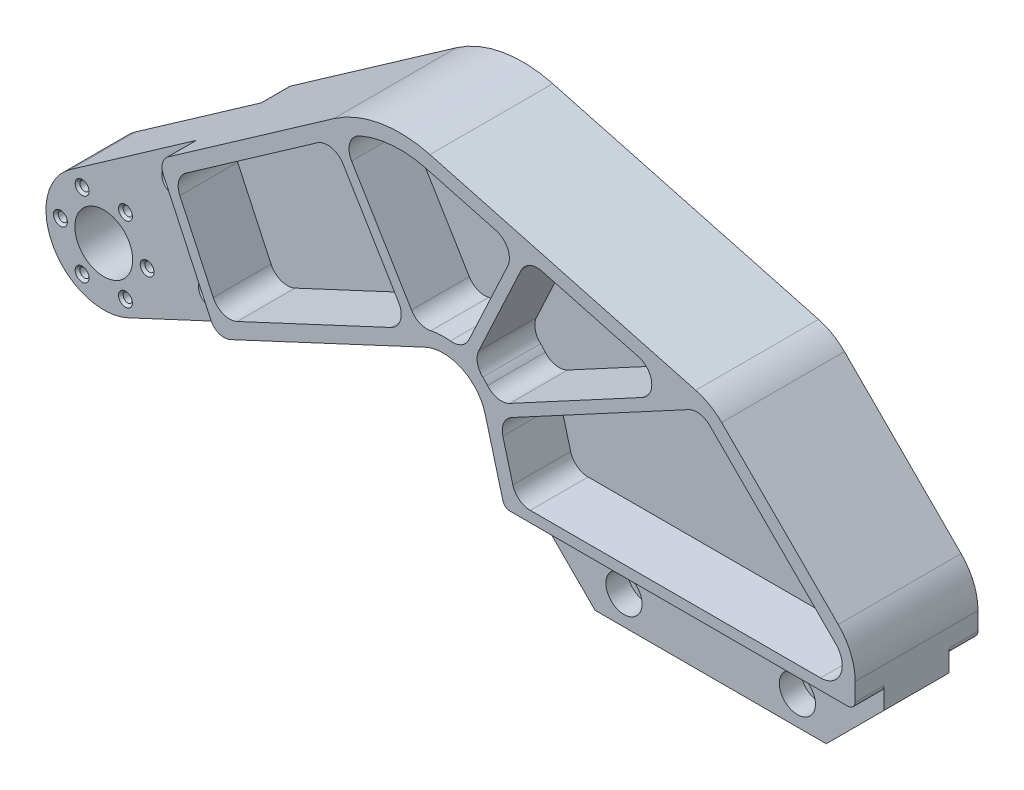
ISO-10303-21;
HEADER;
FILE_DESCRIPTION(('STEP AP214'),'2;1');
FILE_NAME('part.step','',(''),(''),'','','');
FILE_SCHEMA(('AUTOMOTIVE_DESIGN { 1 0 10303 214 1 1 1 1 }'));
ENDSEC;
DATA;
#1=APPLICATION_CONTEXT('core data for automotive mechanical design processes');
#2=APPLICATION_PROTOCOL_DEFINITION('international standard','automotive_design',2000,#1);
#3=PRODUCT_CONTEXT('',#1,'mechanical');
#4=PRODUCT('Part','Part','',(#3));
#5=PRODUCT_RELATED_PRODUCT_CATEGORY('part','',(#4));
#6=PRODUCT_DEFINITION_FORMATION('','',#4);
#7=PRODUCT_DEFINITION_CONTEXT('part definition',#1,'design');
#8=PRODUCT_DEFINITION('design','',#6,#7);
#9=PRODUCT_DEFINITION_SHAPE('','',#8);
#10=(LENGTH_UNIT() NAMED_UNIT(*) SI_UNIT(.MILLI.,.METRE.));
#11=(NAMED_UNIT(*) PLANE_ANGLE_UNIT() SI_UNIT($,.RADIAN.));
#12=(NAMED_UNIT(*) SI_UNIT($,.STERADIAN.) SOLID_ANGLE_UNIT());
#13=UNCERTAINTY_MEASURE_WITH_UNIT(LENGTH_MEASURE(1.E-05),#10,'distance_accuracy_value','');
#14=(GEOMETRIC_REPRESENTATION_CONTEXT(3) GLOBAL_UNCERTAINTY_ASSIGNED_CONTEXT((#13)) GLOBAL_UNIT_ASSIGNED_CONTEXT((#10,
#11,#12)) REPRESENTATION_CONTEXT('',''));
#15=CARTESIAN_POINT('',(0.,0.,0.));
#16=DIRECTION('',(0.,0.,1.));
#17=DIRECTION('',(1.,0.,0.));
#18=AXIS2_PLACEMENT_3D('',#15,#16,#17);
#19=CARTESIAN_POINT('',(156.256603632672,-55.5625,28.575));
#20=DIRECTION('',(0.,0.,1.));
#21=DIRECTION('',(1.,0.,0.));
#22=AXIS2_PLACEMENT_3D('',#19,#20,#21);
#23=PLANE('',#22);
#24=DIRECTION('',(-0.517109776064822,0.855919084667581,0.));
#25=VECTOR('',#24,1.);
#26=CARTESIAN_POINT('',(-20.2595038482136,-20.3680631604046,28.575));
#27=LINE('',#26,#25);
#28=CARTESIAN_POINT('',(-23.5354084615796,-14.9457922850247,28.575));
#29=VERTEX_POINT('',#28);
#30=CARTESIAN_POINT('',(-49.8441993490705,28.6004666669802,28.575));
#31=VERTEX_POINT('',#30);
#32=EDGE_CURVE('E585',#29,#31,#27,.T.);
#33=ORIENTED_EDGE('',*,*,#32,.F.);
#34=CARTESIAN_POINT('',(-16.7415507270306,-10.8412334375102,28.575));
#35=DIRECTION('',(0.,0.,1.));
#36=DIRECTION('',(1.,0.,0.));
#37=AXIS2_PLACEMENT_3D('',#34,#35,#36);
#38=CIRCLE('',#37,7.9375);
#39=CARTESIAN_POINT('',(-15.0233243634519,-18.5905304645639,28.575));
#40=VERTEX_POINT('',#39);
#41=EDGE_CURVE('E1717',#29,#40,#38,.T.);
#42=ORIENTED_EDGE('',*,*,#41,.T.);
#43=CARTESIAN_POINT('',(-9.525,-43.3882809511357,28.575));
#44=DIRECTION('',(0.,0.,-1.));
#45=DIRECTION('',(1.,0.,0.));
#46=AXIS2_PLACEMENT_3D('',#43,#44,#45);
#47=CIRCLE('',#46,25.4);
#48=CARTESIAN_POINT('',(-6.44295497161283,-18.1759625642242,28.575));
#49=VERTEX_POINT('',#48);
#50=EDGE_CURVE('E989',#40,#49,#47,.T.);
#51=ORIENTED_EDGE('',*,*,#50,.T.);
#52=CARTESIAN_POINT('',(-5.47981590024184,-10.2971130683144,28.575));
#53=DIRECTION('',(0.,0.,1.));
#54=DIRECTION('',(1.,0.,0.));
#55=AXIS2_PLACEMENT_3D('',#52,#53,#54);
#56=CIRCLE('',#55,7.9375);
#57=CARTESIAN_POINT('',(1.71400215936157,-13.6516455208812,28.575));
#58=VERTEX_POINT('',#57);
#59=EDGE_CURVE('E642',#49,#58,#56,.T.);
#60=ORIENTED_EDGE('',*,*,#59,.T.);
#61=DIRECTION('',(-0.422618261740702,-0.906307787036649,0.));
#62=VECTOR('',#61,1.);
#63=CARTESIAN_POINT('',(-0.995918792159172,-19.4630897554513,28.575));
#64=LINE('',#63,#62);
#65=CARTESIAN_POINT('',(18.748001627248,22.8778842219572,28.575));
#66=VERTEX_POINT('',#65);
#67=EDGE_CURVE('E655',#66,#58,#64,.T.);
#68=ORIENTED_EDGE('',*,*,#67,.F.);
#69=CARTESIAN_POINT('',(11.5541835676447,26.2324166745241,28.575));
#70=DIRECTION('',(0.,0.,1.));
#71=DIRECTION('',(1.,0.,0.));
#72=AXIS2_PLACEMENT_3D('',#69,#70,#71);
#73=CIRCLE('',#72,7.9375);
#74=CARTESIAN_POINT('',(13.6085597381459,33.8994529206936,28.575));
#75=VERTEX_POINT('',#74);
#76=EDGE_CURVE('E646',#66,#75,#73,.T.);
#77=ORIENTED_EDGE('',*,*,#76,.T.);
#78=DIRECTION('',(-0.965925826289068,0.258819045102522,0.));
#79=VECTOR('',#78,1.);
#80=CARTESIAN_POINT('',(102.197746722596,10.1620518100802,28.575));
#81=LINE('',#80,#79);
#82=CARTESIAN_POINT('',(-17.0704934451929,42.1198804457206,28.575));
#83=VERTEX_POINT('',#82);
#84=EDGE_CURVE('E902',#75,#83,#81,.T.);
#85=ORIENTED_EDGE('',*,*,#84,.T.);
#86=CARTESIAN_POINT('',(-28.575,-0.815522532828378,28.575));
#87=DIRECTION('',(0.,0.,1.));
#88=DIRECTION('',(1.,0.,0.));
#89=AXIS2_PLACEMENT_3D('',#86,#87,#88);
#90=CIRCLE('',#89,44.45);
#91=CARTESIAN_POINT('',(-46.1971550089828,39.9921011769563,28.575));
#92=VERTEX_POINT('',#91);
#93=EDGE_CURVE('E911',#83,#92,#90,.T.);
#94=ORIENTED_EDGE('',*,*,#93,.T.);
#95=CARTESIAN_POINT('',(-43.0503416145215,32.7050255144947,28.575));
#96=DIRECTION('',(0.,0.,1.));
#97=DIRECTION('',(1.,0.,0.));
#98=AXIS2_PLACEMENT_3D('',#95,#96,#97);
#99=CIRCLE('',#98,7.9375);
#100=EDGE_CURVE('E1720',#92,#31,#99,.T.);
#101=ORIENTED_EDGE('',*,*,#100,.T.);
#102=EDGE_LOOP('',(#33,#42,#51,#60,#68,#77,#85,#94,#101));
#103=FACE_BOUND('',#102,.T.);
#104=ADVANCED_FACE('F19',(#103),#23,.T.);
#105=DIRECTION('',(0.422618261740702,0.906307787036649,0.));
#106=VECTOR('',#105,1.);
#107=CARTESIAN_POINT('',(3.32037204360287,-21.4758092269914,28.575));
#108=LINE('',#107,#106);
#109=CARTESIAN_POINT('',(6.03029299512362,-15.6643649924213,28.575));
#110=VERTEX_POINT('',#109);
#111=CARTESIAN_POINT('',(24.6021783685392,24.1631717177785,28.575));
#112=VERTEX_POINT('',#111);
#113=EDGE_CURVE('E662',#110,#112,#108,.T.);
#114=ORIENTED_EDGE('',*,*,#113,.F.);
#115=CARTESIAN_POINT('',(13.224111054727,-19.0188974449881,28.575));
#116=DIRECTION('',(0.,0.,1.));
#117=DIRECTION('',(1.,0.,0.));
#118=AXIS2_PLACEMENT_3D('',#115,#116,#117);
#119=CIRCLE('',#118,7.9375);
#120=CARTESIAN_POINT('',(7.80765604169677,-24.8211316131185,28.575));
#121=VERTEX_POINT('',#120);
#122=EDGE_CURVE('E936',#110,#121,#119,.T.);
#123=ORIENTED_EDGE('',*,*,#122,.T.);
#124=CARTESIAN_POINT('',(9.88318896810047,-27.002854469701,28.575));
#125=VERTEX_POINT('',#124);
#126=EDGE_CURVE('E992',#121,#125,#47,.T.);
#127=ORIENTED_EDGE('',*,*,#126,.T.);
#128=CARTESIAN_POINT('',(15.9482480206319,-21.8824086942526,28.575));
#129=DIRECTION('',(0.,0.,1.));
#130=DIRECTION('',(1.,0.,0.));
#131=AXIS2_PLACEMENT_3D('',#128,#129,#130);
#132=CIRCLE('',#131,7.9375);
#133=CARTESIAN_POINT('',(19.7132058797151,-28.8701836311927,28.575));
#134=VERTEX_POINT('',#133);
#135=EDGE_CURVE('E932',#125,#134,#132,.T.);
#136=ORIENTED_EDGE('',*,*,#135,.T.);
#137=DIRECTION('',(-0.880349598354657,-0.47432539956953,0.));
#138=VECTOR('',#137,1.);
#139=CARTESIAN_POINT('',(13.331170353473,-32.308773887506,28.575));
#140=LINE('',#139,#138);
#141=CARTESIAN_POINT('',(77.8947324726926,2.47756265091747,28.575));
#142=VERTEX_POINT('',#141);
#143=EDGE_CURVE('E943',#142,#134,#140,.T.);
#144=ORIENTED_EDGE('',*,*,#143,.F.);
#145=CARTESIAN_POINT('',(74.1297746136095,9.46533758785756,28.575));
#146=DIRECTION('',(0.,0.,1.));
#147=DIRECTION('',(1.,0.,0.));
#148=AXIS2_PLACEMENT_3D('',#145,#146,#147);
#149=CIRCLE('',#148,7.9375);
#150=CARTESIAN_POINT('',(76.1841507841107,17.132373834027,28.575));
#151=VERTEX_POINT('',#150);
#152=EDGE_CURVE('E926',#142,#151,#149,.T.);
#153=ORIENTED_EDGE('',*,*,#152,.T.);
#154=CARTESIAN_POINT('',(33.850372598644,28.4756755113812,28.575));
#155=VERTEX_POINT('',#154);
#156=EDGE_CURVE('E906',#151,#155,#81,.T.);
#157=ORIENTED_EDGE('',*,*,#156,.T.);
#158=CARTESIAN_POINT('',(31.7959964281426,20.8086392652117,28.575));
#159=DIRECTION('',(0.,0.,1.));
#160=DIRECTION('',(1.,0.,0.));
#161=AXIS2_PLACEMENT_3D('',#158,#159,#160);
#162=CIRCLE('',#161,7.9375);
#163=EDGE_CURVE('E922',#155,#112,#162,.T.);
#164=ORIENTED_EDGE('',*,*,#163,.T.);
#165=EDGE_LOOP('',(#114,#123,#127,#136,#144,#153,#157,#164));
#166=FACE_BOUND('',#165,.T.);
#167=ADVANCED_FACE('F1647',(#166),#23,.T.);
#168=CARTESIAN_POINT('',(-9.525,-43.3882809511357,28.575));
#169=DIRECTION('',(0.,0.,1.));
#170=DIRECTION('',(1.,0.,0.));
#171=AXIS2_PLACEMENT_3D('',#168,#169,#170);
#172=CYLINDRICAL_SURFACE('',#171,25.4);
#173=ORIENTED_EDGE('',*,*,#50,.F.);
#174=DIRECTION('',(0.,0.,1.));
#175=VECTOR('',#174,1.);
#176=CARTESIAN_POINT('',(-15.0233243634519,-18.5905304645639,28.575));
#177=LINE('',#176,#175);
#178=CARTESIAN_POINT('',(-15.0233243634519,-18.5905304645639,53.975));
#179=VERTEX_POINT('',#178);
#180=EDGE_CURVE('E631',#40,#179,#177,.T.);
#181=ORIENTED_EDGE('',*,*,#180,.T.);
#182=CARTESIAN_POINT('',(-9.525,-43.3882809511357,53.975));
#183=DIRECTION('',(0.,0.,-1.));
#184=DIRECTION('',(1.,0.,0.));
#185=AXIS2_PLACEMENT_3D('',#182,#183,#184);
#186=CIRCLE('',#185,25.4);
#187=CARTESIAN_POINT('',(-6.44295497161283,-18.1759625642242,53.975));
#188=VERTEX_POINT('',#187);
#189=EDGE_CURVE('E1844',#179,#188,#186,.T.);
#190=ORIENTED_EDGE('',*,*,#189,.T.);
#191=DIRECTION('',(0.,0.,1.));
#192=VECTOR('',#191,1.);
#193=CARTESIAN_POINT('',(-6.44295497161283,-18.1759625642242,28.575));
#194=LINE('',#193,#192);
#195=EDGE_CURVE('E627',#188,#49,#194,.F.);
#196=ORIENTED_EDGE('',*,*,#195,.T.);
#197=EDGE_LOOP('',(#173,#181,#190,#196));
#198=FACE_BOUND('',#197,.T.);
#199=ADVANCED_FACE('F1653',(#198),#172,.T.);
#200=ORIENTED_EDGE('',*,*,#126,.F.);
#201=DIRECTION('',(0.,0.,1.));
#202=VECTOR('',#201,1.);
#203=CARTESIAN_POINT('',(7.80765604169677,-24.8211316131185,28.575));
#204=LINE('',#203,#202);
#205=CARTESIAN_POINT('',(7.80765604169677,-24.8211316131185,53.975));
#206=VERTEX_POINT('',#205);
#207=EDGE_CURVE('E967',#121,#206,#204,.T.);
#208=ORIENTED_EDGE('',*,*,#207,.T.);
#209=CARTESIAN_POINT('',(9.88318896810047,-27.002854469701,53.975));
#210=VERTEX_POINT('',#209);
#211=EDGE_CURVE('E842',#206,#210,#186,.T.);
#212=ORIENTED_EDGE('',*,*,#211,.T.);
#213=DIRECTION('',(0.,0.,1.));
#214=VECTOR('',#213,1.);
#215=CARTESIAN_POINT('',(9.88318896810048,-27.002854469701,28.575));
#216=LINE('',#215,#214);
#217=EDGE_CURVE('E973',#210,#125,#216,.F.);
#218=ORIENTED_EDGE('',*,*,#217,.T.);
#219=EDGE_LOOP('',(#200,#208,#212,#218));
#220=FACE_BOUND('',#219,.T.);
#221=ADVANCED_FACE('F1855',(#220),#172,.T.);
#222=CARTESIAN_POINT('',(102.197746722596,10.1620518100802,28.575));
#223=DIRECTION('',(0.258819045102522,0.965925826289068,0.));
#224=DIRECTION('',(-0.965925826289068,0.258819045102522,0.));
#225=AXIS2_PLACEMENT_3D('',#222,#223,#224);
#226=PLANE('',#225);
#227=ORIENTED_EDGE('',*,*,#84,.F.);
#228=DIRECTION('',(0.,0.,-1.));
#229=VECTOR('',#228,1.);
#230=CARTESIAN_POINT('',(13.6085597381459,33.8994529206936,53.975));
#231=LINE('',#230,#229);
#232=CARTESIAN_POINT('',(13.6085597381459,33.8994529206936,53.975));
#233=VERTEX_POINT('',#232);
#234=EDGE_CURVE('E1704',#75,#233,#231,.F.);
#235=ORIENTED_EDGE('',*,*,#234,.T.);
#236=DIRECTION('',(-0.965925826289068,0.258819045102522,0.));
#237=VECTOR('',#236,1.);
#238=CARTESIAN_POINT('',(102.197746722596,10.1620518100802,53.975));
#239=LINE('',#238,#237);
#240=CARTESIAN_POINT('',(-17.0704934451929,42.1198804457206,53.975));
#241=VERTEX_POINT('',#240);
#242=EDGE_CURVE('E1777',#233,#241,#239,.T.);
#243=ORIENTED_EDGE('',*,*,#242,.T.);
#244=DIRECTION('',(0.,0.,1.));
#245=VECTOR('',#244,1.);
#246=CARTESIAN_POINT('',(-17.0704934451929,42.1198804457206,28.575));
#247=LINE('',#246,#245);
#248=EDGE_CURVE('E1737',#83,#241,#247,.T.);
#249=ORIENTED_EDGE('',*,*,#248,.F.);
#250=EDGE_LOOP('',(#227,#235,#243,#249));
#251=FACE_BOUND('',#250,.T.);
#252=ADVANCED_FACE('F1679',(#251),#226,.F.);
#253=ORIENTED_EDGE('',*,*,#156,.F.);
#254=DIRECTION('',(0.,0.,-1.));
#255=VECTOR('',#254,1.);
#256=CARTESIAN_POINT('',(76.1841507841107,17.132373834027,53.975));
#257=LINE('',#256,#255);
#258=CARTESIAN_POINT('',(76.1841507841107,17.132373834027,53.975));
#259=VERTEX_POINT('',#258);
#260=EDGE_CURVE('E979',#151,#259,#257,.F.);
#261=ORIENTED_EDGE('',*,*,#260,.T.);
#262=CARTESIAN_POINT('',(33.850372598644,28.4756755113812,53.975));
#263=VERTEX_POINT('',#262);
#264=EDGE_CURVE('E1773',#259,#263,#239,.T.);
#265=ORIENTED_EDGE('',*,*,#264,.T.);
#266=DIRECTION('',(0.,0.,-1.));
#267=VECTOR('',#266,1.);
#268=CARTESIAN_POINT('',(33.850372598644,28.4756755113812,28.575));
#269=LINE('',#268,#267);
#270=EDGE_CURVE('E971',#263,#155,#269,.T.);
#271=ORIENTED_EDGE('',*,*,#270,.T.);
#272=EDGE_LOOP('',(#253,#261,#265,#271));
#273=FACE_BOUND('',#272,.T.);
#274=ADVANCED_FACE('F1672',(#273),#226,.F.);
#275=DIRECTION('',(0.880349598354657,0.47432539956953,0.));
#276=VECTOR('',#275,1.);
#277=CARTESIAN_POINT('',(15.0095159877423,-36.8142772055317,28.575));
#278=LINE('',#277,#276);
#279=CARTESIAN_POINT('',(20.5365059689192,-33.8363787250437,28.575));
#280=VERTEX_POINT('',#279);
#281=CARTESIAN_POINT('',(98.1700331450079,7.9919515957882,28.575));
#282=VERTEX_POINT('',#281);
#283=EDGE_CURVE('E947',#280,#282,#278,.T.);
#284=ORIENTED_EDGE('',*,*,#283,.F.);
#285=CARTESIAN_POINT('',(24.3014638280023,-40.8241536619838,28.575));
#286=DIRECTION('',(0.,0.,1.));
#287=DIRECTION('',(1.,0.,0.));
#288=AXIS2_PLACEMENT_3D('',#285,#286,#287);
#289=CIRCLE('',#288,7.9375);
#290=CARTESIAN_POINT('',(16.6344275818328,-42.8785298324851,28.575));
#291=VERTEX_POINT('',#290);
#292=EDGE_CURVE('E883',#280,#291,#289,.T.);
#293=ORIENTED_EDGE('',*,*,#292,.T.);
#294=DIRECTION('',(0.258819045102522,-0.965925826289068,0.));
#295=VECTOR('',#294,1.);
#296=CARTESIAN_POINT('',(15.0095159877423,-36.8142772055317,28.575));
#297=LINE('',#296,#295);
#298=CARTESIAN_POINT('',(21.0089249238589,-59.2043761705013,28.575));
#299=VERTEX_POINT('',#298);
#300=EDGE_CURVE('E816',#291,#299,#297,.T.);
#301=ORIENTED_EDGE('',*,*,#300,.T.);
#302=CARTESIAN_POINT('',(28.6759611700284,-57.15,28.575));
#303=DIRECTION('',(0.,0.,1.));
#304=DIRECTION('',(1.,0.,0.));
#305=AXIS2_PLACEMENT_3D('',#302,#303,#304);
#306=CIRCLE('',#305,7.9375);
#307=CARTESIAN_POINT('',(28.6759611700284,-65.0875,28.575));
#308=VERTEX_POINT('',#307);
#309=EDGE_CURVE('E796',#299,#308,#306,.T.);
#310=ORIENTED_EDGE('',*,*,#309,.T.);
#311=DIRECTION('',(1.,0.,0.));
#312=VECTOR('',#311,1.);
#313=CARTESIAN_POINT('',(22.5853032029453,-65.0875,28.575));
#314=LINE('',#313,#312);
#315=CARTESIAN_POINT('',(156.256603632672,-65.0875,28.575));
#316=VERTEX_POINT('',#315);
#317=EDGE_CURVE('E811',#308,#316,#314,.T.);
#318=ORIENTED_EDGE('',*,*,#317,.T.);
#319=CARTESIAN_POINT('',(156.256603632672,-55.5625,28.575));
#320=DIRECTION('',(0.,0.,1.));
#321=DIRECTION('',(1.,0.,0.));
#322=AXIS2_PLACEMENT_3D('',#319,#320,#321);
#323=CIRCLE('',#322,9.525);
#324=CARTESIAN_POINT('',(162.991795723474,-48.8273079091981,28.575));
#325=VERTEX_POINT('',#324);
#326=EDGE_CURVE('E903',#316,#325,#323,.T.);
#327=ORIENTED_EDGE('',*,*,#326,.T.);
#328=DIRECTION('',(-0.707106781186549,0.707106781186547,0.));
#329=VECTOR('',#328,1.);
#330=CARTESIAN_POINT('',(162.991795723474,-48.8273079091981,28.575));
#331=LINE('',#330,#329);
#332=CARTESIAN_POINT('',(107.547651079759,6.61683673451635,28.575));
#333=VERTEX_POINT('',#332);
#334=EDGE_CURVE('E898',#325,#333,#331,.T.);
#335=ORIENTED_EDGE('',*,*,#334,.T.);
#336=CARTESIAN_POINT('',(101.934991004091,1.00417665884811,28.575));
#337=DIRECTION('',(0.,0.,1.));
#338=DIRECTION('',(1.,0.,0.));
#339=AXIS2_PLACEMENT_3D('',#336,#337,#338);
#340=CIRCLE('',#339,7.9375);
#341=EDGE_CURVE('E885',#333,#282,#340,.T.);
#342=ORIENTED_EDGE('',*,*,#341,.T.);
#343=EDGE_LOOP('',(#284,#293,#301,#310,#318,#327,#335,#342));
#344=FACE_BOUND('',#343,.T.);
#345=ADVANCED_FACE('F1655',(#344),#23,.T.);
#346=CARTESIAN_POINT('',(-100.09352318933,-57.5952777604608,28.575));
#347=DIRECTION('',(0.422618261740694,-0.906307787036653,0.));
#348=DIRECTION('',(0.906307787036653,0.422618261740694,0.));
#349=AXIS2_PLACEMENT_3D('',#346,#347,#348);
#350=PLANE('',#349);
#351=DIRECTION('',(0.906307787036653,0.422618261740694,0.));
#352=VECTOR('',#351,1.);
#353=CARTESIAN_POINT('',(-100.09352318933,-57.5952777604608,53.975));
#354=LINE('',#353,#352);
#355=CARTESIAN_POINT('',(-100.09352318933,-57.5952777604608,53.975));
#356=VERTEX_POINT('',#355);
#357=CARTESIAN_POINT('',(-32.6096873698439,-26.1270483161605,53.975));
#358=VERTEX_POINT('',#357);
#359=EDGE_CURVE('E835',#356,#358,#354,.T.);
#360=ORIENTED_EDGE('',*,*,#359,.T.);
#361=DIRECTION('',(0.,0.,-1.));
#362=VECTOR('',#361,1.);
#363=CARTESIAN_POINT('',(-32.6096873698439,-26.1270483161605,28.575));
#364=LINE('',#363,#362);
#365=CARTESIAN_POINT('',(-32.6096873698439,-26.1270483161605,28.575));
#366=VERTEX_POINT('',#365);
#367=EDGE_CURVE('E623',#358,#366,#364,.T.);
#368=ORIENTED_EDGE('',*,*,#367,.T.);
#369=DIRECTION('',(0.906307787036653,0.422618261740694,0.));
#370=VECTOR('',#369,1.);
#371=CARTESIAN_POINT('',(-100.09352318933,-57.5952777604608,28.575));
#372=LINE('',#371,#370);
#373=CARTESIAN_POINT('',(-100.09352318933,-57.5952777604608,28.575));
#374=VERTEX_POINT('',#373);
#375=EDGE_CURVE('E997',#374,#366,#372,.T.);
#376=ORIENTED_EDGE('',*,*,#375,.F.);
#377=DIRECTION('',(0.,0.,1.));
#378=VECTOR('',#377,1.);
#379=CARTESIAN_POINT('',(-100.09352318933,-57.5952777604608,28.575));
#380=LINE('',#379,#378);
#381=EDGE_CURVE('E1809',#374,#356,#380,.T.);
#382=ORIENTED_EDGE('',*,*,#381,.T.);
#383=EDGE_LOOP('',(#360,#368,#376,#382));
#384=FACE_BOUND('',#383,.T.);
#385=ADVANCED_FACE('F1667',(#384),#350,.F.);
#386=CARTESIAN_POINT('',(-54.070472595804,35.5957858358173,28.575));
#387=DIRECTION('',(-0.573576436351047,0.819152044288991,0.));
#388=DIRECTION('',(-0.819152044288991,-0.573576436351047,0.));
#389=AXIS2_PLACEMENT_3D('',#386,#387,#388);
#390=PLANE('',#389);
#391=DIRECTION('',(-0.819152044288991,-0.573576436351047,0.));
#392=VECTOR('',#391,1.);
#393=CARTESIAN_POINT('',(-54.070472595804,35.5957858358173,28.575));
#394=LINE('',#393,#392);
#395=CARTESIAN_POINT('',(-64.936239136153,27.987494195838,28.575));
#396=VERTEX_POINT('',#395);
#397=CARTESIAN_POINT('',(-122.671110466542,-12.4388979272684,28.575));
#398=VERTEX_POINT('',#397);
#399=EDGE_CURVE('E2017',#396,#398,#394,.T.);
#400=ORIENTED_EDGE('',*,*,#399,.F.);
#401=DIRECTION('',(0.,0.,-1.));
#402=VECTOR('',#401,1.);
#403=CARTESIAN_POINT('',(-64.936239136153,27.987494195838,53.975));
#404=LINE('',#403,#402);
#405=CARTESIAN_POINT('',(-64.936239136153,27.987494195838,53.975));
#406=VERTEX_POINT('',#405);
#407=EDGE_CURVE('E617',#396,#406,#404,.F.);
#408=ORIENTED_EDGE('',*,*,#407,.T.);
#409=DIRECTION('',(-0.819152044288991,-0.573576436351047,0.));
#410=VECTOR('',#409,1.);
#411=CARTESIAN_POINT('',(-54.070472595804,35.5957858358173,53.975));
#412=LINE('',#411,#410);
#413=CARTESIAN_POINT('',(-122.671110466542,-12.4388979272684,53.975));
#414=VERTEX_POINT('',#413);
#415=EDGE_CURVE('E1781',#406,#414,#412,.T.);
#416=ORIENTED_EDGE('',*,*,#415,.T.);
#417=DIRECTION('',(0.,0.,1.));
#418=VECTOR('',#417,1.);
#419=CARTESIAN_POINT('',(-122.671110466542,-12.4388979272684,28.575));
#420=LINE('',#419,#418);
#421=EDGE_CURVE('E1818',#398,#414,#420,.T.);
#422=ORIENTED_EDGE('',*,*,#421,.F.);
#423=EDGE_LOOP('',(#400,#408,#416,#422));
#424=FACE_BOUND('',#423,.T.);
#425=ADVANCED_FACE('F1660',(#424),#390,.F.);
#426=DIRECTION('',(0.517109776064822,-0.855919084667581,0.));
#427=VECTOR('',#426,1.);
#428=CARTESIAN_POINT('',(-24.6006863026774,-22.3923897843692,28.575));
#429=LINE('',#428,#427);
#430=CARTESIAN_POINT('',(-53.5896184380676,25.5900336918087,28.575));
#431=VERTEX_POINT('',#430);
#432=CARTESIAN_POINT('',(-29.1703620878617,-14.8286714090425,28.575));
#433=VERTEX_POINT('',#432);
#434=EDGE_CURVE('E591',#431,#433,#429,.T.);
#435=ORIENTED_EDGE('',*,*,#434,.F.);
#436=CARTESIAN_POINT('',(-60.3834761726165,21.4854748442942,28.575));
#437=DIRECTION('',(0.,0.,1.));
#438=DIRECTION('',(1.,0.,0.));
#439=AXIS2_PLACEMENT_3D('',#436,#437,#438);
#440=CIRCLE('',#439,7.9375);
#441=EDGE_CURVE('E612',#431,#396,#440,.T.);
#442=ORIENTED_EDGE('',*,*,#441,.T.);
#443=ORIENTED_EDGE('',*,*,#399,.T.);
#444=CARTESIAN_POINT('',(-118.118347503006,-18.9409172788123,28.575));
#445=DIRECTION('',(0.,0.,1.));
#446=DIRECTION('',(-1.,0.,0.));
#447=AXIS2_PLACEMENT_3D('',#444,#445,#446);
#448=CIRCLE('',#447,7.9375);
#449=CARTESIAN_POINT('',(-125.312165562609,-22.295449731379,28.575));
#450=VERTEX_POINT('',#449);
#451=EDGE_CURVE('E2021',#398,#450,#448,.T.);
#452=ORIENTED_EDGE('',*,*,#451,.T.);
#453=DIRECTION('',(0.422618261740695,-0.906307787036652,0.));
#454=VECTOR('',#453,1.);
#455=CARTESIAN_POINT('',(-125.312165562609,-22.295449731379,28.575));
#456=LINE('',#455,#454);
#457=CARTESIAN_POINT('',(-110.6418737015,-53.7559921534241,28.575));
#458=VERTEX_POINT('',#457);
#459=EDGE_CURVE('E2024',#450,#458,#456,.T.);
#460=ORIENTED_EDGE('',*,*,#459,.T.);
#461=CARTESIAN_POINT('',(-103.448055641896,-50.4014597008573,28.575));
#462=DIRECTION('',(0.,0.,1.));
#463=DIRECTION('',(1.,0.,0.));
#464=AXIS2_PLACEMENT_3D('',#461,#462,#463);
#465=CIRCLE('',#464,7.9375);
#466=EDGE_CURVE('E1005',#458,#374,#465,.T.);
#467=ORIENTED_EDGE('',*,*,#466,.T.);
#468=ORIENTED_EDGE('',*,*,#375,.T.);
#469=CARTESIAN_POINT('',(-35.9642198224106,-18.933230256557,28.575));
#470=DIRECTION('',(0.,0.,1.));
#471=DIRECTION('',(1.,0.,0.));
#472=AXIS2_PLACEMENT_3D('',#469,#470,#471);
#473=CIRCLE('',#472,7.9375);
#474=EDGE_CURVE('E618',#366,#433,#473,.T.);
#475=ORIENTED_EDGE('',*,*,#474,.T.);
#476=EDGE_LOOP('',(#435,#442,#443,#452,#460,#467,#468,#475));
#477=FACE_BOUND('',#476,.T.);
#478=ADVANCED_FACE('F1649',(#477),#23,.T.);
#479=CARTESIAN_POINT('',(-28.575,-0.815522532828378,0.));
#480=DIRECTION('',(0.,0.,-1.));
#481=DIRECTION('',(-1.,0.,0.));
#482=AXIS2_PLACEMENT_3D('',#479,#480,#481);
#483=PLANE('',#482);
#484=DIRECTION('',(1.,0.,0.));
#485=VECTOR('',#484,1.);
#486=CARTESIAN_POINT('',(22.5853032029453,-65.0875,0.));
#487=LINE('',#486,#485);
#488=CARTESIAN_POINT('',(22.5853032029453,-65.0875,0.));
#489=VERTEX_POINT('',#488);
#490=CARTESIAN_POINT('',(156.256603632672,-65.0875,0.));
#491=VERTEX_POINT('',#490);
#492=EDGE_CURVE('E1015',#489,#491,#487,.T.);
#493=ORIENTED_EDGE('',*,*,#492,.T.);
#494=CARTESIAN_POINT('',(156.256603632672,-55.5625,0.));
#495=DIRECTION('',(0.,0.,1.));
#496=DIRECTION('',(1.,0.,0.));
#497=AXIS2_PLACEMENT_3D('',#494,#495,#496);
#498=CIRCLE('',#497,9.525);
#499=CARTESIAN_POINT('',(162.991795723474,-48.8273079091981,0.));
#500=VERTEX_POINT('',#499);
#501=EDGE_CURVE('E1022',#491,#500,#498,.T.);
#502=ORIENTED_EDGE('',*,*,#501,.T.);
#503=DIRECTION('',(-0.707106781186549,0.707106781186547,0.));
#504=VECTOR('',#503,1.);
#505=CARTESIAN_POINT('',(162.991795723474,-48.8273079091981,0.));
#506=LINE('',#505,#504);
#507=CARTESIAN_POINT('',(106.467687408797,7.69680040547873,0.));
#508=VERTEX_POINT('',#507);
#509=EDGE_CURVE('E1046',#500,#508,#506,.T.);
#510=ORIENTED_EDGE('',*,*,#509,.T.);
#511=CARTESIAN_POINT('',(99.732495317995,0.961608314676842,0.));
#512=DIRECTION('',(0.,0.,1.));
#513=DIRECTION('',(1.,0.,0.));
#514=AXIS2_PLACEMENT_3D('',#511,#512,#513);
#515=CIRCLE('',#514,9.525);
#516=CARTESIAN_POINT('',(102.197746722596,10.1620518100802,0.));
#517=VERTEX_POINT('',#516);
#518=EDGE_CURVE('E1132',#508,#517,#515,.T.);
#519=ORIENTED_EDGE('',*,*,#518,.T.);
#520=DIRECTION('',(-0.965925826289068,0.258819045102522,0.));
#521=VECTOR('',#520,1.);
#522=CARTESIAN_POINT('',(102.197746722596,10.1620518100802,0.));
#523=LINE('',#522,#521);
#524=CARTESIAN_POINT('',(-17.0704934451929,42.1198804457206,0.));
#525=VERTEX_POINT('',#524);
#526=EDGE_CURVE('E1138',#517,#525,#523,.T.);
#527=ORIENTED_EDGE('',*,*,#526,.T.);
#528=CARTESIAN_POINT('',(-28.575,-0.815522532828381,0.));
#529=DIRECTION('',(0.,0.,1.));
#530=DIRECTION('',(1.,0.,0.));
#531=AXIS2_PLACEMENT_3D('',#528,#529,#530);
#532=CIRCLE('',#531,44.45);
#533=CARTESIAN_POINT('',(-54.070472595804,35.5957858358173,0.));
#534=VERTEX_POINT('',#533);
#535=EDGE_CURVE('E1143',#525,#534,#532,.T.);
#536=ORIENTED_EDGE('',*,*,#535,.T.);
#537=DIRECTION('',(-0.819152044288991,-0.573576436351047,0.));
#538=VECTOR('',#537,1.);
#539=CARTESIAN_POINT('',(-54.070472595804,35.5957858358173,0.));
#540=LINE('',#539,#538);
#541=CARTESIAN_POINT('',(-122.671110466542,-12.4388979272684,0.));
#542=VERTEX_POINT('',#541);
#543=EDGE_CURVE('E1147',#534,#542,#540,.T.);
#544=ORIENTED_EDGE('',*,*,#543,.T.);
#545=CARTESIAN_POINT('',(-118.118347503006,-18.9409172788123,0.));
#546=DIRECTION('',(0.,0.,1.));
#547=DIRECTION('',(-1.,0.,0.));
#548=AXIS2_PLACEMENT_3D('',#545,#546,#547);
#549=CIRCLE('',#548,7.9375);
#550=CARTESIAN_POINT('',(-125.312165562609,-22.295449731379,0.));
#551=VERTEX_POINT('',#550);
#552=EDGE_CURVE('E1157',#542,#551,#549,.T.);
#553=ORIENTED_EDGE('',*,*,#552,.T.);
#554=DIRECTION('',(0.422618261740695,-0.906307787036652,0.));
#555=VECTOR('',#554,1.);
#556=CARTESIAN_POINT('',(-125.312165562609,-22.295449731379,0.));
#557=LINE('',#556,#555);
#558=CARTESIAN_POINT('',(-110.6418737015,-53.7559921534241,0.));
#559=VERTEX_POINT('',#558);
#560=EDGE_CURVE('E1162',#551,#559,#557,.T.);
#561=ORIENTED_EDGE('',*,*,#560,.T.);
#562=CARTESIAN_POINT('',(-103.448055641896,-50.4014597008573,0.));
#563=DIRECTION('',(0.,0.,1.));
#564=DIRECTION('',(1.,0.,0.));
#565=AXIS2_PLACEMENT_3D('',#562,#563,#564);
#566=CIRCLE('',#565,7.9375);
#567=CARTESIAN_POINT('',(-100.09352318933,-57.5952777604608,0.));
#568=VERTEX_POINT('',#567);
#569=EDGE_CURVE('E1166',#559,#568,#566,.T.);
#570=ORIENTED_EDGE('',*,*,#569,.T.);
#571=DIRECTION('',(0.906307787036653,0.422618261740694,0.));
#572=VECTOR('',#571,1.);
#573=CARTESIAN_POINT('',(-100.09352318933,-57.5952777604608,0.));
#574=LINE('',#573,#572);
#575=CARTESIAN_POINT('',(-20.2595038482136,-20.3680631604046,0.));
#576=VERTEX_POINT('',#575);
#577=EDGE_CURVE('E1170',#568,#576,#574,.T.);
#578=ORIENTED_EDGE('',*,*,#577,.T.);
#579=CARTESIAN_POINT('',(-9.525,-43.3882809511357,0.));
#580=DIRECTION('',(0.,0.,-1.));
#581=DIRECTION('',(1.,0.,0.));
#582=AXIS2_PLACEMENT_3D('',#579,#580,#581);
#583=CIRCLE('',#582,25.4);
#584=CARTESIAN_POINT('',(15.0095159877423,-36.8142772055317,0.));
#585=VERTEX_POINT('',#584);
#586=EDGE_CURVE('E1029',#576,#585,#583,.T.);
#587=ORIENTED_EDGE('',*,*,#586,.T.);
#588=DIRECTION('',(0.258819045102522,-0.965925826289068,0.));
#589=VECTOR('',#588,1.);
#590=CARTESIAN_POINT('',(15.0095159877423,-36.8142772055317,0.));
#591=LINE('',#590,#589);
#592=EDGE_CURVE('E1021',#585,#489,#591,.T.);
#593=ORIENTED_EDGE('',*,*,#592,.T.);
#594=EDGE_LOOP('',(#493,#502,#510,#519,#527,#536,#544,#553,#561,#570,#578,#587,#593));
#595=FACE_BOUND('',#594,.T.);
#596=DIRECTION('',(-0.965925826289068,0.258819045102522,0.));
#597=VECTOR('',#596,1.);
#598=CARTESIAN_POINT('',(-15.4269925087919,48.2535094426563,0.));
#599=LINE('',#598,#597);
#600=CARTESIAN_POINT('',(101.375996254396,16.9562429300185,0.));
#601=VERTEX_POINT('',#600);
#602=CARTESIAN_POINT('',(-15.4269925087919,48.2535094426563,0.));
#603=VERTEX_POINT('',#602);
#604=EDGE_CURVE('E714',#601,#603,#599,.T.);
#605=ORIENTED_EDGE('',*,*,#604,.F.);
#606=CARTESIAN_POINT('',(94.8019925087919,-7.57827305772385,0.));
#607=DIRECTION('',(0.,0.,-1.));
#608=DIRECTION('',(-1.,0.,0.));
#609=AXIS2_PLACEMENT_3D('',#606,#607,#608);
#610=CIRCLE('',#609,25.4);
#611=CARTESIAN_POINT('',(112.76250475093,10.3822391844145,0.));
#612=VERTEX_POINT('',#611);
#613=EDGE_CURVE('E1257',#601,#612,#610,.T.);
#614=ORIENTED_EDGE('',*,*,#613,.T.);
#615=DIRECTION('',(-0.707106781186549,0.707106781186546,0.));
#616=VECTOR('',#615,1.);
#617=CARTESIAN_POINT('',(171.45,-48.3052560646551,0.));
#618=LINE('',#617,#616);
#619=CARTESIAN_POINT('',(164.010512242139,-40.8657683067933,0.));
#620=VERTEX_POINT('',#619);
#621=EDGE_CURVE('E1297',#620,#612,#618,.T.);
#622=ORIENTED_EDGE('',*,*,#621,.F.);
#623=CARTESIAN_POINT('',(146.05,-58.8262805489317,0.));
#624=DIRECTION('',(0.,0.,-1.));
#625=DIRECTION('',(-1.,0.,0.));
#626=AXIS2_PLACEMENT_3D('',#623,#624,#625);
#627=CIRCLE('',#626,25.4);
#628=CARTESIAN_POINT('',(171.45,-58.8262805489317,0.));
#629=VERTEX_POINT('',#628);
#630=EDGE_CURVE('E1254',#620,#629,#627,.T.);
#631=ORIENTED_EDGE('',*,*,#630,.T.);
#632=DIRECTION('',(0.,1.,0.));
#633=VECTOR('',#632,1.);
#634=CARTESIAN_POINT('',(171.45,-76.2,0.));
#635=LINE('',#634,#633);
#636=CARTESIAN_POINT('',(171.45,-66.675,0.));
#637=VERTEX_POINT('',#636);
#638=EDGE_CURVE('E1283',#637,#629,#635,.T.);
#639=ORIENTED_EDGE('',*,*,#638,.F.);
#640=CARTESIAN_POINT('',(168.275,-66.675,0.));
#641=DIRECTION('',(0.,0.,-1.));
#642=DIRECTION('',(-1.,0.,0.));
#643=AXIS2_PLACEMENT_3D('',#640,#641,#642);
#644=CIRCLE('',#643,3.175);
#645=CARTESIAN_POINT('',(168.275,-69.85,0.));
#646=VERTEX_POINT('',#645);
#647=EDGE_CURVE('E1467',#637,#646,#644,.T.);
#648=ORIENTED_EDGE('',*,*,#647,.T.);
#649=DIRECTION('',(-1.,0.,0.));
#650=VECTOR('',#649,1.);
#651=CARTESIAN_POINT('',(171.45,-69.85,0.));
#652=LINE('',#651,#650);
#653=CARTESIAN_POINT('',(17.2874074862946,-69.85,0.));
#654=VERTEX_POINT('',#653);
#655=EDGE_CURVE('E1425',#646,#654,#652,.T.);
#656=ORIENTED_EDGE('',*,*,#655,.T.);
#657=DIRECTION('',(0.258819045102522,-0.965925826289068,0.));
#658=VECTOR('',#657,1.);
#659=CARTESIAN_POINT('',(8.87588699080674,-38.4577781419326,0.));
#660=LINE('',#659,#658);
#661=CARTESIAN_POINT('',(8.87588699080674,-38.4577781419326,0.));
#662=VERTEX_POINT('',#661);
#663=EDGE_CURVE('E1290',#662,#654,#660,.T.);
#664=ORIENTED_EDGE('',*,*,#663,.F.);
#665=CARTESIAN_POINT('',(-9.525,-43.3882809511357,0.));
#666=DIRECTION('',(0.,0.,-1.));
#667=DIRECTION('',(-1.,0.,0.));
#668=AXIS2_PLACEMENT_3D('',#665,#666,#667);
#669=CIRCLE('',#668,19.05);
#670=CARTESIAN_POINT('',(-17.5758778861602,-26.1231176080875,0.));
#671=VERTEX_POINT('',#670);
#672=EDGE_CURVE('E1423',#671,#662,#669,.T.);
#673=ORIENTED_EDGE('',*,*,#672,.F.);
#674=DIRECTION('',(0.906307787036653,0.422618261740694,0.));
#675=VECTOR('',#674,1.);
#676=CARTESIAN_POINT('',(-17.5758778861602,-26.1231176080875,0.));
#677=LINE('',#676,#675);
#678=CARTESIAN_POINT('',(-103.164951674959,-66.0339581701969,0.));
#679=VERTEX_POINT('',#678);
#680=EDGE_CURVE('E721',#679,#671,#677,.T.);
#681=ORIENTED_EDGE('',*,*,#680,.F.);
#682=CARTESIAN_POINT('',(-105.848577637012,-60.2789037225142,0.));
#683=DIRECTION('',(0.,0.,-1.));
#684=DIRECTION('',(-1.,0.,0.));
#685=AXIS2_PLACEMENT_3D('',#682,#683,#684);
#686=CIRCLE('',#685,6.35);
#687=CARTESIAN_POINT('',(-111.603632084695,-62.9625296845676,0.));
#688=VERTEX_POINT('',#687);
#689=EDGE_CURVE('E1350',#679,#688,#686,.T.);
#690=ORIENTED_EDGE('',*,*,#689,.T.);
#691=DIRECTION('',(-0.422618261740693,0.906307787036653,0.));
#692=VECTOR('',#691,1.);
#693=CARTESIAN_POINT('',(-134.813371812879,-13.1890822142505,0.));
#694=LINE('',#693,#692);
#695=CARTESIAN_POINT('',(-132.561542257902,-18.0181462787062,0.));
#696=VERTEX_POINT('',#695);
#697=EDGE_CURVE('E690',#688,#696,#694,.T.);
#698=ORIENTED_EDGE('',*,*,#697,.T.);
#699=CARTESIAN_POINT('',(-126.80648781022,-15.3345203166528,0.));
#700=DIRECTION('',(0.,0.,-1.));
#701=DIRECTION('',(-1.,0.,0.));
#702=AXIS2_PLACEMENT_3D('',#699,#700,#701);
#703=CIRCLE('',#702,6.35);
#704=CARTESIAN_POINT('',(-130.448698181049,-10.1329048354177,0.));
#705=VERTEX_POINT('',#704);
#706=EDGE_CURVE('E1343',#696,#705,#703,.T.);
#707=ORIENTED_EDGE('',*,*,#706,.T.);
#708=DIRECTION('',(-0.819152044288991,-0.573576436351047,0.));
#709=VECTOR('',#708,1.);
#710=CARTESIAN_POINT('',(-186.018841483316,-49.0435380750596,0.));
#711=LINE('',#710,#709);
#712=CARTESIAN_POINT('',(-57.7126829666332,40.7974013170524,0.));
#713=VERTEX_POINT('',#712);
#714=EDGE_CURVE('E713',#713,#705,#711,.T.);
#715=ORIENTED_EDGE('',*,*,#714,.F.);
#716=CARTESIAN_POINT('',(-28.575,-0.815522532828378,0.));
#717=DIRECTION('',(0.,0.,1.));
#718=DIRECTION('',(-1.,0.,0.));
#719=AXIS2_PLACEMENT_3D('',#716,#717,#718);
#720=CIRCLE('',#719,50.8);
#721=EDGE_CURVE('E708',#603,#713,#720,.T.);
#722=ORIENTED_EDGE('',*,*,#721,.F.);
#723=EDGE_LOOP('',(#605,#614,#622,#631,#639,#648,#656,#664,#673,#681,#690,#698,#707,#715,#722));
#724=FACE_BOUND('',#723,.T.);
#725=ADVANCED_FACE('F1179',(#595,#724),#483,.T.);
#726=CARTESIAN_POINT('',(171.45,-76.2,53.975));
#727=DIRECTION('',(-1.,0.,0.));
#728=DIRECTION('',(0.,0.,1.));
#729=AXIS2_PLACEMENT_3D('',#726,#727,#728);
#730=PLANE('',#729);
#731=ORIENTED_EDGE('',*,*,#638,.T.);
#732=DIRECTION('',(0.,0.,-1.));
#733=VECTOR('',#732,1.);
#734=CARTESIAN_POINT('',(171.45,-58.8262805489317,53.975));
#735=LINE('',#734,#733);
#736=CARTESIAN_POINT('',(171.45,-58.8262805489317,53.975));
#737=VERTEX_POINT('',#736);
#738=EDGE_CURVE('E792',#629,#737,#735,.F.);
#739=ORIENTED_EDGE('',*,*,#738,.T.);
#740=DIRECTION('',(0.,1.,0.));
#741=VECTOR('',#740,1.);
#742=CARTESIAN_POINT('',(171.45,-76.2,53.975));
#743=LINE('',#742,#741);
#744=CARTESIAN_POINT('',(171.45,-66.675,53.975));
#745=VERTEX_POINT('',#744);
#746=EDGE_CURVE('E738',#745,#737,#743,.T.);
#747=ORIENTED_EDGE('',*,*,#746,.F.);
#748=DIRECTION('',(0.,0.,1.));
#749=VECTOR('',#748,1.);
#750=CARTESIAN_POINT('',(171.45,-66.675,53.975));
#751=LINE('',#750,#749);
#752=CARTESIAN_POINT('',(171.45,-66.675,41.275));
#753=VERTEX_POINT('',#752);
#754=EDGE_CURVE('E1457',#745,#753,#751,.F.);
#755=ORIENTED_EDGE('',*,*,#754,.T.);
#756=DIRECTION('',(0.,1.,0.));
#757=VECTOR('',#756,1.);
#758=CARTESIAN_POINT('',(171.45,-69.85,41.275));
#759=LINE('',#758,#757);
#760=CARTESIAN_POINT('',(171.45,-76.2,41.275));
#761=VERTEX_POINT('',#760);
#762=EDGE_CURVE('E1450',#761,#753,#759,.T.);
#763=ORIENTED_EDGE('',*,*,#762,.F.);
#764=DIRECTION('',(0.,0.,-1.));
#765=VECTOR('',#764,1.);
#766=CARTESIAN_POINT('',(171.45,-76.2,53.975));
#767=LINE('',#766,#765);
#768=CARTESIAN_POINT('',(171.45,-76.2,12.7));
#769=VERTEX_POINT('',#768);
#770=EDGE_CURVE('E1395',#761,#769,#767,.T.);
#771=ORIENTED_EDGE('',*,*,#770,.T.);
#772=DIRECTION('',(0.,1.,0.));
#773=VECTOR('',#772,1.);
#774=CARTESIAN_POINT('',(171.45,-69.85,12.7));
#775=LINE('',#774,#773);
#776=CARTESIAN_POINT('',(171.45,-66.675,12.7));
#777=VERTEX_POINT('',#776);
#778=EDGE_CURVE('E1593',#769,#777,#775,.T.);
#779=ORIENTED_EDGE('',*,*,#778,.T.);
#780=DIRECTION('',(0.,0.,-1.));
#781=VECTOR('',#780,1.);
#782=CARTESIAN_POINT('',(171.45,-66.675,0.));
#783=LINE('',#782,#781);
#784=EDGE_CURVE('E1461',#777,#637,#783,.T.);
#785=ORIENTED_EDGE('',*,*,#784,.T.);
#786=EDGE_LOOP('',(#731,#739,#747,#755,#763,#771,#779,#785));
#787=FACE_BOUND('',#786,.T.);
#788=ADVANCED_FACE('F1278',(#787),#730,.F.);
#789=CARTESIAN_POINT('',(8.87588699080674,-38.4577781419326,53.975));
#790=DIRECTION('',(0.965925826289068,0.258819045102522,0.));
#791=DIRECTION('',(-0.258819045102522,0.965925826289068,0.));
#792=AXIS2_PLACEMENT_3D('',#789,#790,#791);
#793=PLANE('',#792);
#794=DIRECTION('',(0.258819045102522,-0.965925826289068,0.));
#795=VECTOR('',#794,1.);
#796=CARTESIAN_POINT('',(8.87588699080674,-38.4577781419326,12.7));
#797=LINE('',#796,#795);
#798=CARTESIAN_POINT('',(17.2874074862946,-69.85,12.7));
#799=VERTEX_POINT('',#798);
#800=CARTESIAN_POINT('',(18.0857656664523,-72.8295132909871,12.7));
#801=VERTEX_POINT('',#800);
#802=EDGE_CURVE('E1561',#799,#801,#797,.T.);
#803=ORIENTED_EDGE('',*,*,#802,.T.);
#804=DIRECTION('',(0.,0.,-1.));
#805=VECTOR('',#804,1.);
#806=CARTESIAN_POINT('',(18.0857656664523,-72.8295132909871,53.975));
#807=LINE('',#806,#805);
#808=CARTESIAN_POINT('',(18.0857656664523,-72.8295132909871,41.275));
#809=VERTEX_POINT('',#808);
#810=EDGE_CURVE('E1496',#801,#809,#807,.F.);
#811=ORIENTED_EDGE('',*,*,#810,.T.);
#812=DIRECTION('',(-0.258819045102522,0.965925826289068,0.));
#813=VECTOR('',#812,1.);
#814=CARTESIAN_POINT('',(8.87588699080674,-38.4577781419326,41.275));
#815=LINE('',#814,#813);
#816=CARTESIAN_POINT('',(16.6568561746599,-67.4967504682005,41.275));
#817=VERTEX_POINT('',#816);
#818=EDGE_CURVE('E1533',#809,#817,#815,.T.);
#819=ORIENTED_EDGE('',*,*,#818,.T.);
#820=DIRECTION('',(0.,0.,1.));
#821=VECTOR('',#820,1.);
#822=CARTESIAN_POINT('',(16.6568561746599,-67.4967504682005,53.975));
#823=LINE('',#822,#821);
#824=CARTESIAN_POINT('',(16.6568561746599,-67.4967504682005,53.975));
#825=VERTEX_POINT('',#824);
#826=EDGE_CURVE('E766',#817,#825,#823,.T.);
#827=ORIENTED_EDGE('',*,*,#826,.T.);
#828=DIRECTION('',(0.258819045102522,-0.965925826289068,0.));
#829=VECTOR('',#828,1.);
#830=CARTESIAN_POINT('',(8.87588699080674,-38.4577781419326,53.975));
#831=LINE('',#830,#829);
#832=CARTESIAN_POINT('',(8.87588699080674,-38.4577781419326,53.975));
#833=VERTEX_POINT('',#832);
#834=EDGE_CURVE('E1307',#833,#825,#831,.T.);
#835=ORIENTED_EDGE('',*,*,#834,.F.);
#836=DIRECTION('',(0.,0.,-1.));
#837=VECTOR('',#836,1.);
#838=CARTESIAN_POINT('',(8.87588699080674,-38.4577781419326,53.975));
#839=LINE('',#838,#837);
#840=EDGE_CURVE('E1389',#833,#662,#839,.T.);
#841=ORIENTED_EDGE('',*,*,#840,.T.);
#842=ORIENTED_EDGE('',*,*,#663,.T.);
#843=DIRECTION('',(0.,0.,-1.));
#844=VECTOR('',#843,1.);
#845=CARTESIAN_POINT('',(17.2874074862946,-69.85,12.7));
#846=LINE('',#845,#844);
#847=EDGE_CURVE('E1566',#799,#654,#846,.T.);
#848=ORIENTED_EDGE('',*,*,#847,.F.);
#849=EDGE_LOOP('',(#803,#811,#819,#827,#835,#841,#842,#848));
#850=FACE_BOUND('',#849,.T.);
#851=ADVANCED_FACE('F1417',(#850),#793,.F.);
#852=CARTESIAN_POINT('',(-171.45,-69.85,53.975));
#853=DIRECTION('',(0.,0.,-1.));
#854=DIRECTION('',(-1.,0.,0.));
#855=AXIS2_PLACEMENT_3D('',#852,#853,#854);
#856=CYLINDRICAL_SURFACE('',#855,25.4);
#857=CARTESIAN_POINT('',(-171.45,-69.85,12.7));
#858=DIRECTION('',(0.,0.,1.));
#859=DIRECTION('',(1.,0.,0.));
#860=AXIS2_PLACEMENT_3D('',#857,#858,#859);
#861=CIRCLE('',#860,25.4);
#862=CARTESIAN_POINT('',(-186.018841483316,-49.0435380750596,12.7));
#863=VERTEX_POINT('',#862);
#864=CARTESIAN_POINT('',(-160.715496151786,-92.8702177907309,12.7));
#865=VERTEX_POINT('',#864);
#866=EDGE_CURVE('E680',#863,#865,#861,.T.);
#867=ORIENTED_EDGE('',*,*,#866,.T.);
#868=DIRECTION('',(0.,0.,-1.));
#869=VECTOR('',#868,1.);
#870=CARTESIAN_POINT('',(-160.715496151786,-92.8702177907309,53.975));
#871=LINE('',#870,#869);
#872=CARTESIAN_POINT('',(-160.715496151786,-92.8702177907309,41.275));
#873=VERTEX_POINT('',#872);
#874=EDGE_CURVE('E1380',#873,#865,#871,.T.);
#875=ORIENTED_EDGE('',*,*,#874,.F.);
#876=CARTESIAN_POINT('',(-171.45,-69.85,41.275));
#877=DIRECTION('',(0.,0.,1.));
#878=DIRECTION('',(1.,0.,0.));
#879=AXIS2_PLACEMENT_3D('',#876,#877,#878);
#880=CIRCLE('',#879,25.4);
#881=CARTESIAN_POINT('',(-186.018841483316,-49.0435380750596,41.275));
#882=VERTEX_POINT('',#881);
#883=EDGE_CURVE('E1210',#882,#873,#880,.T.);
#884=ORIENTED_EDGE('',*,*,#883,.F.);
#885=DIRECTION('',(0.,0.,-1.));
#886=VECTOR('',#885,1.);
#887=CARTESIAN_POINT('',(-186.018841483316,-49.0435380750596,53.975));
#888=LINE('',#887,#886);
#889=EDGE_CURVE('E1336',#882,#863,#888,.T.);
#890=ORIENTED_EDGE('',*,*,#889,.T.);
#891=EDGE_LOOP('',(#867,#875,#884,#890));
#892=FACE_BOUND('',#891,.T.);
#893=ADVANCED_FACE('F1382',(#892),#856,.T.);
#894=CARTESIAN_POINT('',(-171.45,-69.85,53.975));
#895=DIRECTION('',(0.,0.,-1.));
#896=DIRECTION('',(-1.,0.,0.));
#897=AXIS2_PLACEMENT_3D('',#894,#895,#896);
#898=CYLINDRICAL_SURFACE('',#897,12.7);
#899=CARTESIAN_POINT('',(-171.45,-69.85,41.275));
#900=DIRECTION('',(0.,0.,1.));
#901=DIRECTION('',(1.,0.,0.));
#902=AXIS2_PLACEMENT_3D('',#899,#900,#901);
#903=CIRCLE('',#902,12.7);
#904=CARTESIAN_POINT('',(-158.75,-69.85,41.275));
#905=VERTEX_POINT('',#904);
#906=EDGE_CURVE('E760',#905,#905,#903,.T.);
#907=ORIENTED_EDGE('',*,*,#906,.T.);
#908=EDGE_LOOP('',(#907));
#909=FACE_BOUND('',#908,.T.);
#910=CARTESIAN_POINT('',(-171.45,-69.85,12.7));
#911=DIRECTION('',(0.,0.,-1.));
#912=DIRECTION('',(0.,1.,0.));
#913=AXIS2_PLACEMENT_3D('',#910,#911,#912);
#914=CIRCLE('',#913,12.7);
#915=CARTESIAN_POINT('',(-171.45,-57.15,12.7));
#916=VERTEX_POINT('',#915);
#917=EDGE_CURVE('E686',#916,#916,#914,.T.);
#918=ORIENTED_EDGE('',*,*,#917,.T.);
#919=EDGE_LOOP('',(#918));
#920=FACE_BOUND('',#919,.T.);
#921=ADVANCED_FACE('F1948',(#909,#920),#898,.F.);
#922=CARTESIAN_POINT('',(-186.018841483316,-49.0435380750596,53.975));
#923=DIRECTION('',(0.573576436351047,-0.819152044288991,0.));
#924=DIRECTION('',(0.819152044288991,0.573576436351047,0.));
#925=AXIS2_PLACEMENT_3D('',#922,#923,#924);
#926=PLANE('',#925);
#927=ORIENTED_EDGE('',*,*,#714,.T.);
#928=DIRECTION('',(0.,0.,-1.));
#929=VECTOR('',#928,1.);
#930=CARTESIAN_POINT('',(-130.448698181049,-10.1329048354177,12.7));
#931=LINE('',#930,#929);
#932=CARTESIAN_POINT('',(-130.448698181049,-10.1329048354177,12.7));
#933=VERTEX_POINT('',#932);
#934=EDGE_CURVE('E1342',#705,#933,#931,.F.);
#935=ORIENTED_EDGE('',*,*,#934,.T.);
#936=DIRECTION('',(-0.819152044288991,-0.573576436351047,0.));
#937=VECTOR('',#936,1.);
#938=CARTESIAN_POINT('',(-134.813371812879,-13.1890822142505,12.7));
#939=LINE('',#938,#937);
#940=EDGE_CURVE('E694',#933,#863,#939,.T.);
#941=ORIENTED_EDGE('',*,*,#940,.T.);
#942=ORIENTED_EDGE('',*,*,#889,.F.);
#943=DIRECTION('',(-0.819152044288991,-0.573576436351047,0.));
#944=VECTOR('',#943,1.);
#945=CARTESIAN_POINT('',(-134.813371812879,-13.1890822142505,41.275));
#946=LINE('',#945,#944);
#947=CARTESIAN_POINT('',(-130.448698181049,-10.1329048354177,41.275));
#948=VERTEX_POINT('',#947);
#949=EDGE_CURVE('E701',#948,#882,#946,.T.);
#950=ORIENTED_EDGE('',*,*,#949,.F.);
#951=DIRECTION('',(0.,0.,1.));
#952=VECTOR('',#951,1.);
#953=CARTESIAN_POINT('',(-130.448698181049,-10.1329048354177,53.975));
#954=LINE('',#953,#952);
#955=CARTESIAN_POINT('',(-130.448698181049,-10.1329048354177,53.975));
#956=VERTEX_POINT('',#955);
#957=EDGE_CURVE('E1339',#948,#956,#954,.T.);
#958=ORIENTED_EDGE('',*,*,#957,.T.);
#959=DIRECTION('',(-0.819152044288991,-0.573576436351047,0.));
#960=VECTOR('',#959,1.);
#961=CARTESIAN_POINT('',(-186.018841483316,-49.0435380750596,53.975));
#962=LINE('',#961,#960);
#963=CARTESIAN_POINT('',(-57.7126829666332,40.7974013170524,53.975));
#964=VERTEX_POINT('',#963);
#965=EDGE_CURVE('E1317',#964,#956,#962,.T.);
#966=ORIENTED_EDGE('',*,*,#965,.F.);
#967=DIRECTION('',(0.,0.,-1.));
#968=VECTOR('',#967,1.);
#969=CARTESIAN_POINT('',(-57.7126829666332,40.7974013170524,53.975));
#970=LINE('',#969,#968);
#971=EDGE_CURVE('E1329',#964,#713,#970,.T.);
#972=ORIENTED_EDGE('',*,*,#971,.T.);
#973=EDGE_LOOP('',(#927,#935,#941,#942,#950,#958,#966,#972));
#974=FACE_BOUND('',#973,.T.);
#975=ADVANCED_FACE('F1338',(#974),#926,.F.);
#976=CARTESIAN_POINT('',(-17.5758778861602,-26.1231176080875,53.975));
#977=DIRECTION('',(-0.422618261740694,0.906307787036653,0.));
#978=DIRECTION('',(-0.906307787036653,-0.422618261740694,0.));
#979=AXIS2_PLACEMENT_3D('',#976,#977,#978);
#980=PLANE('',#979);
#981=DIRECTION('',(0.906307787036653,0.422618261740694,0.));
#982=VECTOR('',#981,1.);
#983=CARTESIAN_POINT('',(-160.715496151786,-92.8702177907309,12.7));
#984=LINE('',#983,#982);
#985=CARTESIAN_POINT('',(-103.164951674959,-66.0339581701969,12.7));
#986=VERTEX_POINT('',#985);
#987=EDGE_CURVE('E687',#865,#986,#984,.T.);
#988=ORIENTED_EDGE('',*,*,#987,.T.);
#989=DIRECTION('',(0.,0.,-1.));
#990=VECTOR('',#989,1.);
#991=CARTESIAN_POINT('',(-103.164951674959,-66.0339581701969,0.));
#992=LINE('',#991,#990);
#993=EDGE_CURVE('E1357',#986,#679,#992,.T.);
#994=ORIENTED_EDGE('',*,*,#993,.T.);
#995=ORIENTED_EDGE('',*,*,#680,.T.);
#996=DIRECTION('',(0.,0.,-1.));
#997=VECTOR('',#996,1.);
#998=CARTESIAN_POINT('',(-17.5758778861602,-26.1231176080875,53.975));
#999=LINE('',#998,#997);
#1000=CARTESIAN_POINT('',(-17.5758778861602,-26.1231176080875,53.975));
#1001=VERTEX_POINT('',#1000);
#1002=EDGE_CURVE('E1374',#1001,#671,#999,.T.);
#1003=ORIENTED_EDGE('',*,*,#1002,.F.);
#1004=DIRECTION('',(0.906307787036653,0.422618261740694,0.));
#1005=VECTOR('',#1004,1.);
#1006=CARTESIAN_POINT('',(-17.5758778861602,-26.1231176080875,53.975));
#1007=LINE('',#1006,#1005);
#1008=CARTESIAN_POINT('',(-103.164951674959,-66.0339581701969,53.975));
#1009=VERTEX_POINT('',#1008);
#1010=EDGE_CURVE('E1315',#1009,#1001,#1007,.T.);
#1011=ORIENTED_EDGE('',*,*,#1010,.F.);
#1012=DIRECTION('',(0.,0.,1.));
#1013=VECTOR('',#1012,1.);
#1014=CARTESIAN_POINT('',(-103.164951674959,-66.0339581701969,53.975));
#1015=LINE('',#1014,#1013);
#1016=CARTESIAN_POINT('',(-103.164951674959,-66.0339581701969,41.275));
#1017=VERTEX_POINT('',#1016);
#1018=EDGE_CURVE('E1348',#1009,#1017,#1015,.F.);
#1019=ORIENTED_EDGE('',*,*,#1018,.T.);
#1020=DIRECTION('',(0.906307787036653,0.422618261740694,0.));
#1021=VECTOR('',#1020,1.);
#1022=CARTESIAN_POINT('',(-160.715496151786,-92.8702177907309,41.275));
#1023=LINE('',#1022,#1021);
#1024=EDGE_CURVE('E1204',#873,#1017,#1023,.T.);
#1025=ORIENTED_EDGE('',*,*,#1024,.F.);
#1026=ORIENTED_EDGE('',*,*,#874,.T.);
#1027=EDGE_LOOP('',(#988,#994,#995,#1003,#1011,#1019,#1025,#1026));
#1028=FACE_BOUND('',#1027,.T.);
#1029=ADVANCED_FACE('F1371',(#1028),#980,.F.);
#1030=CARTESIAN_POINT('',(-28.575,-0.815522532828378,53.975));
#1031=DIRECTION('',(0.,0.,-1.));
#1032=DIRECTION('',(-1.,0.,0.));
#1033=AXIS2_PLACEMENT_3D('',#1030,#1031,#1032);
#1034=PLANE('',#1033);
#1035=DIRECTION('',(-0.422618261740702,-0.906307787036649,0.));
#1036=VECTOR('',#1035,1.);
#1037=CARTESIAN_POINT('',(3.32037204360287,-21.4758092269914,53.975));
#1038=LINE('',#1037,#1036);
#1039=CARTESIAN_POINT('',(24.6021783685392,24.1631717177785,53.975));
#1040=VERTEX_POINT('',#1039);
#1041=CARTESIAN_POINT('',(6.03029299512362,-15.6643649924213,53.975));
#1042=VERTEX_POINT('',#1041);
#1043=EDGE_CURVE('E669',#1040,#1042,#1038,.T.);
#1044=ORIENTED_EDGE('',*,*,#1043,.F.);
#1045=CARTESIAN_POINT('',(31.7959964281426,20.8086392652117,53.975));
#1046=DIRECTION('',(0.,0.,-1.));
#1047=DIRECTION('',(-1.,0.,0.));
#1048=AXIS2_PLACEMENT_3D('',#1045,#1046,#1047);
#1049=CIRCLE('',#1048,7.9375);
#1050=EDGE_CURVE('E854',#1040,#263,#1049,.T.);
#1051=ORIENTED_EDGE('',*,*,#1050,.T.);
#1052=ORIENTED_EDGE('',*,*,#264,.F.);
#1053=CARTESIAN_POINT('',(74.1297746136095,9.46533758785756,53.975));
#1054=DIRECTION('',(0.,0.,-1.));
#1055=DIRECTION('',(-1.,0.,0.));
#1056=AXIS2_PLACEMENT_3D('',#1053,#1054,#1055);
#1057=CIRCLE('',#1056,7.9375);
#1058=CARTESIAN_POINT('',(77.8947324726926,2.47756265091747,53.975));
#1059=VERTEX_POINT('',#1058);
#1060=EDGE_CURVE('E857',#259,#1059,#1057,.T.);
#1061=ORIENTED_EDGE('',*,*,#1060,.T.);
#1062=DIRECTION('',(0.880349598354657,0.47432539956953,0.));
#1063=VECTOR('',#1062,1.);
#1064=CARTESIAN_POINT('',(13.331170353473,-32.308773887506,53.975));
#1065=LINE('',#1064,#1063);
#1066=CARTESIAN_POINT('',(19.7132058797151,-28.8701836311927,53.975));
#1067=VERTEX_POINT('',#1066);
#1068=EDGE_CURVE('E880',#1067,#1059,#1065,.T.);
#1069=ORIENTED_EDGE('',*,*,#1068,.F.);
#1070=CARTESIAN_POINT('',(15.9482480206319,-21.8824086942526,53.975));
#1071=DIRECTION('',(0.,0.,-1.));
#1072=DIRECTION('',(-1.,0.,0.));
#1073=AXIS2_PLACEMENT_3D('',#1070,#1071,#1072);
#1074=CIRCLE('',#1073,7.9375);
#1075=EDGE_CURVE('E1765',#1067,#210,#1074,.T.);
#1076=ORIENTED_EDGE('',*,*,#1075,.T.);
#1077=ORIENTED_EDGE('',*,*,#211,.F.);
#1078=CARTESIAN_POINT('',(13.224111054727,-19.0188974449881,53.975));
#1079=DIRECTION('',(0.,0.,-1.));
#1080=DIRECTION('',(-1.,0.,0.));
#1081=AXIS2_PLACEMENT_3D('',#1078,#1079,#1080);
#1082=CIRCLE('',#1081,7.9375);
#1083=EDGE_CURVE('E1701',#206,#1042,#1082,.T.);
#1084=ORIENTED_EDGE('',*,*,#1083,.T.);
#1085=EDGE_LOOP('',(#1044,#1051,#1052,#1061,#1069,#1076,#1077,#1084));
#1086=FACE_BOUND('',#1085,.T.);
#1087=ORIENTED_EDGE('',*,*,#242,.F.);
#1088=CARTESIAN_POINT('',(11.5541835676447,26.2324166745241,53.975));
#1089=DIRECTION('',(0.,0.,-1.));
#1090=DIRECTION('',(-1.,0.,0.));
#1091=AXIS2_PLACEMENT_3D('',#1088,#1089,#1090);
#1092=CIRCLE('',#1091,7.9375);
#1093=CARTESIAN_POINT('',(18.748001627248,22.8778842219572,53.975));
#1094=VERTEX_POINT('',#1093);
#1095=EDGE_CURVE('E1742',#233,#1094,#1092,.T.);
#1096=ORIENTED_EDGE('',*,*,#1095,.T.);
#1097=DIRECTION('',(0.422618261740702,0.906307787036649,0.));
#1098=VECTOR('',#1097,1.);
#1099=CARTESIAN_POINT('',(-0.995918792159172,-19.4630897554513,53.975));
#1100=LINE('',#1099,#1098);
#1101=CARTESIAN_POINT('',(1.71400215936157,-13.6516455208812,53.975));
#1102=VERTEX_POINT('',#1101);
#1103=EDGE_CURVE('E661',#1102,#1094,#1100,.T.);
#1104=ORIENTED_EDGE('',*,*,#1103,.F.);
#1105=CARTESIAN_POINT('',(-5.47981590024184,-10.2971130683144,53.975));
#1106=DIRECTION('',(0.,0.,-1.));
#1107=DIRECTION('',(-1.,0.,0.));
#1108=AXIS2_PLACEMENT_3D('',#1105,#1106,#1107);
#1109=CIRCLE('',#1108,7.9375);
#1110=EDGE_CURVE('E1746',#1102,#188,#1109,.T.);
#1111=ORIENTED_EDGE('',*,*,#1110,.T.);
#1112=ORIENTED_EDGE('',*,*,#189,.F.);
#1113=CARTESIAN_POINT('',(-16.7415507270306,-10.8412334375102,53.975));
#1114=DIRECTION('',(0.,0.,-1.));
#1115=DIRECTION('',(-1.,0.,0.));
#1116=AXIS2_PLACEMENT_3D('',#1113,#1114,#1115);
#1117=CIRCLE('',#1116,7.9375);
#1118=CARTESIAN_POINT('',(-23.5354084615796,-14.9457922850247,53.975));
#1119=VERTEX_POINT('',#1118);
#1120=EDGE_CURVE('E1752',#179,#1119,#1117,.T.);
#1121=ORIENTED_EDGE('',*,*,#1120,.T.);
#1122=DIRECTION('',(0.517109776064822,-0.855919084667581,0.));
#1123=VECTOR('',#1122,1.);
#1124=CARTESIAN_POINT('',(-20.2595038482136,-20.3680631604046,53.975));
#1125=LINE('',#1124,#1123);
#1126=CARTESIAN_POINT('',(-49.8441993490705,28.6004666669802,53.975));
#1127=VERTEX_POINT('',#1126);
#1128=EDGE_CURVE('E593',#1127,#1119,#1125,.T.);
#1129=ORIENTED_EDGE('',*,*,#1128,.F.);
#1130=CARTESIAN_POINT('',(-43.0503416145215,32.7050255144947,53.975));
#1131=DIRECTION('',(0.,0.,-1.));
#1132=DIRECTION('',(-1.,0.,0.));
#1133=AXIS2_PLACEMENT_3D('',#1130,#1131,#1132);
#1134=CIRCLE('',#1133,7.9375);
#1135=CARTESIAN_POINT('',(-46.1971550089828,39.9921011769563,53.975));
#1136=VERTEX_POINT('',#1135);
#1137=EDGE_CURVE('E1747',#1127,#1136,#1134,.T.);
#1138=ORIENTED_EDGE('',*,*,#1137,.T.);
#1139=CARTESIAN_POINT('',(-28.575,-0.815522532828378,53.975));
#1140=DIRECTION('',(0.,0.,1.));
#1141=DIRECTION('',(1.,0.,0.));
#1142=AXIS2_PLACEMENT_3D('',#1139,#1140,#1141);
#1143=CIRCLE('',#1142,44.45);
#1144=EDGE_CURVE('E1776',#241,#1136,#1143,.T.);
#1145=ORIENTED_EDGE('',*,*,#1144,.F.);
#1146=EDGE_LOOP('',(#1087,#1096,#1104,#1111,#1112,#1121,#1129,#1138,#1145));
#1147=FACE_BOUND('',#1146,.T.);
#1148=DIRECTION('',(-0.517109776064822,0.855919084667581,0.));
#1149=VECTOR('',#1148,1.);
#1150=CARTESIAN_POINT('',(-24.6006863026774,-22.3923897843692,53.975));
#1151=LINE('',#1150,#1149);
#1152=CARTESIAN_POINT('',(-29.1703620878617,-14.8286714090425,53.975));
#1153=VERTEX_POINT('',#1152);
#1154=CARTESIAN_POINT('',(-53.5896184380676,25.5900336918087,53.975));
#1155=VERTEX_POINT('',#1154);
#1156=EDGE_CURVE('E600',#1153,#1155,#1151,.T.);
#1157=ORIENTED_EDGE('',*,*,#1156,.F.);
#1158=CARTESIAN_POINT('',(-35.9642198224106,-18.933230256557,53.975));
#1159=DIRECTION('',(0.,0.,-1.));
#1160=DIRECTION('',(-1.,0.,0.));
#1161=AXIS2_PLACEMENT_3D('',#1158,#1159,#1160);
#1162=CIRCLE('',#1161,7.9375);
#1163=EDGE_CURVE('E2001',#1153,#358,#1162,.T.);
#1164=ORIENTED_EDGE('',*,*,#1163,.T.);
#1165=ORIENTED_EDGE('',*,*,#359,.F.);
#1166=CARTESIAN_POINT('',(-103.448055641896,-50.4014597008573,53.975));
#1167=DIRECTION('',(0.,0.,1.));
#1168=DIRECTION('',(1.,0.,0.));
#1169=AXIS2_PLACEMENT_3D('',#1166,#1167,#1168);
#1170=CIRCLE('',#1169,7.9375);
#1171=CARTESIAN_POINT('',(-110.6418737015,-53.7559921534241,53.975));
#1172=VERTEX_POINT('',#1171);
#1173=EDGE_CURVE('E831',#1172,#356,#1170,.T.);
#1174=ORIENTED_EDGE('',*,*,#1173,.F.);
#1175=DIRECTION('',(0.422618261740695,-0.906307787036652,0.));
#1176=VECTOR('',#1175,1.);
#1177=CARTESIAN_POINT('',(-125.312165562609,-22.295449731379,53.975));
#1178=LINE('',#1177,#1176);
#1179=CARTESIAN_POINT('',(-125.312165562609,-22.295449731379,53.975));
#1180=VERTEX_POINT('',#1179);
#1181=EDGE_CURVE('E836',#1180,#1172,#1178,.T.);
#1182=ORIENTED_EDGE('',*,*,#1181,.F.);
#1183=CARTESIAN_POINT('',(-118.118347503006,-18.9409172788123,53.975));
#1184=DIRECTION('',(0.,0.,1.));
#1185=DIRECTION('',(-1.,0.,0.));
#1186=AXIS2_PLACEMENT_3D('',#1183,#1184,#1185);
#1187=CIRCLE('',#1186,7.9375);
#1188=EDGE_CURVE('E1787',#414,#1180,#1187,.T.);
#1189=ORIENTED_EDGE('',*,*,#1188,.F.);
#1190=ORIENTED_EDGE('',*,*,#415,.F.);
#1191=CARTESIAN_POINT('',(-60.3834761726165,21.4854748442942,53.975));
#1192=DIRECTION('',(0.,0.,-1.));
#1193=DIRECTION('',(-1.,0.,0.));
#1194=AXIS2_PLACEMENT_3D('',#1191,#1192,#1193);
#1195=CIRCLE('',#1194,7.9375);
#1196=EDGE_CURVE('E2003',#406,#1155,#1195,.T.);
#1197=ORIENTED_EDGE('',*,*,#1196,.T.);
#1198=EDGE_LOOP('',(#1157,#1164,#1165,#1174,#1182,#1189,#1190,#1197));
#1199=FACE_BOUND('',#1198,.T.);
#1200=DIRECTION('',(-0.707106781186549,0.707106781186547,0.));
#1201=VECTOR('',#1200,1.);
#1202=CARTESIAN_POINT('',(162.991795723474,-48.8273079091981,53.975));
#1203=LINE('',#1202,#1201);
#1204=CARTESIAN_POINT('',(162.991795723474,-48.8273079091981,53.975));
#1205=VERTEX_POINT('',#1204);
#1206=CARTESIAN_POINT('',(107.547651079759,6.61683673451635,53.975));
#1207=VERTEX_POINT('',#1206);
#1208=EDGE_CURVE('E822',#1205,#1207,#1203,.T.);
#1209=ORIENTED_EDGE('',*,*,#1208,.F.);
#1210=CARTESIAN_POINT('',(156.256603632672,-55.5625,53.975));
#1211=DIRECTION('',(0.,0.,1.));
#1212=DIRECTION('',(1.,0.,0.));
#1213=AXIS2_PLACEMENT_3D('',#1210,#1211,#1212);
#1214=CIRCLE('',#1213,9.525);
#1215=CARTESIAN_POINT('',(156.256603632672,-65.0875,53.975));
#1216=VERTEX_POINT('',#1215);
#1217=EDGE_CURVE('E818',#1216,#1205,#1214,.T.);
#1218=ORIENTED_EDGE('',*,*,#1217,.F.);
#1219=DIRECTION('',(1.,0.,0.));
#1220=VECTOR('',#1219,1.);
#1221=CARTESIAN_POINT('',(22.5853032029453,-65.0875,53.975));
#1222=LINE('',#1221,#1220);
#1223=CARTESIAN_POINT('',(28.6759611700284,-65.0875,53.975));
#1224=VERTEX_POINT('',#1223);
#1225=EDGE_CURVE('E1834',#1224,#1216,#1222,.T.);
#1226=ORIENTED_EDGE('',*,*,#1225,.F.);
#1227=CARTESIAN_POINT('',(28.6759611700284,-57.15,53.975));
#1228=DIRECTION('',(0.,0.,-1.));
#1229=DIRECTION('',(-1.,0.,0.));
#1230=AXIS2_PLACEMENT_3D('',#1227,#1228,#1229);
#1231=CIRCLE('',#1230,7.9375);
#1232=CARTESIAN_POINT('',(21.0089249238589,-59.2043761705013,53.975));
#1233=VERTEX_POINT('',#1232);
#1234=EDGE_CURVE('E800',#1224,#1233,#1231,.T.);
#1235=ORIENTED_EDGE('',*,*,#1234,.T.);
#1236=DIRECTION('',(0.258819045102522,-0.965925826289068,0.));
#1237=VECTOR('',#1236,1.);
#1238=CARTESIAN_POINT('',(15.0095159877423,-36.8142772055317,53.975));
#1239=LINE('',#1238,#1237);
#1240=CARTESIAN_POINT('',(16.6344275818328,-42.8785298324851,53.975));
#1241=VERTEX_POINT('',#1240);
#1242=EDGE_CURVE('E866',#1241,#1233,#1239,.T.);
#1243=ORIENTED_EDGE('',*,*,#1242,.F.);
#1244=CARTESIAN_POINT('',(24.3014638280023,-40.8241536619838,53.975));
#1245=DIRECTION('',(0.,0.,-1.));
#1246=DIRECTION('',(-1.,0.,0.));
#1247=AXIS2_PLACEMENT_3D('',#1244,#1245,#1246);
#1248=CIRCLE('',#1247,7.9375);
#1249=CARTESIAN_POINT('',(20.5365059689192,-33.8363787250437,53.975));
#1250=VERTEX_POINT('',#1249);
#1251=EDGE_CURVE('E28',#1241,#1250,#1248,.T.);
#1252=ORIENTED_EDGE('',*,*,#1251,.T.);
#1253=DIRECTION('',(-0.880349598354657,-0.474325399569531,0.));
#1254=VECTOR('',#1253,1.);
#1255=CARTESIAN_POINT('',(15.0095159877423,-36.8142772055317,53.975));
#1256=LINE('',#1255,#1254);
#1257=CARTESIAN_POINT('',(98.1700331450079,7.99195159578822,53.975));
#1258=VERTEX_POINT('',#1257);
#1259=EDGE_CURVE('E592',#1258,#1250,#1256,.T.);
#1260=ORIENTED_EDGE('',*,*,#1259,.F.);
#1261=CARTESIAN_POINT('',(101.934991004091,1.00417665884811,53.975));
#1262=DIRECTION('',(0.,0.,-1.));
#1263=DIRECTION('',(-1.,0.,0.));
#1264=AXIS2_PLACEMENT_3D('',#1261,#1262,#1263);
#1265=CIRCLE('',#1264,7.9375);
#1266=EDGE_CURVE('E11',#1258,#1207,#1265,.T.);
#1267=ORIENTED_EDGE('',*,*,#1266,.T.);
#1268=EDGE_LOOP('',(#1209,#1218,#1226,#1235,#1243,#1252,#1260,#1267));
#1269=FACE_BOUND('',#1268,.T.);
#1270=DIRECTION('',(-0.707106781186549,0.707106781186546,0.));
#1271=VECTOR('',#1270,1.);
#1272=CARTESIAN_POINT('',(171.45,-48.3052560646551,53.975));
#1273=LINE('',#1272,#1271);
#1274=CARTESIAN_POINT('',(164.010512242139,-40.8657683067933,53.975));
#1275=VERTEX_POINT('',#1274);
#1276=CARTESIAN_POINT('',(112.76250475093,10.3822391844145,53.975));
#1277=VERTEX_POINT('',#1276);
#1278=EDGE_CURVE('E731',#1275,#1277,#1273,.T.);
#1279=ORIENTED_EDGE('',*,*,#1278,.T.);
#1280=CARTESIAN_POINT('',(94.8019925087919,-7.57827305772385,53.975));
#1281=DIRECTION('',(0.,0.,-1.));
#1282=DIRECTION('',(-1.,0.,0.));
#1283=AXIS2_PLACEMENT_3D('',#1280,#1281,#1282);
#1284=CIRCLE('',#1283,25.4);
#1285=CARTESIAN_POINT('',(101.375996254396,16.9562429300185,53.975));
#1286=VERTEX_POINT('',#1285);
#1287=EDGE_CURVE('E1270',#1277,#1286,#1284,.F.);
#1288=ORIENTED_EDGE('',*,*,#1287,.T.);
#1289=DIRECTION('',(-0.965925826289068,0.258819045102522,0.));
#1290=VECTOR('',#1289,1.);
#1291=CARTESIAN_POINT('',(-15.4269925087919,48.2535094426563,53.975));
#1292=LINE('',#1291,#1290);
#1293=CARTESIAN_POINT('',(-15.4269925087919,48.2535094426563,53.975));
#1294=VERTEX_POINT('',#1293);
#1295=EDGE_CURVE('E737',#1286,#1294,#1292,.T.);
#1296=ORIENTED_EDGE('',*,*,#1295,.T.);
#1297=CARTESIAN_POINT('',(-28.575,-0.815522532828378,53.975));
#1298=DIRECTION('',(0.,0.,1.));
#1299=DIRECTION('',(-1.,0.,0.));
#1300=AXIS2_PLACEMENT_3D('',#1297,#1298,#1299);
#1301=CIRCLE('',#1300,50.8);
#1302=EDGE_CURVE('E743',#1294,#964,#1301,.T.);
#1303=ORIENTED_EDGE('',*,*,#1302,.T.);
#1304=ORIENTED_EDGE('',*,*,#965,.T.);
#1305=CARTESIAN_POINT('',(-126.80648781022,-15.3345203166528,53.975));
#1306=DIRECTION('',(0.,0.,-1.));
#1307=DIRECTION('',(-1.,0.,0.));
#1308=AXIS2_PLACEMENT_3D('',#1305,#1306,#1307);
#1309=CIRCLE('',#1308,6.35);
#1310=CARTESIAN_POINT('',(-132.561542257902,-18.0181462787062,53.975));
#1311=VERTEX_POINT('',#1310);
#1312=EDGE_CURVE('E1229',#956,#1311,#1309,.F.);
#1313=ORIENTED_EDGE('',*,*,#1312,.T.);
#1314=DIRECTION('',(-0.422618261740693,0.906307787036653,0.));
#1315=VECTOR('',#1314,1.);
#1316=CARTESIAN_POINT('',(-134.813371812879,-13.1890822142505,53.975));
#1317=LINE('',#1316,#1315);
#1318=CARTESIAN_POINT('',(-111.603632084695,-62.9625296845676,53.975));
#1319=VERTEX_POINT('',#1318);
#1320=EDGE_CURVE('E700',#1319,#1311,#1317,.T.);
#1321=ORIENTED_EDGE('',*,*,#1320,.F.);
#1322=CARTESIAN_POINT('',(-105.848577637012,-60.2789037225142,53.975));
#1323=DIRECTION('',(0.,0.,-1.));
#1324=DIRECTION('',(-1.,0.,0.));
#1325=AXIS2_PLACEMENT_3D('',#1322,#1323,#1324);
#1326=CIRCLE('',#1325,6.35);
#1327=EDGE_CURVE('E1361',#1319,#1009,#1326,.F.);
#1328=ORIENTED_EDGE('',*,*,#1327,.T.);
#1329=ORIENTED_EDGE('',*,*,#1010,.T.);
#1330=CARTESIAN_POINT('',(-9.525,-43.3882809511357,53.975));
#1331=DIRECTION('',(0.,0.,-1.));
#1332=DIRECTION('',(-1.,0.,0.));
#1333=AXIS2_PLACEMENT_3D('',#1330,#1331,#1332);
#1334=CIRCLE('',#1333,19.05);
#1335=EDGE_CURVE('E1312',#1001,#833,#1334,.T.);
#1336=ORIENTED_EDGE('',*,*,#1335,.T.);
#1337=ORIENTED_EDGE('',*,*,#834,.T.);
#1338=CARTESIAN_POINT('',(19.7236706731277,-66.675,53.975));
#1339=DIRECTION('',(0.,0.,-1.));
#1340=DIRECTION('',(-1.,0.,0.));
#1341=AXIS2_PLACEMENT_3D('',#1338,#1339,#1340);
#1342=CIRCLE('',#1341,3.175);
#1343=CARTESIAN_POINT('',(19.7236706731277,-69.85,53.975));
#1344=VERTEX_POINT('',#1343);
#1345=EDGE_CURVE('E1433',#825,#1344,#1342,.F.);
#1346=ORIENTED_EDGE('',*,*,#1345,.T.);
#1347=DIRECTION('',(-1.,0.,0.));
#1348=VECTOR('',#1347,1.);
#1349=CARTESIAN_POINT('',(171.45,-69.85,53.975));
#1350=LINE('',#1349,#1348);
#1351=CARTESIAN_POINT('',(168.275,-69.85,53.975));
#1352=VERTEX_POINT('',#1351);
#1353=EDGE_CURVE('E1435',#1352,#1344,#1350,.T.);
#1354=ORIENTED_EDGE('',*,*,#1353,.F.);
#1355=CARTESIAN_POINT('',(168.275,-66.675,53.975));
#1356=DIRECTION('',(0.,0.,-1.));
#1357=DIRECTION('',(-1.,0.,0.));
#1358=AXIS2_PLACEMENT_3D('',#1355,#1356,#1357);
#1359=CIRCLE('',#1358,3.175);
#1360=EDGE_CURVE('E1288',#1352,#745,#1359,.F.);
#1361=ORIENTED_EDGE('',*,*,#1360,.T.);
#1362=ORIENTED_EDGE('',*,*,#746,.T.);
#1363=CARTESIAN_POINT('',(146.05,-58.8262805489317,53.975));
#1364=DIRECTION('',(0.,0.,-1.));
#1365=DIRECTION('',(-1.,0.,0.));
#1366=AXIS2_PLACEMENT_3D('',#1363,#1364,#1365);
#1367=CIRCLE('',#1366,25.4);
#1368=EDGE_CURVE('E1267',#737,#1275,#1367,.F.);
#1369=ORIENTED_EDGE('',*,*,#1368,.T.);
#1370=EDGE_LOOP('',(#1279,#1288,#1296,#1303,#1304,#1313,#1321,#1328,#1329,#1336,#1337,#1346,
#1354,#1361,#1362,#1369));
#1371=FACE_BOUND('',#1370,.T.);
#1372=ADVANCED_FACE('F863',(#1086,#1147,#1199,#1269,#1371),#1034,.F.);
#1373=CARTESIAN_POINT('',(44.45,-101.6,53.975));
#1374=DIRECTION('',(0.,1.,0.));
#1375=DIRECTION('',(0.,0.,1.));
#1376=AXIS2_PLACEMENT_3D('',#1373,#1374,#1375);
#1377=PLANE('',#1376);
#1378=DIRECTION('',(0.,0.,-1.));
#1379=VECTOR('',#1378,1.);
#1380=CARTESIAN_POINT('',(44.45,-101.6,53.975));
#1381=LINE('',#1380,#1379);
#1382=CARTESIAN_POINT('',(44.45,-101.6,41.275));
#1383=VERTEX_POINT('',#1382);
#1384=CARTESIAN_POINT('',(44.45,-101.6,12.7));
#1385=VERTEX_POINT('',#1384);
#1386=EDGE_CURVE('E1311',#1383,#1385,#1381,.T.);
#1387=ORIENTED_EDGE('',*,*,#1386,.T.);
#1388=DIRECTION('',(1.,0.,0.));
#1389=VECTOR('',#1388,1.);
#1390=CARTESIAN_POINT('',(44.45,-101.6,12.7));
#1391=LINE('',#1390,#1389);
#1392=CARTESIAN_POINT('',(146.05,-101.6,12.7));
#1393=VERTEX_POINT('',#1392);
#1394=EDGE_CURVE('E1557',#1385,#1393,#1391,.T.);
#1395=ORIENTED_EDGE('',*,*,#1394,.T.);
#1396=DIRECTION('',(0.,0.,-1.));
#1397=VECTOR('',#1396,1.);
#1398=CARTESIAN_POINT('',(146.05,-101.6,53.975));
#1399=LINE('',#1398,#1397);
#1400=CARTESIAN_POINT('',(146.05,-101.6,41.275));
#1401=VERTEX_POINT('',#1400);
#1402=EDGE_CURVE('E759',#1401,#1393,#1399,.T.);
#1403=ORIENTED_EDGE('',*,*,#1402,.F.);
#1404=DIRECTION('',(-1.,0.,0.));
#1405=VECTOR('',#1404,1.);
#1406=CARTESIAN_POINT('',(44.45,-101.6,41.275));
#1407=LINE('',#1406,#1405);
#1408=EDGE_CURVE('E1537',#1401,#1383,#1407,.T.);
#1409=ORIENTED_EDGE('',*,*,#1408,.T.);
#1410=EDGE_LOOP('',(#1387,#1395,#1403,#1409));
#1411=FACE_BOUND('',#1410,.T.);
#1412=ADVANCED_FACE('F1554',(#1411),#1377,.F.);
#1413=CARTESIAN_POINT('',(171.45,-76.2,53.975));
#1414=DIRECTION('',(-0.707106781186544,0.707106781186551,0.));
#1415=DIRECTION('',(-0.707106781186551,-0.707106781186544,0.));
#1416=AXIS2_PLACEMENT_3D('',#1413,#1414,#1415);
#1417=PLANE('',#1416);
#1418=ORIENTED_EDGE('',*,*,#1402,.T.);
#1419=DIRECTION('',(0.707106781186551,0.707106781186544,0.));
#1420=VECTOR('',#1419,1.);
#1421=CARTESIAN_POINT('',(171.45,-76.2,12.7));
#1422=LINE('',#1421,#1420);
#1423=EDGE_CURVE('E1451',#1393,#769,#1422,.T.);
#1424=ORIENTED_EDGE('',*,*,#1423,.T.);
#1425=ORIENTED_EDGE('',*,*,#770,.F.);
#1426=DIRECTION('',(-0.707106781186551,-0.707106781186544,0.));
#1427=VECTOR('',#1426,1.);
#1428=CARTESIAN_POINT('',(171.45,-76.2,41.275));
#1429=LINE('',#1428,#1427);
#1430=EDGE_CURVE('E695',#761,#1401,#1429,.T.);
#1431=ORIENTED_EDGE('',*,*,#1430,.T.);
#1432=EDGE_LOOP('',(#1418,#1424,#1425,#1431));
#1433=FACE_BOUND('',#1432,.T.);
#1434=ADVANCED_FACE('F1548',(#1433),#1417,.F.);
#1435=CARTESIAN_POINT('',(171.45,-48.3052560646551,53.975));
#1436=DIRECTION('',(-0.707106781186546,-0.707106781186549,0.));
#1437=DIRECTION('',(0.707106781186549,-0.707106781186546,0.));
#1438=AXIS2_PLACEMENT_3D('',#1435,#1436,#1437);
#1439=PLANE('',#1438);
#1440=ORIENTED_EDGE('',*,*,#621,.T.);
#1441=DIRECTION('',(0.,0.,-1.));
#1442=VECTOR('',#1441,1.);
#1443=CARTESIAN_POINT('',(112.76250475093,10.3822391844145,53.975));
#1444=LINE('',#1443,#1442);
#1445=EDGE_CURVE('E1264',#612,#1277,#1444,.F.);
#1446=ORIENTED_EDGE('',*,*,#1445,.T.);
#1447=ORIENTED_EDGE('',*,*,#1278,.F.);
#1448=DIRECTION('',(0.,0.,-1.));
#1449=VECTOR('',#1448,1.);
#1450=CARTESIAN_POINT('',(164.010512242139,-40.8657683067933,53.975));
#1451=LINE('',#1450,#1449);
#1452=EDGE_CURVE('E1260',#1275,#620,#1451,.T.);
#1453=ORIENTED_EDGE('',*,*,#1452,.T.);
#1454=EDGE_LOOP('',(#1440,#1446,#1447,#1453));
#1455=FACE_BOUND('',#1454,.T.);
#1456=ADVANCED_FACE('F1296',(#1455),#1439,.F.);
#1457=CARTESIAN_POINT('',(-15.4269925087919,48.2535094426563,53.975));
#1458=DIRECTION('',(-0.258819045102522,-0.965925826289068,0.));
#1459=DIRECTION('',(0.965925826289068,-0.258819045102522,0.));
#1460=AXIS2_PLACEMENT_3D('',#1457,#1458,#1459);
#1461=PLANE('',#1460);
#1462=ORIENTED_EDGE('',*,*,#1295,.F.);
#1463=DIRECTION('',(0.,0.,-1.));
#1464=VECTOR('',#1463,1.);
#1465=CARTESIAN_POINT('',(101.375996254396,16.9562429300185,53.975));
#1466=LINE('',#1465,#1464);
#1467=EDGE_CURVE('E1250',#1286,#601,#1466,.T.);
#1468=ORIENTED_EDGE('',*,*,#1467,.T.);
#1469=ORIENTED_EDGE('',*,*,#604,.T.);
#1470=DIRECTION('',(0.,0.,-1.));
#1471=VECTOR('',#1470,1.);
#1472=CARTESIAN_POINT('',(-15.4269925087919,48.2535094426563,53.975));
#1473=LINE('',#1472,#1471);
#1474=EDGE_CURVE('E1335',#1294,#603,#1473,.T.);
#1475=ORIENTED_EDGE('',*,*,#1474,.F.);
#1476=EDGE_LOOP('',(#1462,#1468,#1469,#1475));
#1477=FACE_BOUND('',#1476,.T.);
#1478=ADVANCED_FACE('F1940',(#1477),#1461,.F.);
#1479=CARTESIAN_POINT('',(-28.575,-0.815522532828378,53.975));
#1480=DIRECTION('',(0.,0.,-1.));
#1481=DIRECTION('',(-1.,0.,0.));
#1482=AXIS2_PLACEMENT_3D('',#1479,#1480,#1481);
#1483=CYLINDRICAL_SURFACE('',#1482,50.8);
#1484=ORIENTED_EDGE('',*,*,#721,.T.);
#1485=ORIENTED_EDGE('',*,*,#971,.F.);
#1486=ORIENTED_EDGE('',*,*,#1302,.F.);
#1487=ORIENTED_EDGE('',*,*,#1474,.T.);
#1488=EDGE_LOOP('',(#1484,#1485,#1486,#1487));
#1489=FACE_BOUND('',#1488,.T.);
#1490=ADVANCED_FACE('F1330',(#1489),#1483,.T.);
#1491=CARTESIAN_POINT('',(-9.525,-43.3882809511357,53.975));
#1492=DIRECTION('',(0.,0.,-1.));
#1493=DIRECTION('',(-1.,0.,0.));
#1494=AXIS2_PLACEMENT_3D('',#1491,#1492,#1493);
#1495=CYLINDRICAL_SURFACE('',#1494,19.05);
#1496=ORIENTED_EDGE('',*,*,#672,.T.);
#1497=ORIENTED_EDGE('',*,*,#840,.F.);
#1498=ORIENTED_EDGE('',*,*,#1335,.F.);
#1499=ORIENTED_EDGE('',*,*,#1002,.T.);
#1500=EDGE_LOOP('',(#1496,#1497,#1498,#1499));
#1501=FACE_BOUND('',#1500,.T.);
#1502=ADVANCED_FACE('F1432',(#1501),#1495,.F.);
#1503=CARTESIAN_POINT('',(18.9665151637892,-76.1165151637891,53.975));
#1504=DIRECTION('',(0.707106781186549,0.707106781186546,0.));
#1505=DIRECTION('',(-0.707106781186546,0.707106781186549,0.));
#1506=AXIS2_PLACEMENT_3D('',#1503,#1504,#1505);
#1507=PLANE('',#1506);
#1508=DIRECTION('',(-0.707106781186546,0.707106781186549,0.));
#1509=VECTOR('',#1508,1.);
#1510=CARTESIAN_POINT('',(18.9665151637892,-76.1165151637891,41.275));
#1511=LINE('',#1510,#1509);
#1512=CARTESIAN_POINT('',(21.3727675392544,-78.5227675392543,41.275));
#1513=VERTEX_POINT('',#1512);
#1514=EDGE_CURVE('E753',#1383,#1513,#1511,.T.);
#1515=ORIENTED_EDGE('',*,*,#1514,.T.);
#1516=DIRECTION('',(0.,0.,-1.));
#1517=VECTOR('',#1516,1.);
#1518=CARTESIAN_POINT('',(21.3727675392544,-78.5227675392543,53.975));
#1519=LINE('',#1518,#1517);
#1520=CARTESIAN_POINT('',(21.3727675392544,-78.5227675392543,12.7));
#1521=VERTEX_POINT('',#1520);
#1522=EDGE_CURVE('E1489',#1513,#1521,#1519,.T.);
#1523=ORIENTED_EDGE('',*,*,#1522,.T.);
#1524=DIRECTION('',(0.707106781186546,-0.707106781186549,0.));
#1525=VECTOR('',#1524,1.);
#1526=CARTESIAN_POINT('',(18.9665151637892,-76.1165151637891,12.7));
#1527=LINE('',#1526,#1525);
#1528=EDGE_CURVE('E758',#1521,#1385,#1527,.T.);
#1529=ORIENTED_EDGE('',*,*,#1528,.T.);
#1530=ORIENTED_EDGE('',*,*,#1386,.F.);
#1531=EDGE_LOOP('',(#1515,#1523,#1529,#1530));
#1532=FACE_BOUND('',#1531,.T.);
#1533=ADVANCED_FACE('F1585',(#1532),#1507,.F.);
#1534=CARTESIAN_POINT('',(156.256603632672,-55.5625,28.575));
#1535=DIRECTION('',(0.,0.,1.));
#1536=DIRECTION('',(1.,0.,0.));
#1537=AXIS2_PLACEMENT_3D('',#1534,#1535,#1536);
#1538=CYLINDRICAL_SURFACE('',#1537,9.525);
#1539=ORIENTED_EDGE('',*,*,#1217,.T.);
#1540=DIRECTION('',(0.,0.,1.));
#1541=VECTOR('',#1540,1.);
#1542=CARTESIAN_POINT('',(162.991795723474,-48.8273079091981,28.575));
#1543=LINE('',#1542,#1541);
#1544=EDGE_CURVE('E815',#325,#1205,#1543,.T.);
#1545=ORIENTED_EDGE('',*,*,#1544,.F.);
#1546=ORIENTED_EDGE('',*,*,#326,.F.);
#1547=DIRECTION('',(0.,0.,1.));
#1548=VECTOR('',#1547,1.);
#1549=CARTESIAN_POINT('',(156.256603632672,-65.0875,28.575));
#1550=LINE('',#1549,#1548);
#1551=EDGE_CURVE('E1303',#316,#1216,#1550,.T.);
#1552=ORIENTED_EDGE('',*,*,#1551,.T.);
#1553=EDGE_LOOP('',(#1539,#1545,#1546,#1552));
#1554=FACE_BOUND('',#1553,.T.);
#1555=ADVANCED_FACE('F1836',(#1554),#1538,.F.);
#1556=CARTESIAN_POINT('',(22.5853032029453,-65.0875,28.575));
#1557=DIRECTION('',(0.,-1.,0.));
#1558=DIRECTION('',(0.,0.,-1.));
#1559=AXIS2_PLACEMENT_3D('',#1556,#1557,#1558);
#1560=PLANE('',#1559);
#1561=ORIENTED_EDGE('',*,*,#317,.F.);
#1562=DIRECTION('',(0.,0.,1.));
#1563=VECTOR('',#1562,1.);
#1564=CARTESIAN_POINT('',(28.6759611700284,-65.0875,53.975));
#1565=LINE('',#1564,#1563);
#1566=EDGE_CURVE('E787',#308,#1224,#1565,.T.);
#1567=ORIENTED_EDGE('',*,*,#1566,.T.);
#1568=ORIENTED_EDGE('',*,*,#1225,.T.);
#1569=ORIENTED_EDGE('',*,*,#1551,.F.);
#1570=EDGE_LOOP('',(#1561,#1567,#1568,#1569));
#1571=FACE_BOUND('',#1570,.T.);
#1572=ADVANCED_FACE('F1965',(#1571),#1560,.F.);
#1573=CARTESIAN_POINT('',(15.0095159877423,-36.8142772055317,28.575));
#1574=DIRECTION('',(-0.965925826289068,-0.258819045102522,0.));
#1575=DIRECTION('',(0.258819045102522,-0.965925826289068,0.));
#1576=AXIS2_PLACEMENT_3D('',#1573,#1574,#1575);
#1577=PLANE('',#1576);
#1578=ORIENTED_EDGE('',*,*,#300,.F.);
#1579=DIRECTION('',(0.,0.,1.));
#1580=VECTOR('',#1579,1.);
#1581=CARTESIAN_POINT('',(16.6344275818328,-42.8785298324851,53.975));
#1582=LINE('',#1581,#1580);
#1583=EDGE_CURVE('E890',#291,#1241,#1582,.T.);
#1584=ORIENTED_EDGE('',*,*,#1583,.T.);
#1585=ORIENTED_EDGE('',*,*,#1242,.T.);
#1586=DIRECTION('',(0.,0.,1.));
#1587=VECTOR('',#1586,1.);
#1588=CARTESIAN_POINT('',(21.0089249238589,-59.2043761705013,28.575));
#1589=LINE('',#1588,#1587);
#1590=EDGE_CURVE('E791',#1233,#299,#1589,.F.);
#1591=ORIENTED_EDGE('',*,*,#1590,.T.);
#1592=EDGE_LOOP('',(#1578,#1584,#1585,#1591));
#1593=FACE_BOUND('',#1592,.T.);
#1594=ADVANCED_FACE('F984',(#1593),#1577,.F.);
#1595=CARTESIAN_POINT('',(-103.448055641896,-50.4014597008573,28.575));
#1596=DIRECTION('',(0.,0.,1.));
#1597=DIRECTION('',(1.,0.,0.));
#1598=AXIS2_PLACEMENT_3D('',#1595,#1596,#1597);
#1599=CYLINDRICAL_SURFACE('',#1598,7.9375);
#1600=ORIENTED_EDGE('',*,*,#1173,.T.);
#1601=ORIENTED_EDGE('',*,*,#381,.F.);
#1602=ORIENTED_EDGE('',*,*,#466,.F.);
#1603=DIRECTION('',(0.,0.,1.));
#1604=VECTOR('',#1603,1.);
#1605=CARTESIAN_POINT('',(-110.6418737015,-53.7559921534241,28.575));
#1606=LINE('',#1605,#1604);
#1607=EDGE_CURVE('E1801',#458,#1172,#1606,.T.);
#1608=ORIENTED_EDGE('',*,*,#1607,.T.);
#1609=EDGE_LOOP('',(#1600,#1601,#1602,#1608));
#1610=FACE_BOUND('',#1609,.T.);
#1611=ADVANCED_FACE('F1808',(#1610),#1599,.F.);
#1612=CARTESIAN_POINT('',(-125.312165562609,-22.295449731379,28.575));
#1613=DIRECTION('',(-0.906307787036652,-0.422618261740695,0.));
#1614=DIRECTION('',(0.422618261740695,-0.906307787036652,0.));
#1615=AXIS2_PLACEMENT_3D('',#1612,#1613,#1614);
#1616=PLANE('',#1615);
#1617=ORIENTED_EDGE('',*,*,#1181,.T.);
#1618=ORIENTED_EDGE('',*,*,#1607,.F.);
#1619=ORIENTED_EDGE('',*,*,#459,.F.);
#1620=DIRECTION('',(0.,0.,1.));
#1621=VECTOR('',#1620,1.);
#1622=CARTESIAN_POINT('',(-125.312165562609,-22.295449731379,28.575));
#1623=LINE('',#1622,#1621);
#1624=EDGE_CURVE('E1803',#450,#1180,#1623,.T.);
#1625=ORIENTED_EDGE('',*,*,#1624,.T.);
#1626=EDGE_LOOP('',(#1617,#1618,#1619,#1625));
#1627=FACE_BOUND('',#1626,.T.);
#1628=ADVANCED_FACE('F1799',(#1627),#1616,.F.);
#1629=CARTESIAN_POINT('',(-118.118347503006,-18.9409172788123,28.575));
#1630=DIRECTION('',(0.,0.,1.));
#1631=DIRECTION('',(1.,0.,0.));
#1632=AXIS2_PLACEMENT_3D('',#1629,#1630,#1631);
#1633=CYLINDRICAL_SURFACE('',#1632,7.9375);
#1634=ORIENTED_EDGE('',*,*,#1188,.T.);
#1635=ORIENTED_EDGE('',*,*,#1624,.F.);
#1636=ORIENTED_EDGE('',*,*,#451,.F.);
#1637=ORIENTED_EDGE('',*,*,#421,.T.);
#1638=EDGE_LOOP('',(#1634,#1635,#1636,#1637));
#1639=FACE_BOUND('',#1638,.T.);
#1640=ADVANCED_FACE('F1972',(#1639),#1633,.F.);
#1641=CARTESIAN_POINT('',(-28.575,-0.815522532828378,28.575));
#1642=DIRECTION('',(0.,0.,1.));
#1643=DIRECTION('',(1.,0.,0.));
#1644=AXIS2_PLACEMENT_3D('',#1641,#1642,#1643);
#1645=CYLINDRICAL_SURFACE('',#1644,44.45);
#1646=ORIENTED_EDGE('',*,*,#1144,.T.);
#1647=DIRECTION('',(0.,0.,1.));
#1648=VECTOR('',#1647,1.);
#1649=CARTESIAN_POINT('',(-46.1971550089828,39.9921011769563,28.575));
#1650=LINE('',#1649,#1648);
#1651=EDGE_CURVE('E1715',#1136,#92,#1650,.F.);
#1652=ORIENTED_EDGE('',*,*,#1651,.T.);
#1653=ORIENTED_EDGE('',*,*,#93,.F.);
#1654=ORIENTED_EDGE('',*,*,#248,.T.);
#1655=EDGE_LOOP('',(#1646,#1652,#1653,#1654));
#1656=FACE_BOUND('',#1655,.T.);
#1657=ADVANCED_FACE('F1968',(#1656),#1645,.F.);
#1658=CARTESIAN_POINT('',(162.991795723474,-48.8273079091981,28.575));
#1659=DIRECTION('',(0.707106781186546,0.707106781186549,0.));
#1660=DIRECTION('',(-0.707106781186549,0.707106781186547,0.));
#1661=AXIS2_PLACEMENT_3D('',#1658,#1659,#1660);
#1662=PLANE('',#1661);
#1663=ORIENTED_EDGE('',*,*,#1208,.T.);
#1664=DIRECTION('',(0.,0.,1.));
#1665=VECTOR('',#1664,1.);
#1666=CARTESIAN_POINT('',(107.547651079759,6.61683673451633,28.575));
#1667=LINE('',#1666,#1665);
#1668=EDGE_CURVE('E40',#1207,#333,#1667,.F.);
#1669=ORIENTED_EDGE('',*,*,#1668,.T.);
#1670=ORIENTED_EDGE('',*,*,#334,.F.);
#1671=ORIENTED_EDGE('',*,*,#1544,.T.);
#1672=EDGE_LOOP('',(#1663,#1669,#1670,#1671));
#1673=FACE_BOUND('',#1672,.T.);
#1674=ADVANCED_FACE('F1827',(#1673),#1662,.F.);
#1675=CARTESIAN_POINT('',(156.256603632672,-55.5625,25.4));
#1676=DIRECTION('',(0.,0.,-1.));
#1677=DIRECTION('',(0.,1.,0.));
#1678=AXIS2_PLACEMENT_3D('',#1675,#1676,#1677);
#1679=CYLINDRICAL_SURFACE('',#1678,9.525);
#1680=ORIENTED_EDGE('',*,*,#501,.F.);
#1681=DIRECTION('',(0.,0.,-1.));
#1682=VECTOR('',#1681,1.);
#1683=CARTESIAN_POINT('',(156.256603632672,-65.0875,25.4));
#1684=LINE('',#1683,#1682);
#1685=CARTESIAN_POINT('',(156.256603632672,-65.0875,25.4));
#1686=VERTEX_POINT('',#1685);
#1687=EDGE_CURVE('E1082',#1686,#491,#1684,.T.);
#1688=ORIENTED_EDGE('',*,*,#1687,.F.);
#1689=CARTESIAN_POINT('',(156.256603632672,-55.5625,25.4));
#1690=DIRECTION('',(0.,0.,1.));
#1691=DIRECTION('',(1.,0.,0.));
#1692=AXIS2_PLACEMENT_3D('',#1689,#1690,#1691);
#1693=CIRCLE('',#1692,9.525);
#1694=CARTESIAN_POINT('',(162.991795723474,-48.8273079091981,25.4));
#1695=VERTEX_POINT('',#1694);
#1696=EDGE_CURVE('E1040',#1686,#1695,#1693,.T.);
#1697=ORIENTED_EDGE('',*,*,#1696,.T.);
#1698=DIRECTION('',(0.,0.,-1.));
#1699=VECTOR('',#1698,1.);
#1700=CARTESIAN_POINT('',(162.991795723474,-48.8273079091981,25.4));
#1701=LINE('',#1700,#1699);
#1702=EDGE_CURVE('E823',#1695,#500,#1701,.T.);
#1703=ORIENTED_EDGE('',*,*,#1702,.T.);
#1704=EDGE_LOOP('',(#1680,#1688,#1697,#1703));
#1705=FACE_BOUND('',#1704,.T.);
#1706=ADVANCED_FACE('F1967',(#1705),#1679,.F.);
#1707=CARTESIAN_POINT('',(162.991795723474,-48.8273079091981,25.4));
#1708=DIRECTION('',(-0.707106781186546,-0.707106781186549,0.));
#1709=DIRECTION('',(0.707106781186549,-0.707106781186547,0.));
#1710=AXIS2_PLACEMENT_3D('',#1707,#1708,#1709);
#1711=PLANE('',#1710);
#1712=ORIENTED_EDGE('',*,*,#509,.F.);
#1713=ORIENTED_EDGE('',*,*,#1702,.F.);
#1714=DIRECTION('',(-0.707106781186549,0.707106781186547,0.));
#1715=VECTOR('',#1714,1.);
#1716=CARTESIAN_POINT('',(162.991795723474,-48.8273079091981,25.4));
#1717=LINE('',#1716,#1715);
#1718=CARTESIAN_POINT('',(106.467687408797,7.69680040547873,25.4));
#1719=VERTEX_POINT('',#1718);
#1720=EDGE_CURVE('E1080',#1695,#1719,#1717,.T.);
#1721=ORIENTED_EDGE('',*,*,#1720,.T.);
#1722=DIRECTION('',(0.,0.,-1.));
#1723=VECTOR('',#1722,1.);
#1724=CARTESIAN_POINT('',(106.467687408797,7.69680040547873,25.4));
#1725=LINE('',#1724,#1723);
#1726=EDGE_CURVE('E1122',#1719,#508,#1725,.T.);
#1727=ORIENTED_EDGE('',*,*,#1726,.T.);
#1728=EDGE_LOOP('',(#1712,#1713,#1721,#1727));
#1729=FACE_BOUND('',#1728,.T.);
#1730=ADVANCED_FACE('F2108',(#1729),#1711,.T.);
#1731=CARTESIAN_POINT('',(99.732495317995,0.961608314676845,25.4));
#1732=DIRECTION('',(0.,0.,-1.));
#1733=DIRECTION('',(0.,1.,0.));
#1734=AXIS2_PLACEMENT_3D('',#1731,#1732,#1733);
#1735=CYLINDRICAL_SURFACE('',#1734,9.525);
#1736=ORIENTED_EDGE('',*,*,#518,.F.);
#1737=ORIENTED_EDGE('',*,*,#1726,.F.);
#1738=CARTESIAN_POINT('',(99.732495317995,0.961608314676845,25.4));
#1739=DIRECTION('',(0.,0.,1.));
#1740=DIRECTION('',(1.,0.,0.));
#1741=AXIS2_PLACEMENT_3D('',#1738,#1739,#1740);
#1742=CIRCLE('',#1741,9.525);
#1743=CARTESIAN_POINT('',(102.197746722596,10.1620518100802,25.4));
#1744=VERTEX_POINT('',#1743);
#1745=EDGE_CURVE('E1078',#1719,#1744,#1742,.T.);
#1746=ORIENTED_EDGE('',*,*,#1745,.T.);
#1747=DIRECTION('',(0.,0.,-1.));
#1748=VECTOR('',#1747,1.);
#1749=CARTESIAN_POINT('',(102.197746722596,10.1620518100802,25.4));
#1750=LINE('',#1749,#1748);
#1751=EDGE_CURVE('E1119',#1744,#517,#1750,.T.);
#1752=ORIENTED_EDGE('',*,*,#1751,.T.);
#1753=EDGE_LOOP('',(#1736,#1737,#1746,#1752));
#1754=FACE_BOUND('',#1753,.T.);
#1755=ADVANCED_FACE('F2111',(#1754),#1735,.F.);
#1756=CARTESIAN_POINT('',(102.197746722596,10.1620518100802,25.4));
#1757=DIRECTION('',(-0.258819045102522,-0.965925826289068,0.));
#1758=DIRECTION('',(0.965925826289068,-0.258819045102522,0.));
#1759=AXIS2_PLACEMENT_3D('',#1756,#1757,#1758);
#1760=PLANE('',#1759);
#1761=ORIENTED_EDGE('',*,*,#526,.F.);
#1762=ORIENTED_EDGE('',*,*,#1751,.F.);
#1763=DIRECTION('',(-0.965925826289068,0.258819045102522,0.));
#1764=VECTOR('',#1763,1.);
#1765=CARTESIAN_POINT('',(102.197746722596,10.1620518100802,25.4));
#1766=LINE('',#1765,#1764);
#1767=CARTESIAN_POINT('',(-17.0704934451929,42.1198804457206,25.4));
#1768=VERTEX_POINT('',#1767);
#1769=EDGE_CURVE('E1075',#1744,#1768,#1766,.T.);
#1770=ORIENTED_EDGE('',*,*,#1769,.T.);
#1771=DIRECTION('',(0.,0.,-1.));
#1772=VECTOR('',#1771,1.);
#1773=CARTESIAN_POINT('',(-17.0704934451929,42.1198804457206,25.4));
#1774=LINE('',#1773,#1772);
#1775=EDGE_CURVE('E1116',#1768,#525,#1774,.T.);
#1776=ORIENTED_EDGE('',*,*,#1775,.T.);
#1777=EDGE_LOOP('',(#1761,#1762,#1770,#1776));
#1778=FACE_BOUND('',#1777,.T.);
#1779=ADVANCED_FACE('F2114',(#1778),#1760,.T.);
#1780=CARTESIAN_POINT('',(-28.575,-0.815522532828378,25.4));
#1781=DIRECTION('',(0.,0.,-1.));
#1782=DIRECTION('',(0.,1.,0.));
#1783=AXIS2_PLACEMENT_3D('',#1780,#1781,#1782);
#1784=CYLINDRICAL_SURFACE('',#1783,44.45);
#1785=ORIENTED_EDGE('',*,*,#535,.F.);
#1786=ORIENTED_EDGE('',*,*,#1775,.F.);
#1787=CARTESIAN_POINT('',(-28.575,-0.815522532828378,25.4));
#1788=DIRECTION('',(0.,0.,1.));
#1789=DIRECTION('',(1.,0.,0.));
#1790=AXIS2_PLACEMENT_3D('',#1787,#1788,#1789);
#1791=CIRCLE('',#1790,44.45);
#1792=CARTESIAN_POINT('',(-54.070472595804,35.5957858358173,25.4));
#1793=VERTEX_POINT('',#1792);
#1794=EDGE_CURVE('E1072',#1768,#1793,#1791,.T.);
#1795=ORIENTED_EDGE('',*,*,#1794,.T.);
#1796=DIRECTION('',(0.,0.,-1.));
#1797=VECTOR('',#1796,1.);
#1798=CARTESIAN_POINT('',(-54.070472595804,35.5957858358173,25.4));
#1799=LINE('',#1798,#1797);
#1800=EDGE_CURVE('E1113',#1793,#534,#1799,.T.);
#1801=ORIENTED_EDGE('',*,*,#1800,.T.);
#1802=EDGE_LOOP('',(#1785,#1786,#1795,#1801));
#1803=FACE_BOUND('',#1802,.T.);
#1804=ADVANCED_FACE('F2118',(#1803),#1784,.F.);
#1805=CARTESIAN_POINT('',(-54.070472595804,35.5957858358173,25.4));
#1806=DIRECTION('',(0.573576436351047,-0.819152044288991,0.));
#1807=DIRECTION('',(0.819152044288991,0.573576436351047,0.));
#1808=AXIS2_PLACEMENT_3D('',#1805,#1806,#1807);
#1809=PLANE('',#1808);
#1810=ORIENTED_EDGE('',*,*,#543,.F.);
#1811=ORIENTED_EDGE('',*,*,#1800,.F.);
#1812=DIRECTION('',(-0.819152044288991,-0.573576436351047,0.));
#1813=VECTOR('',#1812,1.);
#1814=CARTESIAN_POINT('',(-54.070472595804,35.5957858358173,25.4));
#1815=LINE('',#1814,#1813);
#1816=CARTESIAN_POINT('',(-122.671110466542,-12.4388979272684,25.4));
#1817=VERTEX_POINT('',#1816);
#1818=EDGE_CURVE('E1069',#1793,#1817,#1815,.T.);
#1819=ORIENTED_EDGE('',*,*,#1818,.T.);
#1820=DIRECTION('',(0.,0.,-1.));
#1821=VECTOR('',#1820,1.);
#1822=CARTESIAN_POINT('',(-122.671110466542,-12.4388979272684,25.4));
#1823=LINE('',#1822,#1821);
#1824=EDGE_CURVE('E1110',#1817,#542,#1823,.T.);
#1825=ORIENTED_EDGE('',*,*,#1824,.T.);
#1826=EDGE_LOOP('',(#1810,#1811,#1819,#1825));
#1827=FACE_BOUND('',#1826,.T.);
#1828=ADVANCED_FACE('F2122',(#1827),#1809,.T.);
#1829=CARTESIAN_POINT('',(-118.118347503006,-18.9409172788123,25.4));
#1830=DIRECTION('',(0.,0.,-1.));
#1831=DIRECTION('',(0.,1.,0.));
#1832=AXIS2_PLACEMENT_3D('',#1829,#1830,#1831);
#1833=CYLINDRICAL_SURFACE('',#1832,7.9375);
#1834=ORIENTED_EDGE('',*,*,#552,.F.);
#1835=ORIENTED_EDGE('',*,*,#1824,.F.);
#1836=CARTESIAN_POINT('',(-118.118347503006,-18.9409172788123,25.4));
#1837=DIRECTION('',(0.,0.,1.));
#1838=DIRECTION('',(-1.,0.,0.));
#1839=AXIS2_PLACEMENT_3D('',#1836,#1837,#1838);
#1840=CIRCLE('',#1839,7.9375);
#1841=CARTESIAN_POINT('',(-125.312165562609,-22.295449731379,25.4));
#1842=VERTEX_POINT('',#1841);
#1843=EDGE_CURVE('E1066',#1817,#1842,#1840,.T.);
#1844=ORIENTED_EDGE('',*,*,#1843,.T.);
#1845=DIRECTION('',(0.,0.,-1.));
#1846=VECTOR('',#1845,1.);
#1847=CARTESIAN_POINT('',(-125.312165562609,-22.295449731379,25.4));
#1848=LINE('',#1847,#1846);
#1849=EDGE_CURVE('E1107',#1842,#551,#1848,.T.);
#1850=ORIENTED_EDGE('',*,*,#1849,.T.);
#1851=EDGE_LOOP('',(#1834,#1835,#1844,#1850));
#1852=FACE_BOUND('',#1851,.T.);
#1853=ADVANCED_FACE('F2126',(#1852),#1833,.F.);
#1854=CARTESIAN_POINT('',(-125.312165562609,-22.295449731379,25.4));
#1855=DIRECTION('',(0.906307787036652,0.422618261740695,0.));
#1856=DIRECTION('',(-0.422618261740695,0.906307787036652,0.));
#1857=AXIS2_PLACEMENT_3D('',#1854,#1855,#1856);
#1858=PLANE('',#1857);
#1859=ORIENTED_EDGE('',*,*,#560,.F.);
#1860=ORIENTED_EDGE('',*,*,#1849,.F.);
#1861=DIRECTION('',(0.422618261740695,-0.906307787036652,0.));
#1862=VECTOR('',#1861,1.);
#1863=CARTESIAN_POINT('',(-125.312165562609,-22.295449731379,25.4));
#1864=LINE('',#1863,#1862);
#1865=CARTESIAN_POINT('',(-110.6418737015,-53.7559921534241,25.4));
#1866=VERTEX_POINT('',#1865);
#1867=EDGE_CURVE('E1063',#1842,#1866,#1864,.T.);
#1868=ORIENTED_EDGE('',*,*,#1867,.T.);
#1869=DIRECTION('',(0.,0.,-1.));
#1870=VECTOR('',#1869,1.);
#1871=CARTESIAN_POINT('',(-110.6418737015,-53.7559921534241,25.4));
#1872=LINE('',#1871,#1870);
#1873=EDGE_CURVE('E1104',#1866,#559,#1872,.T.);
#1874=ORIENTED_EDGE('',*,*,#1873,.T.);
#1875=EDGE_LOOP('',(#1859,#1860,#1868,#1874));
#1876=FACE_BOUND('',#1875,.T.);
#1877=ADVANCED_FACE('F2130',(#1876),#1858,.T.);
#1878=CARTESIAN_POINT('',(-103.448055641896,-50.4014597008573,25.4));
#1879=DIRECTION('',(0.,0.,-1.));
#1880=DIRECTION('',(0.,1.,0.));
#1881=AXIS2_PLACEMENT_3D('',#1878,#1879,#1880);
#1882=CYLINDRICAL_SURFACE('',#1881,7.9375);
#1883=ORIENTED_EDGE('',*,*,#569,.F.);
#1884=ORIENTED_EDGE('',*,*,#1873,.F.);
#1885=CARTESIAN_POINT('',(-103.448055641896,-50.4014597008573,25.4));
#1886=DIRECTION('',(0.,0.,1.));
#1887=DIRECTION('',(1.,0.,0.));
#1888=AXIS2_PLACEMENT_3D('',#1885,#1886,#1887);
#1889=CIRCLE('',#1888,7.9375);
#1890=CARTESIAN_POINT('',(-100.09352318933,-57.5952777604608,25.4));
#1891=VERTEX_POINT('',#1890);
#1892=EDGE_CURVE('E1060',#1866,#1891,#1889,.T.);
#1893=ORIENTED_EDGE('',*,*,#1892,.T.);
#1894=DIRECTION('',(0.,0.,-1.));
#1895=VECTOR('',#1894,1.);
#1896=CARTESIAN_POINT('',(-100.09352318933,-57.5952777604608,25.4));
#1897=LINE('',#1896,#1895);
#1898=EDGE_CURVE('E1101',#1891,#568,#1897,.T.);
#1899=ORIENTED_EDGE('',*,*,#1898,.T.);
#1900=EDGE_LOOP('',(#1883,#1884,#1893,#1899));
#1901=FACE_BOUND('',#1900,.T.);
#1902=ADVANCED_FACE('F2134',(#1901),#1882,.F.);
#1903=CARTESIAN_POINT('',(-100.09352318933,-57.5952777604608,25.4));
#1904=DIRECTION('',(-0.422618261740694,0.906307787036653,0.));
#1905=DIRECTION('',(-0.906307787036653,-0.422618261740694,0.));
#1906=AXIS2_PLACEMENT_3D('',#1903,#1904,#1905);
#1907=PLANE('',#1906);
#1908=ORIENTED_EDGE('',*,*,#577,.F.);
#1909=ORIENTED_EDGE('',*,*,#1898,.F.);
#1910=DIRECTION('',(0.906307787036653,0.422618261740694,0.));
#1911=VECTOR('',#1910,1.);
#1912=CARTESIAN_POINT('',(-100.09352318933,-57.5952777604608,25.4));
#1913=LINE('',#1912,#1911);
#1914=CARTESIAN_POINT('',(-20.2595038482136,-20.3680631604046,25.4));
#1915=VERTEX_POINT('',#1914);
#1916=EDGE_CURVE('E1057',#1891,#1915,#1913,.T.);
#1917=ORIENTED_EDGE('',*,*,#1916,.T.);
#1918=DIRECTION('',(0.,0.,-1.));
#1919=VECTOR('',#1918,1.);
#1920=CARTESIAN_POINT('',(-20.2595038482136,-20.3680631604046,25.4));
#1921=LINE('',#1920,#1919);
#1922=EDGE_CURVE('E1098',#1915,#576,#1921,.T.);
#1923=ORIENTED_EDGE('',*,*,#1922,.T.);
#1924=EDGE_LOOP('',(#1908,#1909,#1917,#1923));
#1925=FACE_BOUND('',#1924,.T.);
#1926=ADVANCED_FACE('F2138',(#1925),#1907,.T.);
#1927=CARTESIAN_POINT('',(-9.525,-43.3882809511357,25.4));
#1928=DIRECTION('',(0.,0.,-1.));
#1929=DIRECTION('',(0.,1.,0.));
#1930=AXIS2_PLACEMENT_3D('',#1927,#1928,#1929);
#1931=CYLINDRICAL_SURFACE('',#1930,25.4);
#1932=ORIENTED_EDGE('',*,*,#586,.F.);
#1933=ORIENTED_EDGE('',*,*,#1922,.F.);
#1934=CARTESIAN_POINT('',(-9.525,-43.3882809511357,25.4));
#1935=DIRECTION('',(0.,0.,-1.));
#1936=DIRECTION('',(1.,0.,0.));
#1937=AXIS2_PLACEMENT_3D('',#1934,#1935,#1936);
#1938=CIRCLE('',#1937,25.4);
#1939=CARTESIAN_POINT('',(15.0095159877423,-36.8142772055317,25.4));
#1940=VERTEX_POINT('',#1939);
#1941=EDGE_CURVE('E1054',#1915,#1940,#1938,.T.);
#1942=ORIENTED_EDGE('',*,*,#1941,.T.);
#1943=DIRECTION('',(0.,0.,-1.));
#1944=VECTOR('',#1943,1.);
#1945=CARTESIAN_POINT('',(15.0095159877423,-36.8142772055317,25.4));
#1946=LINE('',#1945,#1944);
#1947=EDGE_CURVE('E1093',#1940,#585,#1946,.T.);
#1948=ORIENTED_EDGE('',*,*,#1947,.T.);
#1949=EDGE_LOOP('',(#1932,#1933,#1942,#1948));
#1950=FACE_BOUND('',#1949,.T.);
#1951=ADVANCED_FACE('F1184',(#1950),#1931,.T.);
#1952=CARTESIAN_POINT('',(15.0095159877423,-36.8142772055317,25.4));
#1953=DIRECTION('',(0.965925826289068,0.258819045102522,0.));
#1954=DIRECTION('',(-0.258819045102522,0.965925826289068,0.));
#1955=AXIS2_PLACEMENT_3D('',#1952,#1953,#1954);
#1956=PLANE('',#1955);
#1957=ORIENTED_EDGE('',*,*,#592,.F.);
#1958=ORIENTED_EDGE('',*,*,#1947,.F.);
#1959=DIRECTION('',(0.258819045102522,-0.965925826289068,0.));
#1960=VECTOR('',#1959,1.);
#1961=CARTESIAN_POINT('',(15.0095159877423,-36.8142772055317,25.4));
#1962=LINE('',#1961,#1960);
#1963=CARTESIAN_POINT('',(22.5853032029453,-65.0875,25.4));
#1964=VERTEX_POINT('',#1963);
#1965=EDGE_CURVE('E1051',#1940,#1964,#1962,.T.);
#1966=ORIENTED_EDGE('',*,*,#1965,.T.);
#1967=DIRECTION('',(0.,0.,-1.));
#1968=VECTOR('',#1967,1.);
#1969=CARTESIAN_POINT('',(22.5853032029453,-65.0875,25.4));
#1970=LINE('',#1969,#1968);
#1971=EDGE_CURVE('E1088',#1964,#489,#1970,.T.);
#1972=ORIENTED_EDGE('',*,*,#1971,.T.);
#1973=EDGE_LOOP('',(#1957,#1958,#1966,#1972));
#1974=FACE_BOUND('',#1973,.T.);
#1975=ADVANCED_FACE('F1189',(#1974),#1956,.T.);
#1976=CARTESIAN_POINT('',(22.5853032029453,-65.0875,25.4));
#1977=DIRECTION('',(0.,1.,0.));
#1978=DIRECTION('',(0.,0.,1.));
#1979=AXIS2_PLACEMENT_3D('',#1976,#1977,#1978);
#1980=PLANE('',#1979);
#1981=ORIENTED_EDGE('',*,*,#492,.F.);
#1982=ORIENTED_EDGE('',*,*,#1971,.F.);
#1983=DIRECTION('',(1.,0.,0.));
#1984=VECTOR('',#1983,1.);
#1985=CARTESIAN_POINT('',(22.5853032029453,-65.0875,25.4));
#1986=LINE('',#1985,#1984);
#1987=EDGE_CURVE('E1045',#1964,#1686,#1986,.T.);
#1988=ORIENTED_EDGE('',*,*,#1987,.T.);
#1989=ORIENTED_EDGE('',*,*,#1687,.T.);
#1990=EDGE_LOOP('',(#1981,#1982,#1988,#1989));
#1991=FACE_BOUND('',#1990,.T.);
#1992=ADVANCED_FACE('F1192',(#1991),#1980,.T.);
#1993=CARTESIAN_POINT('',(156.256603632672,-55.5625,25.4));
#1994=DIRECTION('',(0.,0.,-1.));
#1995=DIRECTION('',(1.,0.,0.));
#1996=AXIS2_PLACEMENT_3D('',#1993,#1994,#1995);
#1997=PLANE('',#1996);
#1998=ORIENTED_EDGE('',*,*,#1696,.F.);
#1999=ORIENTED_EDGE('',*,*,#1987,.F.);
#2000=ORIENTED_EDGE('',*,*,#1965,.F.);
#2001=ORIENTED_EDGE('',*,*,#1941,.F.);
#2002=ORIENTED_EDGE('',*,*,#1916,.F.);
#2003=ORIENTED_EDGE('',*,*,#1892,.F.);
#2004=ORIENTED_EDGE('',*,*,#1867,.F.);
#2005=ORIENTED_EDGE('',*,*,#1843,.F.);
#2006=ORIENTED_EDGE('',*,*,#1818,.F.);
#2007=ORIENTED_EDGE('',*,*,#1794,.F.);
#2008=ORIENTED_EDGE('',*,*,#1769,.F.);
#2009=ORIENTED_EDGE('',*,*,#1745,.F.);
#2010=ORIENTED_EDGE('',*,*,#1720,.F.);
#2011=EDGE_LOOP('',(#1998,#1999,#2000,#2001,#2002,#2003,#2004,#2005,#2006,#2007,#2008,#2009,#2010));
#2012=FACE_BOUND('',#2011,.T.);
#2013=ADVANCED_FACE('F2104',(#2012),#1997,.T.);
#2014=CARTESIAN_POINT('',(-134.813371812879,-13.1890822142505,41.275));
#2015=DIRECTION('',(0.906307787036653,0.422618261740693,0.));
#2016=DIRECTION('',(-0.422618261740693,0.906307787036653,0.));
#2017=AXIS2_PLACEMENT_3D('',#2014,#2015,#2016);
#2018=PLANE('',#2017);
#2019=ORIENTED_EDGE('',*,*,#1320,.T.);
#2020=DIRECTION('',(0.,0.,1.));
#2021=VECTOR('',#2020,1.);
#2022=CARTESIAN_POINT('',(-132.561542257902,-18.0181462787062,41.275));
#2023=LINE('',#2022,#2021);
#2024=CARTESIAN_POINT('',(-132.561542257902,-18.0181462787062,41.275));
#2025=VERTEX_POINT('',#2024);
#2026=EDGE_CURVE('E1223',#1311,#2025,#2023,.F.);
#2027=ORIENTED_EDGE('',*,*,#2026,.T.);
#2028=DIRECTION('',(-0.422618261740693,0.906307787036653,0.));
#2029=VECTOR('',#2028,1.);
#2030=CARTESIAN_POINT('',(-134.813371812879,-13.1890822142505,41.275));
#2031=LINE('',#2030,#2029);
#2032=CARTESIAN_POINT('',(-111.603632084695,-62.9625296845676,41.275));
#2033=VERTEX_POINT('',#2032);
#2034=EDGE_CURVE('E1199',#2033,#2025,#2031,.T.);
#2035=ORIENTED_EDGE('',*,*,#2034,.F.);
#2036=DIRECTION('',(0.,0.,1.));
#2037=VECTOR('',#2036,1.);
#2038=CARTESIAN_POINT('',(-111.603632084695,-62.9625296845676,41.275));
#2039=LINE('',#2038,#2037);
#2040=EDGE_CURVE('E1225',#2033,#1319,#2039,.T.);
#2041=ORIENTED_EDGE('',*,*,#2040,.T.);
#2042=EDGE_LOOP('',(#2019,#2027,#2035,#2041));
#2043=FACE_BOUND('',#2042,.T.);
#2044=ADVANCED_FACE('F1222',(#2043),#2018,.F.);
#2045=CARTESIAN_POINT('',(-171.45,-69.85,41.275));
#2046=DIRECTION('',(0.,0.,1.));
#2047=DIRECTION('',(1.,0.,0.));
#2048=AXIS2_PLACEMENT_3D('',#2045,#2046,#2047);
#2049=PLANE('',#2048);
#2050=CARTESIAN_POINT('',(-140.557309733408,-30.9219276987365,41.275));
#2051=DIRECTION('',(0.,0.,1.));
#2052=DIRECTION('',(1.,0.,0.));
#2053=AXIS2_PLACEMENT_3D('',#2050,#2051,#2052);
#2054=CIRCLE('',#2053,5.3975);
#2055=CARTESIAN_POINT('',(-135.159809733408,-30.9219276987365,41.275));
#2056=VERTEX_POINT('',#2055);
#2057=EDGE_CURVE('E4333',#2056,#2056,#2054,.T.);
#2058=ORIENTED_EDGE('',*,*,#2057,.F.);
#2059=EDGE_LOOP('',(#2058));
#2060=FACE_BOUND('',#2059,.T.);
#2061=CARTESIAN_POINT('',(-124.455553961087,-65.452254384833,41.275));
#2062=DIRECTION('',(0.,0.,1.));
#2063=DIRECTION('',(1.,0.,0.));
#2064=AXIS2_PLACEMENT_3D('',#2061,#2062,#2063);
#2065=CIRCLE('',#2064,5.3975);
#2066=CARTESIAN_POINT('',(-119.058053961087,-65.452254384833,41.275));
#2067=VERTEX_POINT('',#2066);
#2068=EDGE_CURVE('E4341',#2067,#2067,#2065,.T.);
#2069=ORIENTED_EDGE('',*,*,#2068,.F.);
#2070=EDGE_LOOP('',(#2069));
#2071=FACE_BOUND('',#2070,.T.);
#2072=CARTESIAN_POINT('',(-161.925,-53.3522160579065,41.275));
#2073=DIRECTION('',(0.,0.,1.));
#2074=DIRECTION('',(0.50000000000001,0.866025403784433,0.));
#2075=AXIS2_PLACEMENT_3D('',#2072,#2073,#2074);
#2076=CIRCLE('',#2075,3.048);
#2077=CARTESIAN_POINT('',(-160.401,-50.7125706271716,41.275));
#2078=VERTEX_POINT('',#2077);
#2079=EDGE_CURVE('E4351',#2078,#2078,#2076,.T.);
#2080=ORIENTED_EDGE('',*,*,#2079,.F.);
#2081=EDGE_LOOP('',(#2080));
#2082=FACE_BOUND('',#2081,.T.);
#2083=CARTESIAN_POINT('',(-180.975,-53.3522160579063,41.275));
#2084=DIRECTION('',(0.,0.,1.));
#2085=DIRECTION('',(-0.499999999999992,0.866025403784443,0.));
#2086=AXIS2_PLACEMENT_3D('',#2083,#2084,#2085);
#2087=CIRCLE('',#2086,3.048);
#2088=CARTESIAN_POINT('',(-182.499,-50.7125706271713,41.275));
#2089=VERTEX_POINT('',#2088);
#2090=EDGE_CURVE('E4374',#2089,#2089,#2087,.T.);
#2091=ORIENTED_EDGE('',*,*,#2090,.F.);
#2092=EDGE_LOOP('',(#2091));
#2093=FACE_BOUND('',#2092,.T.);
#2094=CARTESIAN_POINT('',(-190.5,-69.85,41.275));
#2095=DIRECTION('',(0.,0.,1.));
#2096=DIRECTION('',(-1.,0.,0.));
#2097=AXIS2_PLACEMENT_3D('',#2094,#2095,#2096);
#2098=CIRCLE('',#2097,3.048);
#2099=CARTESIAN_POINT('',(-193.548,-69.85,41.275));
#2100=VERTEX_POINT('',#2099);
#2101=EDGE_CURVE('E4379',#2100,#2100,#2098,.T.);
#2102=ORIENTED_EDGE('',*,*,#2101,.F.);
#2103=EDGE_LOOP('',(#2102));
#2104=FACE_BOUND('',#2103,.T.);
#2105=CARTESIAN_POINT('',(-180.975,-86.3477839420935,41.275));
#2106=DIRECTION('',(0.,0.,1.));
#2107=DIRECTION('',(-0.5,-0.866025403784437,0.));
#2108=AXIS2_PLACEMENT_3D('',#2105,#2106,#2107);
#2109=CIRCLE('',#2108,3.048);
#2110=CARTESIAN_POINT('',(-182.499,-88.9874293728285,41.275));
#2111=VERTEX_POINT('',#2110);
#2112=EDGE_CURVE('E4391',#2111,#2111,#2109,.T.);
#2113=ORIENTED_EDGE('',*,*,#2112,.F.);
#2114=EDGE_LOOP('',(#2113));
#2115=FACE_BOUND('',#2114,.T.);
#2116=CARTESIAN_POINT('',(-161.925,-86.3477839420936,41.275));
#2117=DIRECTION('',(0.,0.,1.));
#2118=DIRECTION('',(0.5,-0.86602540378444,0.));
#2119=AXIS2_PLACEMENT_3D('',#2116,#2117,#2118);
#2120=CIRCLE('',#2119,3.048);
#2121=CARTESIAN_POINT('',(-160.401,-88.9874293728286,41.275));
#2122=VERTEX_POINT('',#2121);
#2123=EDGE_CURVE('E4403',#2122,#2122,#2120,.T.);
#2124=ORIENTED_EDGE('',*,*,#2123,.F.);
#2125=EDGE_LOOP('',(#2124));
#2126=FACE_BOUND('',#2125,.T.);
#2127=CARTESIAN_POINT('',(-152.4,-69.85,41.275));
#2128=DIRECTION('',(0.,0.,1.));
#2129=DIRECTION('',(1.,0.,0.));
#2130=AXIS2_PLACEMENT_3D('',#2127,#2128,#2129);
#2131=CIRCLE('',#2130,3.048);
#2132=CARTESIAN_POINT('',(-149.352,-69.85,41.275));
#2133=VERTEX_POINT('',#2132);
#2134=EDGE_CURVE('E4421',#2133,#2133,#2131,.T.);
#2135=ORIENTED_EDGE('',*,*,#2134,.F.);
#2136=EDGE_LOOP('',(#2135));
#2137=FACE_BOUND('',#2136,.T.);
#2138=ORIENTED_EDGE('',*,*,#906,.F.);
#2139=EDGE_LOOP('',(#2138));
#2140=FACE_BOUND('',#2139,.T.);
#2141=ORIENTED_EDGE('',*,*,#949,.T.);
#2142=ORIENTED_EDGE('',*,*,#883,.T.);
#2143=ORIENTED_EDGE('',*,*,#1024,.T.);
#2144=CARTESIAN_POINT('',(-105.848577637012,-60.2789037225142,41.275));
#2145=DIRECTION('',(0.,0.,1.));
#2146=DIRECTION('',(1.,0.,0.));
#2147=AXIS2_PLACEMENT_3D('',#2144,#2145,#2146);
#2148=CIRCLE('',#2147,6.35);
#2149=EDGE_CURVE('E1247',#1017,#2033,#2148,.F.);
#2150=ORIENTED_EDGE('',*,*,#2149,.T.);
#2151=ORIENTED_EDGE('',*,*,#2034,.T.);
#2152=CARTESIAN_POINT('',(-126.80648781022,-15.3345203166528,41.275));
#2153=DIRECTION('',(0.,0.,1.));
#2154=DIRECTION('',(1.,0.,0.));
#2155=AXIS2_PLACEMENT_3D('',#2152,#2153,#2154);
#2156=CIRCLE('',#2155,6.35);
#2157=EDGE_CURVE('E1231',#2025,#948,#2156,.F.);
#2158=ORIENTED_EDGE('',*,*,#2157,.T.);
#2159=EDGE_LOOP('',(#2141,#2142,#2143,#2150,#2151,#2158));
#2160=FACE_BOUND('',#2159,.T.);
#2161=ADVANCED_FACE('F1377',(#2060,#2071,#2082,#2093,#2104,#2115,#2126,#2137,#2140,#2160),#2049,.T.);
#2162=CARTESIAN_POINT('',(-134.813371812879,-13.1890822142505,12.7));
#2163=DIRECTION('',(-0.906307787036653,-0.422618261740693,0.));
#2164=DIRECTION('',(0.422618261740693,-0.906307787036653,0.));
#2165=AXIS2_PLACEMENT_3D('',#2162,#2163,#2164);
#2166=PLANE('',#2165);
#2167=DIRECTION('',(-0.422618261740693,0.906307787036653,0.));
#2168=VECTOR('',#2167,1.);
#2169=CARTESIAN_POINT('',(-134.813371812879,-13.1890822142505,12.7));
#2170=LINE('',#2169,#2168);
#2171=CARTESIAN_POINT('',(-111.603632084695,-62.9625296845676,12.7));
#2172=VERTEX_POINT('',#2171);
#2173=CARTESIAN_POINT('',(-132.561542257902,-18.0181462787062,12.7));
#2174=VERTEX_POINT('',#2173);
#2175=EDGE_CURVE('E1521',#2172,#2174,#2170,.T.);
#2176=ORIENTED_EDGE('',*,*,#2175,.T.);
#2177=DIRECTION('',(0.,0.,-1.));
#2178=VECTOR('',#2177,1.);
#2179=CARTESIAN_POINT('',(-132.561542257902,-18.0181462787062,0.));
#2180=LINE('',#2179,#2178);
#2181=EDGE_CURVE('E1505',#2174,#696,#2180,.T.);
#2182=ORIENTED_EDGE('',*,*,#2181,.T.);
#2183=ORIENTED_EDGE('',*,*,#697,.F.);
#2184=DIRECTION('',(0.,0.,-1.));
#2185=VECTOR('',#2184,1.);
#2186=CARTESIAN_POINT('',(-111.603632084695,-62.9625296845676,12.7));
#2187=LINE('',#2186,#2185);
#2188=EDGE_CURVE('E1502',#688,#2172,#2187,.F.);
#2189=ORIENTED_EDGE('',*,*,#2188,.T.);
#2190=EDGE_LOOP('',(#2176,#2182,#2183,#2189));
#2191=FACE_BOUND('',#2190,.T.);
#2192=ADVANCED_FACE('F1514',(#2191),#2166,.T.);
#2193=CARTESIAN_POINT('',(-171.45,-69.85,12.7));
#2194=DIRECTION('',(0.,0.,-1.));
#2195=DIRECTION('',(1.,0.,0.));
#2196=AXIS2_PLACEMENT_3D('',#2193,#2194,#2195);
#2197=PLANE('',#2196);
#2198=CARTESIAN_POINT('',(-140.557309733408,-30.9219276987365,12.7));
#2199=DIRECTION('',(0.,0.,-1.));
#2200=DIRECTION('',(0.,1.,0.));
#2201=AXIS2_PLACEMENT_3D('',#2198,#2199,#2200);
#2202=CIRCLE('',#2201,5.3975);
#2203=CARTESIAN_POINT('',(-140.557309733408,-25.5244276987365,12.7));
#2204=VERTEX_POINT('',#2203);
#2205=EDGE_CURVE('E1616',#2204,#2204,#2202,.T.);
#2206=ORIENTED_EDGE('',*,*,#2205,.F.);
#2207=EDGE_LOOP('',(#2206));
#2208=FACE_BOUND('',#2207,.T.);
#2209=CARTESIAN_POINT('',(-124.455553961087,-65.452254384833,12.7));
#2210=DIRECTION('',(0.,0.,-1.));
#2211=DIRECTION('',(0.,1.,0.));
#2212=AXIS2_PLACEMENT_3D('',#2209,#2210,#2211);
#2213=CIRCLE('',#2212,5.3975);
#2214=CARTESIAN_POINT('',(-124.455553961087,-60.054754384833,12.7));
#2215=VERTEX_POINT('',#2214);
#2216=EDGE_CURVE('E563',#2215,#2215,#2213,.T.);
#2217=ORIENTED_EDGE('',*,*,#2216,.F.);
#2218=EDGE_LOOP('',(#2217));
#2219=FACE_BOUND('',#2218,.T.);
#2220=CARTESIAN_POINT('',(-161.925,-53.3522160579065,12.7));
#2221=DIRECTION('',(0.,0.,1.));
#2222=DIRECTION('',(0.50000000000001,0.866025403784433,0.));
#2223=AXIS2_PLACEMENT_3D('',#2220,#2221,#2222);
#2224=CIRCLE('',#2223,3.048);
#2225=CARTESIAN_POINT('',(-160.401,-50.7125706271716,12.7));
#2226=VERTEX_POINT('',#2225);
#2227=EDGE_CURVE('E548',#2226,#2226,#2224,.T.);
#2228=ORIENTED_EDGE('',*,*,#2227,.T.);
#2229=EDGE_LOOP('',(#2228));
#2230=FACE_BOUND('',#2229,.T.);
#2231=CARTESIAN_POINT('',(-180.975,-53.3522160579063,12.7));
#2232=DIRECTION('',(0.,0.,1.));
#2233=DIRECTION('',(-0.499999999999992,0.866025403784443,0.));
#2234=AXIS2_PLACEMENT_3D('',#2231,#2232,#2233);
#2235=CIRCLE('',#2234,3.048);
#2236=CARTESIAN_POINT('',(-182.499,-50.7125706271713,12.7));
#2237=VERTEX_POINT('',#2236);
#2238=EDGE_CURVE('E538',#2237,#2237,#2235,.T.);
#2239=ORIENTED_EDGE('',*,*,#2238,.T.);
#2240=EDGE_LOOP('',(#2239));
#2241=FACE_BOUND('',#2240,.T.);
#2242=CARTESIAN_POINT('',(-190.5,-69.85,12.7));
#2243=DIRECTION('',(0.,0.,1.));
#2244=DIRECTION('',(-1.,0.,0.));
#2245=AXIS2_PLACEMENT_3D('',#2242,#2243,#2244);
#2246=CIRCLE('',#2245,3.048);
#2247=CARTESIAN_POINT('',(-193.548,-69.85,12.7));
#2248=VERTEX_POINT('',#2247);
#2249=EDGE_CURVE('E4240',#2248,#2248,#2246,.T.);
#2250=ORIENTED_EDGE('',*,*,#2249,.T.);
#2251=EDGE_LOOP('',(#2250));
#2252=FACE_BOUND('',#2251,.T.);
#2253=CARTESIAN_POINT('',(-180.975,-86.3477839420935,12.7));
#2254=DIRECTION('',(0.,0.,1.));
#2255=DIRECTION('',(-0.5,-0.866025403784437,0.));
#2256=AXIS2_PLACEMENT_3D('',#2253,#2254,#2255);
#2257=CIRCLE('',#2256,3.048);
#2258=CARTESIAN_POINT('',(-182.499,-88.9874293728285,12.7));
#2259=VERTEX_POINT('',#2258);
#2260=EDGE_CURVE('E4244',#2259,#2259,#2257,.T.);
#2261=ORIENTED_EDGE('',*,*,#2260,.T.);
#2262=EDGE_LOOP('',(#2261));
#2263=FACE_BOUND('',#2262,.T.);
#2264=CARTESIAN_POINT('',(-161.925,-86.3477839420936,12.7));
#2265=DIRECTION('',(0.,0.,1.));
#2266=DIRECTION('',(0.5,-0.86602540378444,0.));
#2267=AXIS2_PLACEMENT_3D('',#2264,#2265,#2266);
#2268=CIRCLE('',#2267,3.048);
#2269=CARTESIAN_POINT('',(-160.401,-88.9874293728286,12.7));
#2270=VERTEX_POINT('',#2269);
#2271=EDGE_CURVE('E4248',#2270,#2270,#2268,.T.);
#2272=ORIENTED_EDGE('',*,*,#2271,.T.);
#2273=EDGE_LOOP('',(#2272));
#2274=FACE_BOUND('',#2273,.T.);
#2275=CARTESIAN_POINT('',(-152.4,-69.85,12.7));
#2276=DIRECTION('',(0.,0.,-1.));
#2277=DIRECTION('',(0.,1.,0.));
#2278=AXIS2_PLACEMENT_3D('',#2275,#2276,#2277);
#2279=CIRCLE('',#2278,3.048);
#2280=CARTESIAN_POINT('',(-152.4,-66.802,12.7));
#2281=VERTEX_POINT('',#2280);
#2282=EDGE_CURVE('E4252',#2281,#2281,#2279,.T.);
#2283=ORIENTED_EDGE('',*,*,#2282,.F.);
#2284=EDGE_LOOP('',(#2283));
#2285=FACE_BOUND('',#2284,.T.);
#2286=ORIENTED_EDGE('',*,*,#917,.F.);
#2287=EDGE_LOOP('',(#2286));
#2288=FACE_BOUND('',#2287,.T.);
#2289=ORIENTED_EDGE('',*,*,#940,.F.);
#2290=CARTESIAN_POINT('',(-126.80648781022,-15.3345203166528,12.7));
#2291=DIRECTION('',(0.,0.,-1.));
#2292=DIRECTION('',(0.,1.,0.));
#2293=AXIS2_PLACEMENT_3D('',#2290,#2291,#2292);
#2294=CIRCLE('',#2293,6.35);
#2295=EDGE_CURVE('E1233',#933,#2174,#2294,.F.);
#2296=ORIENTED_EDGE('',*,*,#2295,.T.);
#2297=ORIENTED_EDGE('',*,*,#2175,.F.);
#2298=CARTESIAN_POINT('',(-105.848577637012,-60.2789037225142,12.7));
#2299=DIRECTION('',(0.,0.,-1.));
#2300=DIRECTION('',(0.,1.,0.));
#2301=AXIS2_PLACEMENT_3D('',#2298,#2299,#2300);
#2302=CIRCLE('',#2301,6.35);
#2303=EDGE_CURVE('E1237',#2172,#986,#2302,.F.);
#2304=ORIENTED_EDGE('',*,*,#2303,.T.);
#2305=ORIENTED_EDGE('',*,*,#987,.F.);
#2306=ORIENTED_EDGE('',*,*,#866,.F.);
#2307=EDGE_LOOP('',(#2289,#2296,#2297,#2304,#2305,#2306));
#2308=FACE_BOUND('',#2307,.T.);
#2309=ADVANCED_FACE('F1520',(#2208,#2219,#2230,#2241,#2252,#2263,#2274,#2285,#2288,#2308),#2197,.T.);
#2310=CARTESIAN_POINT('',(171.45,-116.013997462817,41.275));
#2311=DIRECTION('',(0.,0.,-1.));
#2312=DIRECTION('',(-1.,0.,0.));
#2313=AXIS2_PLACEMENT_3D('',#2310,#2311,#2312);
#2314=PLANE('',#2313);
#2315=CARTESIAN_POINT('',(57.15,-88.9,41.275));
#2316=DIRECTION('',(0.,0.,1.));
#2317=DIRECTION('',(1.,0.,0.));
#2318=AXIS2_PLACEMENT_3D('',#2315,#2316,#2317);
#2319=CIRCLE('',#2318,7.9375);
#2320=CARTESIAN_POINT('',(65.0875,-88.9,41.275));
#2321=VERTEX_POINT('',#2320);
#2322=EDGE_CURVE('E2039',#2321,#2321,#2319,.T.);
#2323=ORIENTED_EDGE('',*,*,#2322,.F.);
#2324=EDGE_LOOP('',(#2323));
#2325=FACE_BOUND('',#2324,.T.);
#2326=CARTESIAN_POINT('',(133.35,-88.9,41.275));
#2327=DIRECTION('',(0.,0.,1.));
#2328=DIRECTION('',(1.,0.,0.));
#2329=AXIS2_PLACEMENT_3D('',#2326,#2327,#2328);
#2330=CIRCLE('',#2329,7.9375);
#2331=CARTESIAN_POINT('',(141.2875,-88.9,41.275));
#2332=VERTEX_POINT('',#2331);
#2333=EDGE_CURVE('E782',#2332,#2332,#2330,.T.);
#2334=ORIENTED_EDGE('',*,*,#2333,.F.);
#2335=EDGE_LOOP('',(#2334));
#2336=FACE_BOUND('',#2335,.T.);
#2337=ORIENTED_EDGE('',*,*,#818,.F.);
#2338=CARTESIAN_POINT('',(30.3530236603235,-69.5425114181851,41.275));
#2339=DIRECTION('',(0.,0.,-1.));
#2340=DIRECTION('',(-1.,0.,0.));
#2341=AXIS2_PLACEMENT_3D('',#2338,#2339,#2340);
#2342=CIRCLE('',#2341,12.7);
#2343=EDGE_CURVE('E1499',#809,#1513,#2342,.F.);
#2344=ORIENTED_EDGE('',*,*,#2343,.T.);
#2345=ORIENTED_EDGE('',*,*,#1514,.F.);
#2346=ORIENTED_EDGE('',*,*,#1408,.F.);
#2347=ORIENTED_EDGE('',*,*,#1430,.F.);
#2348=ORIENTED_EDGE('',*,*,#762,.T.);
#2349=CARTESIAN_POINT('',(168.275,-66.675,41.275));
#2350=DIRECTION('',(0.,0.,-1.));
#2351=DIRECTION('',(-1.,0.,0.));
#2352=AXIS2_PLACEMENT_3D('',#2349,#2350,#2351);
#2353=CIRCLE('',#2352,3.175);
#2354=CARTESIAN_POINT('',(168.275,-69.85,41.275));
#2355=VERTEX_POINT('',#2354);
#2356=EDGE_CURVE('E1485',#753,#2355,#2353,.T.);
#2357=ORIENTED_EDGE('',*,*,#2356,.T.);
#2358=DIRECTION('',(-1.,0.,0.));
#2359=VECTOR('',#2358,1.);
#2360=CARTESIAN_POINT('',(171.45,-69.85,41.275));
#2361=LINE('',#2360,#2359);
#2362=CARTESIAN_POINT('',(19.7236706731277,-69.85,41.275));
#2363=VERTEX_POINT('',#2362);
#2364=EDGE_CURVE('E1538',#2355,#2363,#2361,.T.);
#2365=ORIENTED_EDGE('',*,*,#2364,.T.);
#2366=CARTESIAN_POINT('',(19.7236706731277,-66.675,41.275));
#2367=DIRECTION('',(0.,0.,-1.));
#2368=DIRECTION('',(-1.,0.,0.));
#2369=AXIS2_PLACEMENT_3D('',#2366,#2367,#2368);
#2370=CIRCLE('',#2369,3.175);
#2371=EDGE_CURVE('E1455',#2363,#817,#2370,.T.);
#2372=ORIENTED_EDGE('',*,*,#2371,.T.);
#2373=EDGE_LOOP('',(#2337,#2344,#2345,#2346,#2347,#2348,#2357,#2365,#2372));
#2374=FACE_BOUND('',#2373,.T.);
#2375=ADVANCED_FACE('F1573',(#2325,#2336,#2374),#2314,.F.);
#2376=CARTESIAN_POINT('',(171.45,-69.85,41.275));
#2377=DIRECTION('',(0.,1.,0.));
#2378=DIRECTION('',(-1.,0.,0.));
#2379=AXIS2_PLACEMENT_3D('',#2376,#2377,#2378);
#2380=PLANE('',#2379);
#2381=ORIENTED_EDGE('',*,*,#1353,.T.);
#2382=DIRECTION('',(0.,0.,1.));
#2383=VECTOR('',#2382,1.);
#2384=CARTESIAN_POINT('',(19.7236706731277,-69.85,41.275));
#2385=LINE('',#2384,#2383);
#2386=EDGE_CURVE('E1446',#1344,#2363,#2385,.F.);
#2387=ORIENTED_EDGE('',*,*,#2386,.T.);
#2388=ORIENTED_EDGE('',*,*,#2364,.F.);
#2389=DIRECTION('',(0.,0.,1.));
#2390=VECTOR('',#2389,1.);
#2391=CARTESIAN_POINT('',(168.275,-69.85,41.275));
#2392=LINE('',#2391,#2390);
#2393=EDGE_CURVE('E1440',#2355,#1352,#2392,.T.);
#2394=ORIENTED_EDGE('',*,*,#2393,.T.);
#2395=EDGE_LOOP('',(#2381,#2387,#2388,#2394));
#2396=FACE_BOUND('',#2395,.T.);
#2397=ADVANCED_FACE('F1444',(#2396),#2380,.F.);
#2398=CARTESIAN_POINT('',(171.45,-116.013997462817,12.7));
#2399=DIRECTION('',(0.,0.,1.));
#2400=DIRECTION('',(-1.,0.,0.));
#2401=AXIS2_PLACEMENT_3D('',#2398,#2399,#2400);
#2402=PLANE('',#2401);
#2403=CARTESIAN_POINT('',(57.15,-88.9,12.7));
#2404=DIRECTION('',(0.,0.,1.));
#2405=DIRECTION('',(0.,-1.,0.));
#2406=AXIS2_PLACEMENT_3D('',#2403,#2404,#2405);
#2407=CIRCLE('',#2406,4.9022);
#2408=CARTESIAN_POINT('',(57.15,-93.8022,12.7));
#2409=VERTEX_POINT('',#2408);
#2410=EDGE_CURVE('E777',#2409,#2409,#2407,.T.);
#2411=ORIENTED_EDGE('',*,*,#2410,.T.);
#2412=EDGE_LOOP('',(#2411));
#2413=FACE_BOUND('',#2412,.T.);
#2414=CARTESIAN_POINT('',(133.35,-88.9,12.7));
#2415=DIRECTION('',(0.,0.,1.));
#2416=DIRECTION('',(0.,-1.,0.));
#2417=AXIS2_PLACEMENT_3D('',#2414,#2415,#2416);
#2418=CIRCLE('',#2417,4.9022);
#2419=CARTESIAN_POINT('',(133.35,-93.8022,12.7));
#2420=VERTEX_POINT('',#2419);
#2421=EDGE_CURVE('E784',#2420,#2420,#2418,.T.);
#2422=ORIENTED_EDGE('',*,*,#2421,.T.);
#2423=EDGE_LOOP('',(#2422));
#2424=FACE_BOUND('',#2423,.T.);
#2425=ORIENTED_EDGE('',*,*,#1528,.F.);
#2426=CARTESIAN_POINT('',(30.3530236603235,-69.5425114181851,12.7));
#2427=DIRECTION('',(0.,0.,1.));
#2428=DIRECTION('',(0.,-1.,0.));
#2429=AXIS2_PLACEMENT_3D('',#2426,#2427,#2428);
#2430=CIRCLE('',#2429,12.7);
#2431=EDGE_CURVE('E1493',#1521,#801,#2430,.F.);
#2432=ORIENTED_EDGE('',*,*,#2431,.T.);
#2433=ORIENTED_EDGE('',*,*,#802,.F.);
#2434=DIRECTION('',(-1.,0.,0.));
#2435=VECTOR('',#2434,1.);
#2436=CARTESIAN_POINT('',(171.45,-69.85,12.7));
#2437=LINE('',#2436,#2435);
#2438=CARTESIAN_POINT('',(168.275,-69.85,12.7));
#2439=VERTEX_POINT('',#2438);
#2440=EDGE_CURVE('E1591',#2439,#799,#2437,.T.);
#2441=ORIENTED_EDGE('',*,*,#2440,.F.);
#2442=CARTESIAN_POINT('',(168.275,-66.675,12.7));
#2443=DIRECTION('',(0.,0.,1.));
#2444=DIRECTION('',(0.,-1.,0.));
#2445=AXIS2_PLACEMENT_3D('',#2442,#2443,#2444);
#2446=CIRCLE('',#2445,3.175);
#2447=EDGE_CURVE('E1476',#2439,#777,#2446,.T.);
#2448=ORIENTED_EDGE('',*,*,#2447,.T.);
#2449=ORIENTED_EDGE('',*,*,#778,.F.);
#2450=ORIENTED_EDGE('',*,*,#1423,.F.);
#2451=ORIENTED_EDGE('',*,*,#1394,.F.);
#2452=EDGE_LOOP('',(#2425,#2432,#2433,#2441,#2448,#2449,#2450,#2451));
#2453=FACE_BOUND('',#2452,.T.);
#2454=ADVANCED_FACE('F1586',(#2413,#2424,#2453),#2402,.F.);
#2455=CARTESIAN_POINT('',(171.45,-69.85,12.7));
#2456=DIRECTION('',(0.,-1.,0.));
#2457=DIRECTION('',(1.,0.,0.));
#2458=AXIS2_PLACEMENT_3D('',#2455,#2456,#2457);
#2459=PLANE('',#2458);
#2460=ORIENTED_EDGE('',*,*,#655,.F.);
#2461=DIRECTION('',(0.,0.,-1.));
#2462=VECTOR('',#2461,1.);
#2463=CARTESIAN_POINT('',(168.275,-69.85,12.7));
#2464=LINE('',#2463,#2462);
#2465=EDGE_CURVE('E1470',#646,#2439,#2464,.F.);
#2466=ORIENTED_EDGE('',*,*,#2465,.T.);
#2467=ORIENTED_EDGE('',*,*,#2440,.T.);
#2468=ORIENTED_EDGE('',*,*,#847,.T.);
#2469=EDGE_LOOP('',(#2460,#2466,#2467,#2468));
#2470=FACE_BOUND('',#2469,.T.);
#2471=ADVANCED_FACE('F1931',(#2470),#2459,.T.);
#2472=CARTESIAN_POINT('',(19.7236706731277,-66.675,53.975));
#2473=DIRECTION('',(0.,0.,1.));
#2474=DIRECTION('',(1.,0.,0.));
#2475=AXIS2_PLACEMENT_3D('',#2472,#2473,#2474);
#2476=CYLINDRICAL_SURFACE('',#2475,3.175);
#2477=ORIENTED_EDGE('',*,*,#2371,.F.);
#2478=ORIENTED_EDGE('',*,*,#2386,.F.);
#2479=ORIENTED_EDGE('',*,*,#1345,.F.);
#2480=ORIENTED_EDGE('',*,*,#826,.F.);
#2481=EDGE_LOOP('',(#2477,#2478,#2479,#2480));
#2482=FACE_BOUND('',#2481,.T.);
#2483=ADVANCED_FACE('F1453',(#2482),#2476,.T.);
#2484=CARTESIAN_POINT('',(168.275,-66.675,53.975));
#2485=DIRECTION('',(0.,0.,1.));
#2486=DIRECTION('',(0.,-1.,0.));
#2487=AXIS2_PLACEMENT_3D('',#2484,#2485,#2486);
#2488=CYLINDRICAL_SURFACE('',#2487,3.175);
#2489=ORIENTED_EDGE('',*,*,#2447,.F.);
#2490=ORIENTED_EDGE('',*,*,#2465,.F.);
#2491=ORIENTED_EDGE('',*,*,#647,.F.);
#2492=ORIENTED_EDGE('',*,*,#784,.F.);
#2493=EDGE_LOOP('',(#2489,#2490,#2491,#2492));
#2494=FACE_BOUND('',#2493,.T.);
#2495=ADVANCED_FACE('F1925',(#2494),#2488,.T.);
#2496=CARTESIAN_POINT('',(168.275,-66.675,41.275));
#2497=DIRECTION('',(0.,0.,1.));
#2498=DIRECTION('',(1.,0.,0.));
#2499=AXIS2_PLACEMENT_3D('',#2496,#2497,#2498);
#2500=CYLINDRICAL_SURFACE('',#2499,3.175);
#2501=ORIENTED_EDGE('',*,*,#2356,.F.);
#2502=ORIENTED_EDGE('',*,*,#754,.F.);
#2503=ORIENTED_EDGE('',*,*,#1360,.F.);
#2504=ORIENTED_EDGE('',*,*,#2393,.F.);
#2505=EDGE_LOOP('',(#2501,#2502,#2503,#2504));
#2506=FACE_BOUND('',#2505,.T.);
#2507=ADVANCED_FACE('F1576',(#2506),#2500,.T.);
#2508=CARTESIAN_POINT('',(30.3530236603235,-69.5425114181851,53.975));
#2509=DIRECTION('',(0.,0.,-1.));
#2510=DIRECTION('',(-1.,0.,0.));
#2511=AXIS2_PLACEMENT_3D('',#2508,#2509,#2510);
#2512=CYLINDRICAL_SURFACE('',#2511,12.7);
#2513=ORIENTED_EDGE('',*,*,#2343,.F.);
#2514=ORIENTED_EDGE('',*,*,#810,.F.);
#2515=ORIENTED_EDGE('',*,*,#2431,.F.);
#2516=ORIENTED_EDGE('',*,*,#1522,.F.);
#2517=EDGE_LOOP('',(#2513,#2514,#2515,#2516));
#2518=FACE_BOUND('',#2517,.T.);
#2519=ADVANCED_FACE('F1583',(#2518),#2512,.T.);
#2520=CARTESIAN_POINT('',(-126.80648781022,-15.3345203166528,12.7));
#2521=DIRECTION('',(0.,0.,1.));
#2522=DIRECTION('',(1.,0.,0.));
#2523=AXIS2_PLACEMENT_3D('',#2520,#2521,#2522);
#2524=CYLINDRICAL_SURFACE('',#2523,6.35);
#2525=ORIENTED_EDGE('',*,*,#2295,.F.);
#2526=ORIENTED_EDGE('',*,*,#934,.F.);
#2527=ORIENTED_EDGE('',*,*,#706,.F.);
#2528=ORIENTED_EDGE('',*,*,#2181,.F.);
#2529=EDGE_LOOP('',(#2525,#2526,#2527,#2528));
#2530=FACE_BOUND('',#2529,.T.);
#2531=ADVANCED_FACE('F1917',(#2530),#2524,.T.);
#2532=CARTESIAN_POINT('',(-105.848577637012,-60.2789037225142,53.975));
#2533=DIRECTION('',(0.,0.,1.));
#2534=DIRECTION('',(1.,0.,0.));
#2535=AXIS2_PLACEMENT_3D('',#2532,#2533,#2534);
#2536=CYLINDRICAL_SURFACE('',#2535,6.35);
#2537=ORIENTED_EDGE('',*,*,#2303,.F.);
#2538=ORIENTED_EDGE('',*,*,#2188,.F.);
#2539=ORIENTED_EDGE('',*,*,#689,.F.);
#2540=ORIENTED_EDGE('',*,*,#993,.F.);
#2541=EDGE_LOOP('',(#2537,#2538,#2539,#2540));
#2542=FACE_BOUND('',#2541,.T.);
#2543=ADVANCED_FACE('F1518',(#2542),#2536,.T.);
#2544=CARTESIAN_POINT('',(-126.80648781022,-15.3345203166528,53.975));
#2545=DIRECTION('',(0.,0.,1.));
#2546=DIRECTION('',(1.,0.,0.));
#2547=AXIS2_PLACEMENT_3D('',#2544,#2545,#2546);
#2548=CYLINDRICAL_SURFACE('',#2547,6.35);
#2549=ORIENTED_EDGE('',*,*,#2157,.F.);
#2550=ORIENTED_EDGE('',*,*,#2026,.F.);
#2551=ORIENTED_EDGE('',*,*,#1312,.F.);
#2552=ORIENTED_EDGE('',*,*,#957,.F.);
#2553=EDGE_LOOP('',(#2549,#2550,#2551,#2552));
#2554=FACE_BOUND('',#2553,.T.);
#2555=ADVANCED_FACE('F1227',(#2554),#2548,.T.);
#2556=CARTESIAN_POINT('',(-105.848577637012,-60.2789037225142,41.275));
#2557=DIRECTION('',(0.,0.,1.));
#2558=DIRECTION('',(1.,0.,0.));
#2559=AXIS2_PLACEMENT_3D('',#2556,#2557,#2558);
#2560=CYLINDRICAL_SURFACE('',#2559,6.35);
#2561=ORIENTED_EDGE('',*,*,#2149,.F.);
#2562=ORIENTED_EDGE('',*,*,#1018,.F.);
#2563=ORIENTED_EDGE('',*,*,#1327,.F.);
#2564=ORIENTED_EDGE('',*,*,#2040,.F.);
#2565=EDGE_LOOP('',(#2561,#2562,#2563,#2564));
#2566=FACE_BOUND('',#2565,.T.);
#2567=ADVANCED_FACE('F1376',(#2566),#2560,.T.);
#2568=CARTESIAN_POINT('',(94.8019925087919,-7.57827305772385,53.975));
#2569=DIRECTION('',(0.,0.,-1.));
#2570=DIRECTION('',(-1.,0.,0.));
#2571=AXIS2_PLACEMENT_3D('',#2568,#2569,#2570);
#2572=CYLINDRICAL_SURFACE('',#2571,25.4);
#2573=ORIENTED_EDGE('',*,*,#1287,.F.);
#2574=ORIENTED_EDGE('',*,*,#1445,.F.);
#2575=ORIENTED_EDGE('',*,*,#613,.F.);
#2576=ORIENTED_EDGE('',*,*,#1467,.F.);
#2577=EDGE_LOOP('',(#2573,#2574,#2575,#2576));
#2578=FACE_BOUND('',#2577,.T.);
#2579=ADVANCED_FACE('F1907',(#2578),#2572,.T.);
#2580=CARTESIAN_POINT('',(146.05,-58.8262805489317,53.975));
#2581=DIRECTION('',(0.,0.,-1.));
#2582=DIRECTION('',(-1.,0.,0.));
#2583=AXIS2_PLACEMENT_3D('',#2580,#2581,#2582);
#2584=CYLINDRICAL_SURFACE('',#2583,25.4);
#2585=ORIENTED_EDGE('',*,*,#1368,.F.);
#2586=ORIENTED_EDGE('',*,*,#738,.F.);
#2587=ORIENTED_EDGE('',*,*,#630,.F.);
#2588=ORIENTED_EDGE('',*,*,#1452,.F.);
#2589=EDGE_LOOP('',(#2585,#2586,#2587,#2588));
#2590=FACE_BOUND('',#2589,.T.);
#2591=ADVANCED_FACE('F1292',(#2590),#2584,.T.);
#2592=CARTESIAN_POINT('',(-152.4,-69.85,29.3624));
#2593=DIRECTION('',(0.,0.,1.));
#2594=DIRECTION('',(1.,0.,0.));
#2595=AXIS2_PLACEMENT_3D('',#2592,#2593,#2594);
#2596=CONICAL_SURFACE('',#2595,2.0193,1.02974425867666);
#2597=CARTESIAN_POINT('',(-152.4,-69.85,28.1490821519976));
#2598=VERTEX_POINT('',#2597);
#2599=VERTEX_LOOP('',#2598);
#2600=FACE_BOUND('',#2599,.T.);
#2601=CARTESIAN_POINT('',(-152.4,-69.85,29.3624));
#2602=DIRECTION('',(0.,0.,1.));
#2603=DIRECTION('',(1.,0.,0.));
#2604=AXIS2_PLACEMENT_3D('',#2601,#2602,#2603);
#2605=CIRCLE('',#2604,2.0193);
#2606=CARTESIAN_POINT('',(-150.3807,-69.85,29.3624));
#2607=VERTEX_POINT('',#2606);
#2608=EDGE_CURVE('E1598',#2607,#2607,#2605,.T.);
#2609=ORIENTED_EDGE('',*,*,#2608,.T.);
#2610=EDGE_LOOP('',(#2609));
#2611=FACE_BOUND('',#2610,.T.);
#2612=ADVANCED_FACE('F1906',(#2600,#2611),#2596,.F.);
#2613=CARTESIAN_POINT('',(-152.4,-69.85,41.275));
#2614=DIRECTION('',(0.,0.,1.));
#2615=DIRECTION('',(1.,0.,0.));
#2616=AXIS2_PLACEMENT_3D('',#2613,#2614,#2615);
#2617=CYLINDRICAL_SURFACE('',#2616,2.0193);
#2618=ORIENTED_EDGE('',*,*,#2608,.F.);
#2619=EDGE_LOOP('',(#2618));
#2620=FACE_BOUND('',#2619,.T.);
#2621=CARTESIAN_POINT('',(-152.4,-69.85,40.2463));
#2622=DIRECTION('',(0.,0.,1.));
#2623=DIRECTION('',(1.,0.,0.));
#2624=AXIS2_PLACEMENT_3D('',#2621,#2622,#2623);
#2625=CIRCLE('',#2624,2.0193);
#2626=CARTESIAN_POINT('',(-150.3807,-69.85,40.2463));
#2627=VERTEX_POINT('',#2626);
#2628=EDGE_CURVE('E4417',#2627,#2627,#2625,.T.);
#2629=ORIENTED_EDGE('',*,*,#2628,.T.);
#2630=EDGE_LOOP('',(#2629));
#2631=FACE_BOUND('',#2630,.T.);
#2632=ADVANCED_FACE('F2338',(#2620,#2631),#2617,.F.);
#2633=CARTESIAN_POINT('',(-152.4,-69.85,41.275));
#2634=DIRECTION('',(0.,0.,1.));
#2635=DIRECTION('',(1.,0.,0.));
#2636=AXIS2_PLACEMENT_3D('',#2633,#2634,#2635);
#2637=CONICAL_SURFACE('',#2636,3.048,0.785398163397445);
#2638=ORIENTED_EDGE('',*,*,#2628,.F.);
#2639=EDGE_LOOP('',(#2638));
#2640=FACE_BOUND('',#2639,.T.);
#2641=ORIENTED_EDGE('',*,*,#2134,.T.);
#2642=EDGE_LOOP('',(#2641));
#2643=FACE_BOUND('',#2642,.T.);
#2644=ADVANCED_FACE('F2348',(#2640,#2643),#2637,.F.);
#2645=CARTESIAN_POINT('',(-161.925,-86.3477839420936,29.3624));
#2646=DIRECTION('',(0.,0.,1.));
#2647=DIRECTION('',(0.5,-0.86602540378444,0.));
#2648=AXIS2_PLACEMENT_3D('',#2645,#2646,#2647);
#2649=CONICAL_SURFACE('',#2648,2.0193,1.02974425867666);
#2650=CARTESIAN_POINT('',(-161.925,-86.3477839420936,28.1490821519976));
#2651=VERTEX_POINT('',#2650);
#2652=VERTEX_LOOP('',#2651);
#2653=FACE_BOUND('',#2652,.T.);
#2654=CARTESIAN_POINT('',(-161.925,-86.3477839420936,29.3624));
#2655=DIRECTION('',(0.,0.,1.));
#2656=DIRECTION('',(0.5,-0.86602540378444,0.));
#2657=AXIS2_PLACEMENT_3D('',#2654,#2655,#2656);
#2658=CIRCLE('',#2657,2.0193);
#2659=CARTESIAN_POINT('',(-160.91535,-88.0965490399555,29.3624));
#2660=VERTEX_POINT('',#2659);
#2661=EDGE_CURVE('E4412',#2660,#2660,#2658,.T.);
#2662=ORIENTED_EDGE('',*,*,#2661,.T.);
#2663=EDGE_LOOP('',(#2662));
#2664=FACE_BOUND('',#2663,.T.);
#2665=ADVANCED_FACE('F2358',(#2653,#2664),#2649,.F.);
#2666=CARTESIAN_POINT('',(-161.925,-86.3477839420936,41.275));
#2667=DIRECTION('',(0.,0.,1.));
#2668=DIRECTION('',(0.5,-0.86602540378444,0.));
#2669=AXIS2_PLACEMENT_3D('',#2666,#2667,#2668);
#2670=CYLINDRICAL_SURFACE('',#2669,2.0193);
#2671=ORIENTED_EDGE('',*,*,#2661,.F.);
#2672=EDGE_LOOP('',(#2671));
#2673=FACE_BOUND('',#2672,.T.);
#2674=CARTESIAN_POINT('',(-161.925,-86.3477839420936,40.2463));
#2675=DIRECTION('',(0.,0.,1.));
#2676=DIRECTION('',(0.5,-0.86602540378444,0.));
#2677=AXIS2_PLACEMENT_3D('',#2674,#2675,#2676);
#2678=CIRCLE('',#2677,2.0193);
#2679=CARTESIAN_POINT('',(-160.91535,-88.0965490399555,40.2463));
#2680=VERTEX_POINT('',#2679);
#2681=EDGE_CURVE('E4407',#2680,#2680,#2678,.T.);
#2682=ORIENTED_EDGE('',*,*,#2681,.T.);
#2683=EDGE_LOOP('',(#2682));
#2684=FACE_BOUND('',#2683,.T.);
#2685=ADVANCED_FACE('F2368',(#2673,#2684),#2670,.F.);
#2686=CARTESIAN_POINT('',(-161.925,-86.3477839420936,41.275));
#2687=DIRECTION('',(0.,0.,1.));
#2688=DIRECTION('',(0.5,-0.86602540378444,0.));
#2689=AXIS2_PLACEMENT_3D('',#2686,#2687,#2688);
#2690=CONICAL_SURFACE('',#2689,3.048,0.785398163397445);
#2691=ORIENTED_EDGE('',*,*,#2681,.F.);
#2692=EDGE_LOOP('',(#2691));
#2693=FACE_BOUND('',#2692,.T.);
#2694=ORIENTED_EDGE('',*,*,#2123,.T.);
#2695=EDGE_LOOP('',(#2694));
#2696=FACE_BOUND('',#2695,.T.);
#2697=ADVANCED_FACE('F2378',(#2693,#2696),#2690,.F.);
#2698=CARTESIAN_POINT('',(-180.975,-86.3477839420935,29.3624));
#2699=DIRECTION('',(0.,0.,1.));
#2700=DIRECTION('',(-0.5,-0.866025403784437,0.));
#2701=AXIS2_PLACEMENT_3D('',#2698,#2699,#2700);
#2702=CONICAL_SURFACE('',#2701,2.0193,1.02974425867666);
#2703=CARTESIAN_POINT('',(-180.975,-86.3477839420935,28.1490821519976));
#2704=VERTEX_POINT('',#2703);
#2705=VERTEX_LOOP('',#2704);
#2706=FACE_BOUND('',#2705,.T.);
#2707=CARTESIAN_POINT('',(-180.975,-86.3477839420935,29.3624));
#2708=DIRECTION('',(0.,0.,1.));
#2709=DIRECTION('',(-0.5,-0.866025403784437,0.));
#2710=AXIS2_PLACEMENT_3D('',#2707,#2708,#2709);
#2711=CIRCLE('',#2710,2.0193);
#2712=CARTESIAN_POINT('',(-181.98465,-88.0965490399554,29.3624));
#2713=VERTEX_POINT('',#2712);
#2714=EDGE_CURVE('E4399',#2713,#2713,#2711,.T.);
#2715=ORIENTED_EDGE('',*,*,#2714,.T.);
#2716=EDGE_LOOP('',(#2715));
#2717=FACE_BOUND('',#2716,.T.);
#2718=ADVANCED_FACE('F2388',(#2706,#2717),#2702,.F.);
#2719=CARTESIAN_POINT('',(-180.975,-86.3477839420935,41.275));
#2720=DIRECTION('',(0.,0.,1.));
#2721=DIRECTION('',(-0.5,-0.866025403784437,0.));
#2722=AXIS2_PLACEMENT_3D('',#2719,#2720,#2721);
#2723=CYLINDRICAL_SURFACE('',#2722,2.0193);
#2724=ORIENTED_EDGE('',*,*,#2714,.F.);
#2725=EDGE_LOOP('',(#2724));
#2726=FACE_BOUND('',#2725,.T.);
#2727=CARTESIAN_POINT('',(-180.975,-86.3477839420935,40.2463));
#2728=DIRECTION('',(0.,0.,1.));
#2729=DIRECTION('',(-0.5,-0.866025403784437,0.));
#2730=AXIS2_PLACEMENT_3D('',#2727,#2728,#2729);
#2731=CIRCLE('',#2730,2.0193);
#2732=CARTESIAN_POINT('',(-181.98465,-88.0965490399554,40.2463));
#2733=VERTEX_POINT('',#2732);
#2734=EDGE_CURVE('E4395',#2733,#2733,#2731,.T.);
#2735=ORIENTED_EDGE('',*,*,#2734,.T.);
#2736=EDGE_LOOP('',(#2735));
#2737=FACE_BOUND('',#2736,.T.);
#2738=ADVANCED_FACE('F2398',(#2726,#2737),#2723,.F.);
#2739=CARTESIAN_POINT('',(-180.975,-86.3477839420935,41.275));
#2740=DIRECTION('',(0.,0.,1.));
#2741=DIRECTION('',(-0.5,-0.866025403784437,0.));
#2742=AXIS2_PLACEMENT_3D('',#2739,#2740,#2741);
#2743=CONICAL_SURFACE('',#2742,3.048,0.785398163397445);
#2744=ORIENTED_EDGE('',*,*,#2734,.F.);
#2745=EDGE_LOOP('',(#2744));
#2746=FACE_BOUND('',#2745,.T.);
#2747=ORIENTED_EDGE('',*,*,#2112,.T.);
#2748=EDGE_LOOP('',(#2747));
#2749=FACE_BOUND('',#2748,.T.);
#2750=ADVANCED_FACE('F2408',(#2746,#2749),#2743,.F.);
#2751=CARTESIAN_POINT('',(-190.5,-69.85,29.3624));
#2752=DIRECTION('',(0.,0.,1.));
#2753=DIRECTION('',(-1.,0.,0.));
#2754=AXIS2_PLACEMENT_3D('',#2751,#2752,#2753);
#2755=CONICAL_SURFACE('',#2754,2.0193,1.02974425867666);
#2756=CARTESIAN_POINT('',(-190.5,-69.85,28.1490821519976));
#2757=VERTEX_POINT('',#2756);
#2758=VERTEX_LOOP('',#2757);
#2759=FACE_BOUND('',#2758,.T.);
#2760=CARTESIAN_POINT('',(-190.5,-69.85,29.3624));
#2761=DIRECTION('',(0.,0.,1.));
#2762=DIRECTION('',(-1.,0.,0.));
#2763=AXIS2_PLACEMENT_3D('',#2760,#2761,#2762);
#2764=CIRCLE('',#2763,2.0193);
#2765=CARTESIAN_POINT('',(-192.5193,-69.85,29.3624));
#2766=VERTEX_POINT('',#2765);
#2767=EDGE_CURVE('E4387',#2766,#2766,#2764,.T.);
#2768=ORIENTED_EDGE('',*,*,#2767,.T.);
#2769=EDGE_LOOP('',(#2768));
#2770=FACE_BOUND('',#2769,.T.);
#2771=ADVANCED_FACE('F2418',(#2759,#2770),#2755,.F.);
#2772=CARTESIAN_POINT('',(-190.5,-69.85,41.275));
#2773=DIRECTION('',(0.,0.,1.));
#2774=DIRECTION('',(-1.,0.,0.));
#2775=AXIS2_PLACEMENT_3D('',#2772,#2773,#2774);
#2776=CYLINDRICAL_SURFACE('',#2775,2.0193);
#2777=ORIENTED_EDGE('',*,*,#2767,.F.);
#2778=EDGE_LOOP('',(#2777));
#2779=FACE_BOUND('',#2778,.T.);
#2780=CARTESIAN_POINT('',(-190.5,-69.85,40.2463));
#2781=DIRECTION('',(0.,0.,1.));
#2782=DIRECTION('',(-1.,0.,0.));
#2783=AXIS2_PLACEMENT_3D('',#2780,#2781,#2782);
#2784=CIRCLE('',#2783,2.0193);
#2785=CARTESIAN_POINT('',(-192.5193,-69.85,40.2463));
#2786=VERTEX_POINT('',#2785);
#2787=EDGE_CURVE('E4383',#2786,#2786,#2784,.T.);
#2788=ORIENTED_EDGE('',*,*,#2787,.T.);
#2789=EDGE_LOOP('',(#2788));
#2790=FACE_BOUND('',#2789,.T.);
#2791=ADVANCED_FACE('F2428',(#2779,#2790),#2776,.F.);
#2792=CARTESIAN_POINT('',(-190.5,-69.85,41.275));
#2793=DIRECTION('',(0.,0.,1.));
#2794=DIRECTION('',(-1.,0.,0.));
#2795=AXIS2_PLACEMENT_3D('',#2792,#2793,#2794);
#2796=CONICAL_SURFACE('',#2795,3.048,0.785398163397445);
#2797=ORIENTED_EDGE('',*,*,#2787,.F.);
#2798=EDGE_LOOP('',(#2797));
#2799=FACE_BOUND('',#2798,.T.);
#2800=ORIENTED_EDGE('',*,*,#2101,.T.);
#2801=EDGE_LOOP('',(#2800));
#2802=FACE_BOUND('',#2801,.T.);
#2803=ADVANCED_FACE('F2438',(#2799,#2802),#2796,.F.);
#2804=CARTESIAN_POINT('',(-180.975,-53.3522160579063,29.3624));
#2805=DIRECTION('',(0.,0.,1.));
#2806=DIRECTION('',(-0.499999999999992,0.866025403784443,0.));
#2807=AXIS2_PLACEMENT_3D('',#2804,#2805,#2806);
#2808=CONICAL_SURFACE('',#2807,2.0193,1.02974425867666);
#2809=CARTESIAN_POINT('',(-180.975,-53.3522160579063,28.1490821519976));
#2810=VERTEX_POINT('',#2809);
#2811=VERTEX_LOOP('',#2810);
#2812=FACE_BOUND('',#2811,.T.);
#2813=CARTESIAN_POINT('',(-180.975,-53.3522160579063,29.3624));
#2814=DIRECTION('',(0.,0.,1.));
#2815=DIRECTION('',(-0.499999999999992,0.866025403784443,0.));
#2816=AXIS2_PLACEMENT_3D('',#2813,#2814,#2815);
#2817=CIRCLE('',#2816,2.0193);
#2818=CARTESIAN_POINT('',(-181.98465,-51.6034509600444,29.3624));
#2819=VERTEX_POINT('',#2818);
#2820=EDGE_CURVE('E4373',#2819,#2819,#2817,.T.);
#2821=ORIENTED_EDGE('',*,*,#2820,.T.);
#2822=EDGE_LOOP('',(#2821));
#2823=FACE_BOUND('',#2822,.T.);
#2824=ADVANCED_FACE('F2448',(#2812,#2823),#2808,.F.);
#2825=CARTESIAN_POINT('',(-180.975,-53.3522160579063,41.275));
#2826=DIRECTION('',(0.,0.,1.));
#2827=DIRECTION('',(-0.499999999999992,0.866025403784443,0.));
#2828=AXIS2_PLACEMENT_3D('',#2825,#2826,#2827);
#2829=CYLINDRICAL_SURFACE('',#2828,2.0193);
#2830=ORIENTED_EDGE('',*,*,#2820,.F.);
#2831=EDGE_LOOP('',(#2830));
#2832=FACE_BOUND('',#2831,.T.);
#2833=CARTESIAN_POINT('',(-180.975,-53.3522160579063,40.2463));
#2834=DIRECTION('',(0.,0.,1.));
#2835=DIRECTION('',(-0.499999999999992,0.866025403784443,0.));
#2836=AXIS2_PLACEMENT_3D('',#2833,#2834,#2835);
#2837=CIRCLE('',#2836,2.0193);
#2838=CARTESIAN_POINT('',(-181.98465,-51.6034509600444,40.2463));
#2839=VERTEX_POINT('',#2838);
#2840=EDGE_CURVE('E4369',#2839,#2839,#2837,.T.);
#2841=ORIENTED_EDGE('',*,*,#2840,.T.);
#2842=EDGE_LOOP('',(#2841));
#2843=FACE_BOUND('',#2842,.T.);
#2844=ADVANCED_FACE('F2458',(#2832,#2843),#2829,.F.);
#2845=CARTESIAN_POINT('',(-180.975,-53.3522160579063,41.275));
#2846=DIRECTION('',(0.,0.,1.));
#2847=DIRECTION('',(-0.499999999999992,0.866025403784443,0.));
#2848=AXIS2_PLACEMENT_3D('',#2845,#2846,#2847);
#2849=CONICAL_SURFACE('',#2848,3.048,0.785398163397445);
#2850=ORIENTED_EDGE('',*,*,#2840,.F.);
#2851=EDGE_LOOP('',(#2850));
#2852=FACE_BOUND('',#2851,.T.);
#2853=ORIENTED_EDGE('',*,*,#2090,.T.);
#2854=EDGE_LOOP('',(#2853));
#2855=FACE_BOUND('',#2854,.T.);
#2856=ADVANCED_FACE('F2468',(#2852,#2855),#2849,.F.);
#2857=CARTESIAN_POINT('',(-161.925,-53.3522160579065,29.3624));
#2858=DIRECTION('',(0.,0.,1.));
#2859=DIRECTION('',(0.50000000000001,0.866025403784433,0.));
#2860=AXIS2_PLACEMENT_3D('',#2857,#2858,#2859);
#2861=CONICAL_SURFACE('',#2860,2.0193,1.02974425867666);
#2862=CARTESIAN_POINT('',(-161.925,-53.3522160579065,28.1490821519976));
#2863=VERTEX_POINT('',#2862);
#2864=VERTEX_LOOP('',#2863);
#2865=FACE_BOUND('',#2864,.T.);
#2866=CARTESIAN_POINT('',(-161.925,-53.3522160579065,29.3624));
#2867=DIRECTION('',(0.,0.,1.));
#2868=DIRECTION('',(0.50000000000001,0.866025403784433,0.));
#2869=AXIS2_PLACEMENT_3D('',#2866,#2867,#2868);
#2870=CIRCLE('',#2869,2.0193);
#2871=CARTESIAN_POINT('',(-160.91535,-51.6034509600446,29.3624));
#2872=VERTEX_POINT('',#2871);
#2873=EDGE_CURVE('E4360',#2872,#2872,#2870,.T.);
#2874=ORIENTED_EDGE('',*,*,#2873,.T.);
#2875=EDGE_LOOP('',(#2874));
#2876=FACE_BOUND('',#2875,.T.);
#2877=ADVANCED_FACE('F2478',(#2865,#2876),#2861,.F.);
#2878=CARTESIAN_POINT('',(-161.925,-53.3522160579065,41.275));
#2879=DIRECTION('',(0.,0.,1.));
#2880=DIRECTION('',(0.50000000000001,0.866025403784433,0.));
#2881=AXIS2_PLACEMENT_3D('',#2878,#2879,#2880);
#2882=CYLINDRICAL_SURFACE('',#2881,2.0193);
#2883=ORIENTED_EDGE('',*,*,#2873,.F.);
#2884=EDGE_LOOP('',(#2883));
#2885=FACE_BOUND('',#2884,.T.);
#2886=CARTESIAN_POINT('',(-161.925,-53.3522160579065,40.2463));
#2887=DIRECTION('',(0.,0.,1.));
#2888=DIRECTION('',(0.50000000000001,0.866025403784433,0.));
#2889=AXIS2_PLACEMENT_3D('',#2886,#2887,#2888);
#2890=CIRCLE('',#2889,2.0193);
#2891=CARTESIAN_POINT('',(-160.91535,-51.6034509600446,40.2463));
#2892=VERTEX_POINT('',#2891);
#2893=EDGE_CURVE('E4355',#2892,#2892,#2890,.T.);
#2894=ORIENTED_EDGE('',*,*,#2893,.T.);
#2895=EDGE_LOOP('',(#2894));
#2896=FACE_BOUND('',#2895,.T.);
#2897=ADVANCED_FACE('F2488',(#2885,#2896),#2882,.F.);
#2898=CARTESIAN_POINT('',(-161.925,-53.3522160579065,41.275));
#2899=DIRECTION('',(0.,0.,1.));
#2900=DIRECTION('',(0.50000000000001,0.866025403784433,0.));
#2901=AXIS2_PLACEMENT_3D('',#2898,#2899,#2900);
#2902=CONICAL_SURFACE('',#2901,3.048,0.785398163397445);
#2903=ORIENTED_EDGE('',*,*,#2893,.F.);
#2904=EDGE_LOOP('',(#2903));
#2905=FACE_BOUND('',#2904,.T.);
#2906=ORIENTED_EDGE('',*,*,#2079,.T.);
#2907=EDGE_LOOP('',(#2906));
#2908=FACE_BOUND('',#2907,.T.);
#2909=ADVANCED_FACE('F2498',(#2905,#2908),#2902,.F.);
#2910=CARTESIAN_POINT('',(-124.455553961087,-65.452254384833,41.275));
#2911=DIRECTION('',(0.,0.,1.));
#2912=DIRECTION('',(1.,0.,0.));
#2913=AXIS2_PLACEMENT_3D('',#2910,#2911,#2912);
#2914=CYLINDRICAL_SURFACE('',#2913,3.96875);
#2915=CARTESIAN_POINT('',(-124.455553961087,-65.452254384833,39.84625));
#2916=DIRECTION('',(0.,0.,1.));
#2917=DIRECTION('',(1.,0.,0.));
#2918=AXIS2_PLACEMENT_3D('',#2915,#2916,#2917);
#2919=CIRCLE('',#2918,3.96875);
#2920=CARTESIAN_POINT('',(-120.486803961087,-65.452254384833,39.84625));
#2921=VERTEX_POINT('',#2920);
#2922=EDGE_CURVE('E4346',#2921,#2921,#2919,.T.);
#2923=ORIENTED_EDGE('',*,*,#2922,.T.);
#2924=EDGE_LOOP('',(#2923));
#2925=FACE_BOUND('',#2924,.T.);
#2926=CARTESIAN_POINT('',(-124.455553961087,-65.452254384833,14.12875));
#2927=DIRECTION('',(0.,0.,-1.));
#2928=DIRECTION('',(0.,1.,0.));
#2929=AXIS2_PLACEMENT_3D('',#2926,#2927,#2928);
#2930=CIRCLE('',#2929,3.96875);
#2931=CARTESIAN_POINT('',(-124.455553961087,-61.483504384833,14.12875));
#2932=VERTEX_POINT('',#2931);
#2933=EDGE_CURVE('E569',#2932,#2932,#2930,.T.);
#2934=ORIENTED_EDGE('',*,*,#2933,.T.);
#2935=EDGE_LOOP('',(#2934));
#2936=FACE_BOUND('',#2935,.T.);
#2937=ADVANCED_FACE('F2508',(#2925,#2936),#2914,.F.);
#2938=CARTESIAN_POINT('',(-124.455553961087,-65.452254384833,41.275));
#2939=DIRECTION('',(0.,0.,1.));
#2940=DIRECTION('',(1.,0.,0.));
#2941=AXIS2_PLACEMENT_3D('',#2938,#2939,#2940);
#2942=CONICAL_SURFACE('',#2941,5.3975,0.78539816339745);
#2943=ORIENTED_EDGE('',*,*,#2922,.F.);
#2944=EDGE_LOOP('',(#2943));
#2945=FACE_BOUND('',#2944,.T.);
#2946=ORIENTED_EDGE('',*,*,#2068,.T.);
#2947=EDGE_LOOP('',(#2946));
#2948=FACE_BOUND('',#2947,.T.);
#2949=ADVANCED_FACE('F2518',(#2945,#2948),#2942,.F.);
#2950=CARTESIAN_POINT('',(-140.557309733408,-30.9219276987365,41.275));
#2951=DIRECTION('',(0.,0.,1.));
#2952=DIRECTION('',(1.,0.,0.));
#2953=AXIS2_PLACEMENT_3D('',#2950,#2951,#2952);
#2954=CYLINDRICAL_SURFACE('',#2953,3.96875);
#2955=CARTESIAN_POINT('',(-140.557309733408,-30.9219276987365,39.84625));
#2956=DIRECTION('',(0.,0.,1.));
#2957=DIRECTION('',(1.,0.,0.));
#2958=AXIS2_PLACEMENT_3D('',#2955,#2956,#2957);
#2959=CIRCLE('',#2958,3.96875);
#2960=CARTESIAN_POINT('',(-136.588559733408,-30.9219276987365,39.84625));
#2961=VERTEX_POINT('',#2960);
#2962=EDGE_CURVE('E4337',#2961,#2961,#2959,.T.);
#2963=ORIENTED_EDGE('',*,*,#2962,.T.);
#2964=EDGE_LOOP('',(#2963));
#2965=FACE_BOUND('',#2964,.T.);
#2966=CARTESIAN_POINT('',(-140.557309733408,-30.9219276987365,14.12875));
#2967=DIRECTION('',(0.,0.,-1.));
#2968=DIRECTION('',(0.,1.,0.));
#2969=AXIS2_PLACEMENT_3D('',#2966,#2967,#2968);
#2970=CIRCLE('',#2969,3.96875);
#2971=CARTESIAN_POINT('',(-140.557309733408,-26.9531776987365,14.12875));
#2972=VERTEX_POINT('',#2971);
#2973=EDGE_CURVE('E570',#2972,#2972,#2970,.T.);
#2974=ORIENTED_EDGE('',*,*,#2973,.T.);
#2975=EDGE_LOOP('',(#2974));
#2976=FACE_BOUND('',#2975,.T.);
#2977=ADVANCED_FACE('F2528',(#2965,#2976),#2954,.F.);
#2978=CARTESIAN_POINT('',(-140.557309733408,-30.9219276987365,41.275));
#2979=DIRECTION('',(0.,0.,1.));
#2980=DIRECTION('',(1.,0.,0.));
#2981=AXIS2_PLACEMENT_3D('',#2978,#2979,#2980);
#2982=CONICAL_SURFACE('',#2981,5.3975,0.78539816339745);
#2983=ORIENTED_EDGE('',*,*,#2962,.F.);
#2984=EDGE_LOOP('',(#2983));
#2985=FACE_BOUND('',#2984,.T.);
#2986=ORIENTED_EDGE('',*,*,#2057,.T.);
#2987=EDGE_LOOP('',(#2986));
#2988=FACE_BOUND('',#2987,.T.);
#2989=ADVANCED_FACE('F2538',(#2985,#2988),#2982,.F.);
#2990=CARTESIAN_POINT('',(-152.4,-69.85,24.6126));
#2991=DIRECTION('',(0.,0.,-1.));
#2992=DIRECTION('',(0.,1.,0.));
#2993=AXIS2_PLACEMENT_3D('',#2990,#2991,#2992);
#2994=CONICAL_SURFACE('',#2993,2.0193,1.02974425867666);
#2995=CARTESIAN_POINT('',(-152.4,-69.85,25.8259178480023));
#2996=VERTEX_POINT('',#2995);
#2997=VERTEX_LOOP('',#2996);
#2998=FACE_BOUND('',#2997,.T.);
#2999=CARTESIAN_POINT('',(-152.4,-69.85,24.6126));
#3000=DIRECTION('',(0.,0.,-1.));
#3001=DIRECTION('',(0.,1.,0.));
#3002=AXIS2_PLACEMENT_3D('',#2999,#3000,#3001);
#3003=CIRCLE('',#3002,2.0193);
#3004=CARTESIAN_POINT('',(-152.4,-67.8307,24.6126));
#3005=VERTEX_POINT('',#3004);
#3006=EDGE_CURVE('E4263',#3005,#3005,#3003,.T.);
#3007=ORIENTED_EDGE('',*,*,#3006,.T.);
#3008=EDGE_LOOP('',(#3007));
#3009=FACE_BOUND('',#3008,.T.);
#3010=ADVANCED_FACE('F2548',(#2998,#3009),#2994,.F.);
#3011=CARTESIAN_POINT('',(-152.4,-69.85,12.7));
#3012=DIRECTION('',(0.,0.,-1.));
#3013=DIRECTION('',(0.,1.,0.));
#3014=AXIS2_PLACEMENT_3D('',#3011,#3012,#3013);
#3015=CYLINDRICAL_SURFACE('',#3014,2.0193);
#3016=ORIENTED_EDGE('',*,*,#3006,.F.);
#3017=EDGE_LOOP('',(#3016));
#3018=FACE_BOUND('',#3017,.T.);
#3019=CARTESIAN_POINT('',(-152.4,-69.85,13.7287));
#3020=DIRECTION('',(0.,0.,-1.));
#3021=DIRECTION('',(0.,1.,0.));
#3022=AXIS2_PLACEMENT_3D('',#3019,#3020,#3021);
#3023=CIRCLE('',#3022,2.0193);
#3024=CARTESIAN_POINT('',(-152.4,-67.8307,13.7287));
#3025=VERTEX_POINT('',#3024);
#3026=EDGE_CURVE('E4257',#3025,#3025,#3023,.T.);
#3027=ORIENTED_EDGE('',*,*,#3026,.T.);
#3028=EDGE_LOOP('',(#3027));
#3029=FACE_BOUND('',#3028,.T.);
#3030=ADVANCED_FACE('F2558',(#3018,#3029),#3015,.F.);
#3031=CARTESIAN_POINT('',(-152.4,-69.85,12.7));
#3032=DIRECTION('',(0.,0.,-1.));
#3033=DIRECTION('',(0.,1.,0.));
#3034=AXIS2_PLACEMENT_3D('',#3031,#3032,#3033);
#3035=CONICAL_SURFACE('',#3034,3.048,0.785398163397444);
#3036=ORIENTED_EDGE('',*,*,#3026,.F.);
#3037=EDGE_LOOP('',(#3036));
#3038=FACE_BOUND('',#3037,.T.);
#3039=ORIENTED_EDGE('',*,*,#2282,.T.);
#3040=EDGE_LOOP('',(#3039));
#3041=FACE_BOUND('',#3040,.T.);
#3042=ADVANCED_FACE('F2568',(#3038,#3041),#3035,.F.);
#3043=CARTESIAN_POINT('',(-161.925,-86.3477839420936,24.6126));
#3044=DIRECTION('',(0.,0.,-1.));
#3045=DIRECTION('',(0.5,-0.86602540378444,0.));
#3046=AXIS2_PLACEMENT_3D('',#3043,#3044,#3045);
#3047=CONICAL_SURFACE('',#3046,2.0193,1.02974425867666);
#3048=CARTESIAN_POINT('',(-161.925,-86.3477839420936,25.8259178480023));
#3049=VERTEX_POINT('',#3048);
#3050=VERTEX_LOOP('',#3049);
#3051=FACE_BOUND('',#3050,.T.);
#3052=CARTESIAN_POINT('',(-161.925,-86.3477839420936,24.6126));
#3053=DIRECTION('',(0.,0.,1.));
#3054=DIRECTION('',(0.5,-0.86602540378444,0.));
#3055=AXIS2_PLACEMENT_3D('',#3052,#3053,#3054);
#3056=CIRCLE('',#3055,2.0193);
#3057=CARTESIAN_POINT('',(-160.91535,-88.0965490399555,24.6126));
#3058=VERTEX_POINT('',#3057);
#3059=EDGE_CURVE('E4258',#3058,#3058,#3056,.T.);
#3060=ORIENTED_EDGE('',*,*,#3059,.F.);
#3061=EDGE_LOOP('',(#3060));
#3062=FACE_BOUND('',#3061,.T.);
#3063=ADVANCED_FACE('F2578',(#3051,#3062),#3047,.F.);
#3064=CARTESIAN_POINT('',(-161.925,-86.3477839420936,12.7));
#3065=DIRECTION('',(0.,0.,-1.));
#3066=DIRECTION('',(0.5,-0.86602540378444,0.));
#3067=AXIS2_PLACEMENT_3D('',#3064,#3065,#3066);
#3068=CYLINDRICAL_SURFACE('',#3067,2.0193);
#3069=ORIENTED_EDGE('',*,*,#3059,.T.);
#3070=EDGE_LOOP('',(#3069));
#3071=FACE_BOUND('',#3070,.T.);
#3072=CARTESIAN_POINT('',(-161.925,-86.3477839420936,13.7287));
#3073=DIRECTION('',(0.,0.,1.));
#3074=DIRECTION('',(0.5,-0.86602540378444,0.));
#3075=AXIS2_PLACEMENT_3D('',#3072,#3073,#3074);
#3076=CIRCLE('',#3075,2.0193);
#3077=CARTESIAN_POINT('',(-160.91535,-88.0965490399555,13.7287));
#3078=VERTEX_POINT('',#3077);
#3079=EDGE_CURVE('E4266',#3078,#3078,#3076,.T.);
#3080=ORIENTED_EDGE('',*,*,#3079,.F.);
#3081=EDGE_LOOP('',(#3080));
#3082=FACE_BOUND('',#3081,.T.);
#3083=ADVANCED_FACE('F2588',(#3071,#3082),#3068,.F.);
#3084=CARTESIAN_POINT('',(-161.925,-86.3477839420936,12.7));
#3085=DIRECTION('',(0.,0.,-1.));
#3086=DIRECTION('',(0.5,-0.86602540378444,0.));
#3087=AXIS2_PLACEMENT_3D('',#3084,#3085,#3086);
#3088=CONICAL_SURFACE('',#3087,3.048,0.785398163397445);
#3089=ORIENTED_EDGE('',*,*,#3079,.T.);
#3090=EDGE_LOOP('',(#3089));
#3091=FACE_BOUND('',#3090,.T.);
#3092=ORIENTED_EDGE('',*,*,#2271,.F.);
#3093=EDGE_LOOP('',(#3092));
#3094=FACE_BOUND('',#3093,.T.);
#3095=ADVANCED_FACE('F2598',(#3091,#3094),#3088,.F.);
#3096=CARTESIAN_POINT('',(-180.975,-86.3477839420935,24.6126));
#3097=DIRECTION('',(0.,0.,-1.));
#3098=DIRECTION('',(-0.5,-0.866025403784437,0.));
#3099=AXIS2_PLACEMENT_3D('',#3096,#3097,#3098);
#3100=CONICAL_SURFACE('',#3099,2.0193,1.02974425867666);
#3101=CARTESIAN_POINT('',(-180.975,-86.3477839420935,25.8259178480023));
#3102=VERTEX_POINT('',#3101);
#3103=VERTEX_LOOP('',#3102);
#3104=FACE_BOUND('',#3103,.T.);
#3105=CARTESIAN_POINT('',(-180.975,-86.3477839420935,24.6126));
#3106=DIRECTION('',(0.,0.,1.));
#3107=DIRECTION('',(-0.5,-0.866025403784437,0.));
#3108=AXIS2_PLACEMENT_3D('',#3105,#3106,#3107);
#3109=CIRCLE('',#3108,2.0193);
#3110=CARTESIAN_POINT('',(-181.98465,-88.0965490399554,24.6126));
#3111=VERTEX_POINT('',#3110);
#3112=EDGE_CURVE('E4286',#3111,#3111,#3109,.T.);
#3113=ORIENTED_EDGE('',*,*,#3112,.F.);
#3114=EDGE_LOOP('',(#3113));
#3115=FACE_BOUND('',#3114,.T.);
#3116=ADVANCED_FACE('F2608',(#3104,#3115),#3100,.F.);
#3117=CARTESIAN_POINT('',(-180.975,-86.3477839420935,12.7));
#3118=DIRECTION('',(0.,0.,-1.));
#3119=DIRECTION('',(-0.5,-0.866025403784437,0.));
#3120=AXIS2_PLACEMENT_3D('',#3117,#3118,#3119);
#3121=CYLINDRICAL_SURFACE('',#3120,2.0193);
#3122=ORIENTED_EDGE('',*,*,#3112,.T.);
#3123=EDGE_LOOP('',(#3122));
#3124=FACE_BOUND('',#3123,.T.);
#3125=CARTESIAN_POINT('',(-180.975,-86.3477839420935,13.7287));
#3126=DIRECTION('',(0.,0.,1.));
#3127=DIRECTION('',(-0.5,-0.866025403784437,0.));
#3128=AXIS2_PLACEMENT_3D('',#3125,#3126,#3127);
#3129=CIRCLE('',#3128,2.0193);
#3130=CARTESIAN_POINT('',(-181.98465,-88.0965490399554,13.7287));
#3131=VERTEX_POINT('',#3130);
#3132=EDGE_CURVE('E4290',#3131,#3131,#3129,.T.);
#3133=ORIENTED_EDGE('',*,*,#3132,.F.);
#3134=EDGE_LOOP('',(#3133));
#3135=FACE_BOUND('',#3134,.T.);
#3136=ADVANCED_FACE('F2618',(#3124,#3135),#3121,.F.);
#3137=CARTESIAN_POINT('',(-180.975,-86.3477839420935,12.7));
#3138=DIRECTION('',(0.,0.,-1.));
#3139=DIRECTION('',(-0.5,-0.866025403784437,0.));
#3140=AXIS2_PLACEMENT_3D('',#3137,#3138,#3139);
#3141=CONICAL_SURFACE('',#3140,3.048,0.785398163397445);
#3142=ORIENTED_EDGE('',*,*,#3132,.T.);
#3143=EDGE_LOOP('',(#3142));
#3144=FACE_BOUND('',#3143,.T.);
#3145=ORIENTED_EDGE('',*,*,#2260,.F.);
#3146=EDGE_LOOP('',(#3145));
#3147=FACE_BOUND('',#3146,.T.);
#3148=ADVANCED_FACE('F2628',(#3144,#3147),#3141,.F.);
#3149=CARTESIAN_POINT('',(-190.5,-69.85,24.6126));
#3150=DIRECTION('',(0.,0.,-1.));
#3151=DIRECTION('',(-1.,0.,0.));
#3152=AXIS2_PLACEMENT_3D('',#3149,#3150,#3151);
#3153=CONICAL_SURFACE('',#3152,2.0193,1.02974425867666);
#3154=CARTESIAN_POINT('',(-190.5,-69.85,25.8259178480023));
#3155=VERTEX_POINT('',#3154);
#3156=VERTEX_LOOP('',#3155);
#3157=FACE_BOUND('',#3156,.T.);
#3158=CARTESIAN_POINT('',(-190.5,-69.85,24.6126));
#3159=DIRECTION('',(0.,0.,1.));
#3160=DIRECTION('',(-1.,0.,0.));
#3161=AXIS2_PLACEMENT_3D('',#3158,#3159,#3160);
#3162=CIRCLE('',#3161,2.0193);
#3163=CARTESIAN_POINT('',(-192.5193,-69.85,24.6126));
#3164=VERTEX_POINT('',#3163);
#3165=EDGE_CURVE('E4296',#3164,#3164,#3162,.T.);
#3166=ORIENTED_EDGE('',*,*,#3165,.F.);
#3167=EDGE_LOOP('',(#3166));
#3168=FACE_BOUND('',#3167,.T.);
#3169=ADVANCED_FACE('F2638',(#3157,#3168),#3153,.F.);
#3170=CARTESIAN_POINT('',(-190.5,-69.85,12.7));
#3171=DIRECTION('',(0.,0.,-1.));
#3172=DIRECTION('',(-1.,0.,0.));
#3173=AXIS2_PLACEMENT_3D('',#3170,#3171,#3172);
#3174=CYLINDRICAL_SURFACE('',#3173,2.0193);
#3175=ORIENTED_EDGE('',*,*,#3165,.T.);
#3176=EDGE_LOOP('',(#3175));
#3177=FACE_BOUND('',#3176,.T.);
#3178=CARTESIAN_POINT('',(-190.5,-69.85,13.7287));
#3179=DIRECTION('',(0.,0.,1.));
#3180=DIRECTION('',(-1.,0.,0.));
#3181=AXIS2_PLACEMENT_3D('',#3178,#3179,#3180);
#3182=CIRCLE('',#3181,2.0193);
#3183=CARTESIAN_POINT('',(-192.5193,-69.85,13.7287));
#3184=VERTEX_POINT('',#3183);
#3185=EDGE_CURVE('E4300',#3184,#3184,#3182,.T.);
#3186=ORIENTED_EDGE('',*,*,#3185,.F.);
#3187=EDGE_LOOP('',(#3186));
#3188=FACE_BOUND('',#3187,.T.);
#3189=ADVANCED_FACE('F2648',(#3177,#3188),#3174,.F.);
#3190=CARTESIAN_POINT('',(-190.5,-69.85,12.7));
#3191=DIRECTION('',(0.,0.,-1.));
#3192=DIRECTION('',(-1.,0.,0.));
#3193=AXIS2_PLACEMENT_3D('',#3190,#3191,#3192);
#3194=CONICAL_SURFACE('',#3193,3.048,0.785398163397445);
#3195=ORIENTED_EDGE('',*,*,#3185,.T.);
#3196=EDGE_LOOP('',(#3195));
#3197=FACE_BOUND('',#3196,.T.);
#3198=ORIENTED_EDGE('',*,*,#2249,.F.);
#3199=EDGE_LOOP('',(#3198));
#3200=FACE_BOUND('',#3199,.T.);
#3201=ADVANCED_FACE('F2658',(#3197,#3200),#3194,.F.);
#3202=CARTESIAN_POINT('',(-180.975,-53.3522160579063,24.6126));
#3203=DIRECTION('',(0.,0.,-1.));
#3204=DIRECTION('',(-0.499999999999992,0.866025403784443,0.));
#3205=AXIS2_PLACEMENT_3D('',#3202,#3203,#3204);
#3206=CONICAL_SURFACE('',#3205,2.0193,1.02974425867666);
#3207=CARTESIAN_POINT('',(-180.975,-53.3522160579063,25.8259178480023));
#3208=VERTEX_POINT('',#3207);
#3209=VERTEX_LOOP('',#3208);
#3210=FACE_BOUND('',#3209,.T.);
#3211=CARTESIAN_POINT('',(-180.975,-53.3522160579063,24.6126));
#3212=DIRECTION('',(0.,0.,1.));
#3213=DIRECTION('',(-0.499999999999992,0.866025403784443,0.));
#3214=AXIS2_PLACEMENT_3D('',#3211,#3212,#3213);
#3215=CIRCLE('',#3214,2.0193);
#3216=CARTESIAN_POINT('',(-181.98465,-51.6034509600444,24.6126));
#3217=VERTEX_POINT('',#3216);
#3218=EDGE_CURVE('E4305',#3217,#3217,#3215,.T.);
#3219=ORIENTED_EDGE('',*,*,#3218,.F.);
#3220=EDGE_LOOP('',(#3219));
#3221=FACE_BOUND('',#3220,.T.);
#3222=ADVANCED_FACE('F2668',(#3210,#3221),#3206,.F.);
#3223=CARTESIAN_POINT('',(-180.975,-53.3522160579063,12.7));
#3224=DIRECTION('',(0.,0.,-1.));
#3225=DIRECTION('',(-0.499999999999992,0.866025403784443,0.));
#3226=AXIS2_PLACEMENT_3D('',#3223,#3224,#3225);
#3227=CYLINDRICAL_SURFACE('',#3226,2.0193);
#3228=ORIENTED_EDGE('',*,*,#3218,.T.);
#3229=EDGE_LOOP('',(#3228));
#3230=FACE_BOUND('',#3229,.T.);
#3231=CARTESIAN_POINT('',(-180.975,-53.3522160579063,13.7287));
#3232=DIRECTION('',(0.,0.,1.));
#3233=DIRECTION('',(-0.499999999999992,0.866025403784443,0.));
#3234=AXIS2_PLACEMENT_3D('',#3231,#3232,#3233);
#3235=CIRCLE('',#3234,2.0193);
#3236=CARTESIAN_POINT('',(-181.98465,-51.6034509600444,13.7287));
#3237=VERTEX_POINT('',#3236);
#3238=EDGE_CURVE('E545',#3237,#3237,#3235,.T.);
#3239=ORIENTED_EDGE('',*,*,#3238,.F.);
#3240=EDGE_LOOP('',(#3239));
#3241=FACE_BOUND('',#3240,.T.);
#3242=ADVANCED_FACE('F2678',(#3230,#3241),#3227,.F.);
#3243=CARTESIAN_POINT('',(-180.975,-53.3522160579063,12.7));
#3244=DIRECTION('',(0.,0.,-1.));
#3245=DIRECTION('',(-0.499999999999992,0.866025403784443,0.));
#3246=AXIS2_PLACEMENT_3D('',#3243,#3244,#3245);
#3247=CONICAL_SURFACE('',#3246,3.048,0.785398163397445);
#3248=ORIENTED_EDGE('',*,*,#3238,.T.);
#3249=EDGE_LOOP('',(#3248));
#3250=FACE_BOUND('',#3249,.T.);
#3251=ORIENTED_EDGE('',*,*,#2238,.F.);
#3252=EDGE_LOOP('',(#3251));
#3253=FACE_BOUND('',#3252,.T.);
#3254=ADVANCED_FACE('F531',(#3250,#3253),#3247,.F.);
#3255=CARTESIAN_POINT('',(-161.925,-53.3522160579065,24.6126));
#3256=DIRECTION('',(0.,0.,-1.));
#3257=DIRECTION('',(0.50000000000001,0.866025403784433,0.));
#3258=AXIS2_PLACEMENT_3D('',#3255,#3256,#3257);
#3259=CONICAL_SURFACE('',#3258,2.0193,1.02974425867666);
#3260=CARTESIAN_POINT('',(-161.925,-53.3522160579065,25.8259178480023));
#3261=VERTEX_POINT('',#3260);
#3262=VERTEX_LOOP('',#3261);
#3263=FACE_BOUND('',#3262,.T.);
#3264=CARTESIAN_POINT('',(-161.925,-53.3522160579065,24.6126));
#3265=DIRECTION('',(0.,0.,1.));
#3266=DIRECTION('',(0.50000000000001,0.866025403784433,0.));
#3267=AXIS2_PLACEMENT_3D('',#3264,#3265,#3266);
#3268=CIRCLE('',#3267,2.0193);
#3269=CARTESIAN_POINT('',(-160.91535,-51.6034509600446,24.6126));
#3270=VERTEX_POINT('',#3269);
#3271=EDGE_CURVE('E535',#3270,#3270,#3268,.T.);
#3272=ORIENTED_EDGE('',*,*,#3271,.F.);
#3273=EDGE_LOOP('',(#3272));
#3274=FACE_BOUND('',#3273,.T.);
#3275=ADVANCED_FACE('F527',(#3263,#3274),#3259,.F.);
#3276=CARTESIAN_POINT('',(-161.925,-53.3522160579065,12.7));
#3277=DIRECTION('',(0.,0.,-1.));
#3278=DIRECTION('',(0.50000000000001,0.866025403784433,0.));
#3279=AXIS2_PLACEMENT_3D('',#3276,#3277,#3278);
#3280=CYLINDRICAL_SURFACE('',#3279,2.0193);
#3281=ORIENTED_EDGE('',*,*,#3271,.T.);
#3282=EDGE_LOOP('',(#3281));
#3283=FACE_BOUND('',#3282,.T.);
#3284=CARTESIAN_POINT('',(-161.925,-53.3522160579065,13.7287));
#3285=DIRECTION('',(0.,0.,1.));
#3286=DIRECTION('',(0.50000000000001,0.866025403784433,0.));
#3287=AXIS2_PLACEMENT_3D('',#3284,#3285,#3286);
#3288=CIRCLE('',#3287,2.0193);
#3289=CARTESIAN_POINT('',(-160.91535,-51.6034509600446,13.7287));
#3290=VERTEX_POINT('',#3289);
#3291=EDGE_CURVE('E539',#3290,#3290,#3288,.T.);
#3292=ORIENTED_EDGE('',*,*,#3291,.F.);
#3293=EDGE_LOOP('',(#3292));
#3294=FACE_BOUND('',#3293,.T.);
#3295=ADVANCED_FACE('F530',(#3283,#3294),#3280,.F.);
#3296=CARTESIAN_POINT('',(-161.925,-53.3522160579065,12.7));
#3297=DIRECTION('',(0.,0.,-1.));
#3298=DIRECTION('',(0.50000000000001,0.866025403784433,0.));
#3299=AXIS2_PLACEMENT_3D('',#3296,#3297,#3298);
#3300=CONICAL_SURFACE('',#3299,3.048,0.785398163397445);
#3301=ORIENTED_EDGE('',*,*,#3291,.T.);
#3302=EDGE_LOOP('',(#3301));
#3303=FACE_BOUND('',#3302,.T.);
#3304=ORIENTED_EDGE('',*,*,#2227,.F.);
#3305=EDGE_LOOP('',(#3304));
#3306=FACE_BOUND('',#3305,.T.);
#3307=ADVANCED_FACE('F2712',(#3303,#3306),#3300,.F.);
#3308=CARTESIAN_POINT('',(-124.455553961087,-65.452254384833,12.7));
#3309=DIRECTION('',(0.,0.,-1.));
#3310=DIRECTION('',(0.,1.,0.));
#3311=AXIS2_PLACEMENT_3D('',#3308,#3309,#3310);
#3312=CONICAL_SURFACE('',#3311,5.3975,0.78539816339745);
#3313=ORIENTED_EDGE('',*,*,#2933,.F.);
#3314=EDGE_LOOP('',(#3313));
#3315=FACE_BOUND('',#3314,.T.);
#3316=ORIENTED_EDGE('',*,*,#2216,.T.);
#3317=EDGE_LOOP('',(#3316));
#3318=FACE_BOUND('',#3317,.T.);
#3319=ADVANCED_FACE('F1643',(#3315,#3318),#3312,.F.);
#3320=CARTESIAN_POINT('',(-140.557309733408,-30.9219276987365,12.7));
#3321=DIRECTION('',(0.,0.,-1.));
#3322=DIRECTION('',(0.,1.,0.));
#3323=AXIS2_PLACEMENT_3D('',#3320,#3321,#3322);
#3324=CONICAL_SURFACE('',#3323,5.3975,0.78539816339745);
#3325=ORIENTED_EDGE('',*,*,#2973,.F.);
#3326=EDGE_LOOP('',(#3325));
#3327=FACE_BOUND('',#3326,.T.);
#3328=ORIENTED_EDGE('',*,*,#2205,.T.);
#3329=EDGE_LOOP('',(#3328));
#3330=FACE_BOUND('',#3329,.T.);
#3331=ADVANCED_FACE('F1632',(#3327,#3330),#3324,.F.);
#3332=CARTESIAN_POINT('',(133.35,-88.9,41.275));
#3333=DIRECTION('',(0.,0.,1.));
#3334=DIRECTION('',(1.,0.,0.));
#3335=AXIS2_PLACEMENT_3D('',#3332,#3333,#3334);
#3336=CYLINDRICAL_SURFACE('',#3335,4.9022);
#3337=CARTESIAN_POINT('',(133.35,-88.9,31.75));
#3338=DIRECTION('',(0.,0.,1.));
#3339=DIRECTION('',(1.,0.,0.));
#3340=AXIS2_PLACEMENT_3D('',#3337,#3338,#3339);
#3341=CIRCLE('',#3340,4.9022);
#3342=CARTESIAN_POINT('',(138.2522,-88.9,31.75));
#3343=VERTEX_POINT('',#3342);
#3344=EDGE_CURVE('E1610',#3343,#3343,#3341,.T.);
#3345=ORIENTED_EDGE('',*,*,#3344,.T.);
#3346=EDGE_LOOP('',(#3345));
#3347=FACE_BOUND('',#3346,.T.);
#3348=ORIENTED_EDGE('',*,*,#2421,.F.);
#3349=EDGE_LOOP('',(#3348));
#3350=FACE_BOUND('',#3349,.T.);
#3351=ADVANCED_FACE('F1629',(#3347,#3350),#3336,.F.);
#3352=CARTESIAN_POINT('',(138.2522,-88.9,31.75));
#3353=DIRECTION('',(0.,0.,-1.));
#3354=DIRECTION('',(-1.,0.,0.));
#3355=AXIS2_PLACEMENT_3D('',#3352,#3353,#3354);
#3356=PLANE('',#3355);
#3357=ORIENTED_EDGE('',*,*,#3344,.F.);
#3358=EDGE_LOOP('',(#3357));
#3359=FACE_BOUND('',#3358,.T.);
#3360=CARTESIAN_POINT('',(133.35,-88.9,31.75));
#3361=DIRECTION('',(0.,0.,1.));
#3362=DIRECTION('',(1.,0.,0.));
#3363=AXIS2_PLACEMENT_3D('',#3360,#3361,#3362);
#3364=CIRCLE('',#3363,7.9375);
#3365=CARTESIAN_POINT('',(141.2875,-88.9,31.75));
#3366=VERTEX_POINT('',#3365);
#3367=EDGE_CURVE('E1605',#3366,#3366,#3364,.T.);
#3368=ORIENTED_EDGE('',*,*,#3367,.T.);
#3369=EDGE_LOOP('',(#3368));
#3370=FACE_BOUND('',#3369,.T.);
#3371=ADVANCED_FACE('F1631',(#3359,#3370),#3356,.F.);
#3372=CARTESIAN_POINT('',(133.35,-88.9,41.275));
#3373=DIRECTION('',(0.,0.,1.));
#3374=DIRECTION('',(1.,0.,0.));
#3375=AXIS2_PLACEMENT_3D('',#3372,#3373,#3374);
#3376=CYLINDRICAL_SURFACE('',#3375,7.9375);
#3377=ORIENTED_EDGE('',*,*,#3367,.F.);
#3378=EDGE_LOOP('',(#3377));
#3379=FACE_BOUND('',#3378,.T.);
#3380=ORIENTED_EDGE('',*,*,#2333,.T.);
#3381=EDGE_LOOP('',(#3380));
#3382=FACE_BOUND('',#3381,.T.);
#3383=ADVANCED_FACE('F1640',(#3379,#3382),#3376,.F.);
#3384=CARTESIAN_POINT('',(57.15,-88.9,41.275));
#3385=DIRECTION('',(0.,0.,1.));
#3386=DIRECTION('',(1.,0.,0.));
#3387=AXIS2_PLACEMENT_3D('',#3384,#3385,#3386);
#3388=CYLINDRICAL_SURFACE('',#3387,4.9022);
#3389=CARTESIAN_POINT('',(57.15,-88.9,31.75));
#3390=DIRECTION('',(0.,0.,1.));
#3391=DIRECTION('',(1.,0.,0.));
#3392=AXIS2_PLACEMENT_3D('',#3389,#3390,#3391);
#3393=CIRCLE('',#3392,4.9022);
#3394=CARTESIAN_POINT('',(62.0522,-88.9,31.75));
#3395=VERTEX_POINT('',#3394);
#3396=EDGE_CURVE('E783',#3395,#3395,#3393,.T.);
#3397=ORIENTED_EDGE('',*,*,#3396,.T.);
#3398=EDGE_LOOP('',(#3397));
#3399=FACE_BOUND('',#3398,.T.);
#3400=ORIENTED_EDGE('',*,*,#2410,.F.);
#3401=EDGE_LOOP('',(#3400));
#3402=FACE_BOUND('',#3401,.T.);
#3403=ADVANCED_FACE('F2056',(#3399,#3402),#3388,.F.);
#3404=CARTESIAN_POINT('',(62.0522,-88.9,31.75));
#3405=DIRECTION('',(0.,0.,-1.));
#3406=DIRECTION('',(-1.,0.,0.));
#3407=AXIS2_PLACEMENT_3D('',#3404,#3405,#3406);
#3408=PLANE('',#3407);
#3409=ORIENTED_EDGE('',*,*,#3396,.F.);
#3410=EDGE_LOOP('',(#3409));
#3411=FACE_BOUND('',#3410,.T.);
#3412=CARTESIAN_POINT('',(57.15,-88.9,31.75));
#3413=DIRECTION('',(0.,0.,1.));
#3414=DIRECTION('',(1.,0.,0.));
#3415=AXIS2_PLACEMENT_3D('',#3412,#3413,#3414);
#3416=CIRCLE('',#3415,7.9375);
#3417=CARTESIAN_POINT('',(65.0875,-88.9,31.75));
#3418=VERTEX_POINT('',#3417);
#3419=EDGE_CURVE('E2042',#3418,#3418,#3416,.T.);
#3420=ORIENTED_EDGE('',*,*,#3419,.T.);
#3421=EDGE_LOOP('',(#3420));
#3422=FACE_BOUND('',#3421,.T.);
#3423=ADVANCED_FACE('F2059',(#3411,#3422),#3408,.F.);
#3424=CARTESIAN_POINT('',(57.15,-88.9,41.275));
#3425=DIRECTION('',(0.,0.,1.));
#3426=DIRECTION('',(1.,0.,0.));
#3427=AXIS2_PLACEMENT_3D('',#3424,#3425,#3426);
#3428=CYLINDRICAL_SURFACE('',#3427,7.9375);
#3429=ORIENTED_EDGE('',*,*,#3419,.F.);
#3430=EDGE_LOOP('',(#3429));
#3431=FACE_BOUND('',#3430,.T.);
#3432=ORIENTED_EDGE('',*,*,#2322,.T.);
#3433=EDGE_LOOP('',(#3432));
#3434=FACE_BOUND('',#3433,.T.);
#3435=ADVANCED_FACE('F1902',(#3431,#3434),#3428,.F.);
#3436=CARTESIAN_POINT('',(28.6759611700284,-57.15,28.575));
#3437=DIRECTION('',(0.,0.,-1.));
#3438=DIRECTION('',(-1.,0.,0.));
#3439=AXIS2_PLACEMENT_3D('',#3436,#3437,#3438);
#3440=CYLINDRICAL_SURFACE('',#3439,7.9375);
#3441=ORIENTED_EDGE('',*,*,#309,.F.);
#3442=ORIENTED_EDGE('',*,*,#1590,.F.);
#3443=ORIENTED_EDGE('',*,*,#1234,.F.);
#3444=ORIENTED_EDGE('',*,*,#1566,.F.);
#3445=EDGE_LOOP('',(#3441,#3442,#3443,#3444));
#3446=FACE_BOUND('',#3445,.T.);
#3447=ADVANCED_FACE('F1898',(#3446),#3440,.F.);
#3448=CARTESIAN_POINT('',(-24.6006863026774,-22.3923897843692,155.346030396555));
#3449=DIRECTION('',(0.855919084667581,0.517109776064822,0.));
#3450=DIRECTION('',(-0.517109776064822,0.855919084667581,0.));
#3451=AXIS2_PLACEMENT_3D('',#3448,#3449,#3450);
#3452=PLANE('',#3451);
#3453=ORIENTED_EDGE('',*,*,#1156,.T.);
#3454=DIRECTION('',(0.,0.,-1.));
#3455=VECTOR('',#3454,1.);
#3456=CARTESIAN_POINT('',(-53.5896184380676,25.5900336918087,28.575));
#3457=LINE('',#3456,#3455);
#3458=EDGE_CURVE('E1991',#1155,#431,#3457,.T.);
#3459=ORIENTED_EDGE('',*,*,#3458,.T.);
#3460=ORIENTED_EDGE('',*,*,#434,.T.);
#3461=DIRECTION('',(0.,0.,-1.));
#3462=VECTOR('',#3461,1.);
#3463=CARTESIAN_POINT('',(-29.1703620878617,-14.8286714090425,53.975));
#3464=LINE('',#3463,#3462);
#3465=EDGE_CURVE('E1989',#433,#1153,#3464,.F.);
#3466=ORIENTED_EDGE('',*,*,#3465,.T.);
#3467=EDGE_LOOP('',(#3453,#3459,#3460,#3466));
#3468=FACE_BOUND('',#3467,.T.);
#3469=ADVANCED_FACE('F1901',(#3468),#3452,.F.);
#3470=CARTESIAN_POINT('',(-20.2595038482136,-20.3680631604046,155.346030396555));
#3471=DIRECTION('',(-0.855919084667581,-0.517109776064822,0.));
#3472=DIRECTION('',(0.517109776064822,-0.855919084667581,0.));
#3473=AXIS2_PLACEMENT_3D('',#3470,#3471,#3472);
#3474=PLANE('',#3473);
#3475=ORIENTED_EDGE('',*,*,#1128,.T.);
#3476=DIRECTION('',(0.,0.,-1.));
#3477=VECTOR('',#3476,1.);
#3478=CARTESIAN_POINT('',(-23.5354084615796,-14.9457922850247,28.575));
#3479=LINE('',#3478,#3477);
#3480=EDGE_CURVE('E639',#1119,#29,#3479,.T.);
#3481=ORIENTED_EDGE('',*,*,#3480,.T.);
#3482=ORIENTED_EDGE('',*,*,#32,.T.);
#3483=DIRECTION('',(0.,0.,-1.));
#3484=VECTOR('',#3483,1.);
#3485=CARTESIAN_POINT('',(-49.8441993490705,28.6004666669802,53.975));
#3486=LINE('',#3485,#3484);
#3487=EDGE_CURVE('E635',#31,#1127,#3486,.F.);
#3488=ORIENTED_EDGE('',*,*,#3487,.T.);
#3489=EDGE_LOOP('',(#3475,#3481,#3482,#3488));
#3490=FACE_BOUND('',#3489,.T.);
#3491=ADVANCED_FACE('F2035',(#3490),#3474,.F.);
#3492=CARTESIAN_POINT('',(13.331170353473,-32.308773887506,155.346030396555));
#3493=DIRECTION('',(0.47432539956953,-0.880349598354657,0.));
#3494=DIRECTION('',(0.880349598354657,0.47432539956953,0.));
#3495=AXIS2_PLACEMENT_3D('',#3492,#3493,#3494);
#3496=PLANE('',#3495);
#3497=ORIENTED_EDGE('',*,*,#143,.T.);
#3498=DIRECTION('',(0.,0.,-1.));
#3499=VECTOR('',#3498,1.);
#3500=CARTESIAN_POINT('',(19.7132058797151,-28.8701836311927,53.975));
#3501=LINE('',#3500,#3499);
#3502=EDGE_CURVE('E959',#134,#1067,#3501,.F.);
#3503=ORIENTED_EDGE('',*,*,#3502,.T.);
#3504=ORIENTED_EDGE('',*,*,#1068,.T.);
#3505=DIRECTION('',(0.,0.,-1.));
#3506=VECTOR('',#3505,1.);
#3507=CARTESIAN_POINT('',(77.8947324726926,2.47756265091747,28.575));
#3508=LINE('',#3507,#3506);
#3509=EDGE_CURVE('E956',#1059,#142,#3508,.T.);
#3510=ORIENTED_EDGE('',*,*,#3509,.T.);
#3511=EDGE_LOOP('',(#3497,#3503,#3504,#3510));
#3512=FACE_BOUND('',#3511,.T.);
#3513=ADVANCED_FACE('F955',(#3512),#3496,.F.);
#3514=CARTESIAN_POINT('',(15.0095159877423,-36.8142772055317,155.346030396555));
#3515=DIRECTION('',(-0.47432539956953,0.880349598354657,0.));
#3516=DIRECTION('',(-0.880349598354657,-0.474325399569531,0.));
#3517=AXIS2_PLACEMENT_3D('',#3514,#3515,#3516);
#3518=PLANE('',#3517);
#3519=ORIENTED_EDGE('',*,*,#1259,.T.);
#3520=DIRECTION('',(0.,0.,1.));
#3521=VECTOR('',#3520,1.);
#3522=CARTESIAN_POINT('',(20.5365059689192,-33.8363787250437,28.575));
#3523=LINE('',#3522,#3521);
#3524=EDGE_CURVE('E875',#1250,#280,#3523,.F.);
#3525=ORIENTED_EDGE('',*,*,#3524,.T.);
#3526=ORIENTED_EDGE('',*,*,#283,.T.);
#3527=DIRECTION('',(0.,0.,1.));
#3528=VECTOR('',#3527,1.);
#3529=CARTESIAN_POINT('',(98.1700331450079,7.99195159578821,53.975));
#3530=LINE('',#3529,#3528);
#3531=EDGE_CURVE('E878',#282,#1258,#3530,.T.);
#3532=ORIENTED_EDGE('',*,*,#3531,.T.);
#3533=EDGE_LOOP('',(#3519,#3525,#3526,#3532));
#3534=FACE_BOUND('',#3533,.T.);
#3535=ADVANCED_FACE('F873',(#3534),#3518,.F.);
#3536=CARTESIAN_POINT('',(-0.995918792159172,-19.4630897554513,155.346030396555));
#3537=DIRECTION('',(0.906307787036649,-0.422618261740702,0.));
#3538=DIRECTION('',(0.422618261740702,0.906307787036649,0.));
#3539=AXIS2_PLACEMENT_3D('',#3536,#3537,#3538);
#3540=PLANE('',#3539);
#3541=ORIENTED_EDGE('',*,*,#1103,.T.);
#3542=DIRECTION('',(0.,0.,-1.));
#3543=VECTOR('',#3542,1.);
#3544=CARTESIAN_POINT('',(18.748001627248,22.8778842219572,28.575));
#3545=LINE('',#3544,#3543);
#3546=EDGE_CURVE('E1706',#1094,#66,#3545,.T.);
#3547=ORIENTED_EDGE('',*,*,#3546,.T.);
#3548=ORIENTED_EDGE('',*,*,#67,.T.);
#3549=DIRECTION('',(0.,0.,-1.));
#3550=VECTOR('',#3549,1.);
#3551=CARTESIAN_POINT('',(1.71400215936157,-13.6516455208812,53.975));
#3552=LINE('',#3551,#3550);
#3553=EDGE_CURVE('E1712',#58,#1102,#3552,.F.);
#3554=ORIENTED_EDGE('',*,*,#3553,.T.);
#3555=EDGE_LOOP('',(#3541,#3547,#3548,#3554));
#3556=FACE_BOUND('',#3555,.T.);
#3557=ADVANCED_FACE('F2803',(#3556),#3540,.F.);
#3558=CARTESIAN_POINT('',(3.32037204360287,-21.4758092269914,155.346030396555));
#3559=DIRECTION('',(-0.906307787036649,0.422618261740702,0.));
#3560=DIRECTION('',(-0.422618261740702,-0.906307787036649,0.));
#3561=AXIS2_PLACEMENT_3D('',#3558,#3559,#3560);
#3562=PLANE('',#3561);
#3563=ORIENTED_EDGE('',*,*,#1043,.T.);
#3564=DIRECTION('',(0.,0.,-1.));
#3565=VECTOR('',#3564,1.);
#3566=CARTESIAN_POINT('',(6.03029299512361,-15.6643649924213,28.575));
#3567=LINE('',#3566,#3565);
#3568=EDGE_CURVE('E927',#1042,#110,#3567,.T.);
#3569=ORIENTED_EDGE('',*,*,#3568,.T.);
#3570=ORIENTED_EDGE('',*,*,#113,.T.);
#3571=DIRECTION('',(0.,0.,-1.));
#3572=VECTOR('',#3571,1.);
#3573=CARTESIAN_POINT('',(24.6021783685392,24.1631717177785,53.975));
#3574=LINE('',#3573,#3572);
#3575=EDGE_CURVE('E1695',#112,#1040,#3574,.F.);
#3576=ORIENTED_EDGE('',*,*,#3575,.T.);
#3577=EDGE_LOOP('',(#3563,#3569,#3570,#3576));
#3578=FACE_BOUND('',#3577,.T.);
#3579=ADVANCED_FACE('F1691',(#3578),#3562,.F.);
#3580=CARTESIAN_POINT('',(-60.3834761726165,21.4854748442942,155.346030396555));
#3581=DIRECTION('',(0.,0.,1.));
#3582=DIRECTION('',(1.,0.,0.));
#3583=AXIS2_PLACEMENT_3D('',#3580,#3581,#3582);
#3584=CYLINDRICAL_SURFACE('',#3583,7.9375);
#3585=ORIENTED_EDGE('',*,*,#1196,.F.);
#3586=ORIENTED_EDGE('',*,*,#407,.F.);
#3587=ORIENTED_EDGE('',*,*,#441,.F.);
#3588=ORIENTED_EDGE('',*,*,#3458,.F.);
#3589=EDGE_LOOP('',(#3585,#3586,#3587,#3588));
#3590=FACE_BOUND('',#3589,.T.);
#3591=ADVANCED_FACE('F1893',(#3590),#3584,.F.);
#3592=CARTESIAN_POINT('',(-35.9642198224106,-18.933230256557,28.575));
#3593=DIRECTION('',(0.,0.,1.));
#3594=DIRECTION('',(1.,0.,0.));
#3595=AXIS2_PLACEMENT_3D('',#3592,#3593,#3594);
#3596=CYLINDRICAL_SURFACE('',#3595,7.9375);
#3597=ORIENTED_EDGE('',*,*,#1163,.F.);
#3598=ORIENTED_EDGE('',*,*,#3465,.F.);
#3599=ORIENTED_EDGE('',*,*,#474,.F.);
#3600=ORIENTED_EDGE('',*,*,#367,.F.);
#3601=EDGE_LOOP('',(#3597,#3598,#3599,#3600));
#3602=FACE_BOUND('',#3601,.T.);
#3603=ADVANCED_FACE('F1889',(#3602),#3596,.F.);
#3604=CARTESIAN_POINT('',(-16.7415507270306,-10.8412334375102,28.575));
#3605=DIRECTION('',(0.,0.,1.));
#3606=DIRECTION('',(1.,0.,0.));
#3607=AXIS2_PLACEMENT_3D('',#3604,#3605,#3606);
#3608=CYLINDRICAL_SURFACE('',#3607,7.9375);
#3609=ORIENTED_EDGE('',*,*,#41,.F.);
#3610=ORIENTED_EDGE('',*,*,#3480,.F.);
#3611=ORIENTED_EDGE('',*,*,#1120,.F.);
#3612=ORIENTED_EDGE('',*,*,#180,.F.);
#3613=EDGE_LOOP('',(#3609,#3610,#3611,#3612));
#3614=FACE_BOUND('',#3613,.T.);
#3615=ADVANCED_FACE('F1885',(#3614),#3608,.F.);
#3616=CARTESIAN_POINT('',(-43.0503416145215,32.7050255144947,28.575));
#3617=DIRECTION('',(0.,0.,1.));
#3618=DIRECTION('',(1.,0.,0.));
#3619=AXIS2_PLACEMENT_3D('',#3616,#3617,#3618);
#3620=CYLINDRICAL_SURFACE('',#3619,7.9375);
#3621=ORIENTED_EDGE('',*,*,#100,.F.);
#3622=ORIENTED_EDGE('',*,*,#1651,.F.);
#3623=ORIENTED_EDGE('',*,*,#1137,.F.);
#3624=ORIENTED_EDGE('',*,*,#3487,.F.);
#3625=EDGE_LOOP('',(#3621,#3622,#3623,#3624));
#3626=FACE_BOUND('',#3625,.T.);
#3627=ADVANCED_FACE('F1882',(#3626),#3620,.F.);
#3628=CARTESIAN_POINT('',(11.5541835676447,26.2324166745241,155.346030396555));
#3629=DIRECTION('',(0.,0.,1.));
#3630=DIRECTION('',(1.,0.,0.));
#3631=AXIS2_PLACEMENT_3D('',#3628,#3629,#3630);
#3632=CYLINDRICAL_SURFACE('',#3631,7.9375);
#3633=ORIENTED_EDGE('',*,*,#1095,.F.);
#3634=ORIENTED_EDGE('',*,*,#234,.F.);
#3635=ORIENTED_EDGE('',*,*,#76,.F.);
#3636=ORIENTED_EDGE('',*,*,#3546,.F.);
#3637=EDGE_LOOP('',(#3633,#3634,#3635,#3636));
#3638=FACE_BOUND('',#3637,.T.);
#3639=ADVANCED_FACE('F1741',(#3638),#3632,.F.);
#3640=CARTESIAN_POINT('',(-5.47981590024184,-10.2971130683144,28.575));
#3641=DIRECTION('',(0.,0.,1.));
#3642=DIRECTION('',(1.,0.,0.));
#3643=AXIS2_PLACEMENT_3D('',#3640,#3641,#3642);
#3644=CYLINDRICAL_SURFACE('',#3643,7.9375);
#3645=ORIENTED_EDGE('',*,*,#1110,.F.);
#3646=ORIENTED_EDGE('',*,*,#3553,.F.);
#3647=ORIENTED_EDGE('',*,*,#59,.F.);
#3648=ORIENTED_EDGE('',*,*,#195,.F.);
#3649=EDGE_LOOP('',(#3645,#3646,#3647,#3648));
#3650=FACE_BOUND('',#3649,.T.);
#3651=ADVANCED_FACE('F1876',(#3650),#3644,.F.);
#3652=CARTESIAN_POINT('',(13.224111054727,-19.0188974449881,28.575));
#3653=DIRECTION('',(0.,0.,1.));
#3654=DIRECTION('',(1.,0.,0.));
#3655=AXIS2_PLACEMENT_3D('',#3652,#3653,#3654);
#3656=CYLINDRICAL_SURFACE('',#3655,7.9375);
#3657=ORIENTED_EDGE('',*,*,#1083,.F.);
#3658=ORIENTED_EDGE('',*,*,#207,.F.);
#3659=ORIENTED_EDGE('',*,*,#122,.F.);
#3660=ORIENTED_EDGE('',*,*,#3568,.F.);
#3661=EDGE_LOOP('',(#3657,#3658,#3659,#3660));
#3662=FACE_BOUND('',#3661,.T.);
#3663=ADVANCED_FACE('F1699',(#3662),#3656,.F.);
#3664=CARTESIAN_POINT('',(15.9482480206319,-21.8824086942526,28.575));
#3665=DIRECTION('',(0.,0.,1.));
#3666=DIRECTION('',(1.,0.,0.));
#3667=AXIS2_PLACEMENT_3D('',#3664,#3665,#3666);
#3668=CYLINDRICAL_SURFACE('',#3667,7.9375);
#3669=ORIENTED_EDGE('',*,*,#1075,.F.);
#3670=ORIENTED_EDGE('',*,*,#3502,.F.);
#3671=ORIENTED_EDGE('',*,*,#135,.F.);
#3672=ORIENTED_EDGE('',*,*,#217,.F.);
#3673=EDGE_LOOP('',(#3669,#3670,#3671,#3672));
#3674=FACE_BOUND('',#3673,.T.);
#3675=ADVANCED_FACE('F1857',(#3674),#3668,.F.);
#3676=CARTESIAN_POINT('',(74.1297746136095,9.46533758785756,155.346030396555));
#3677=DIRECTION('',(0.,0.,1.));
#3678=DIRECTION('',(1.,0.,0.));
#3679=AXIS2_PLACEMENT_3D('',#3676,#3677,#3678);
#3680=CYLINDRICAL_SURFACE('',#3679,7.9375);
#3681=ORIENTED_EDGE('',*,*,#1060,.F.);
#3682=ORIENTED_EDGE('',*,*,#260,.F.);
#3683=ORIENTED_EDGE('',*,*,#152,.F.);
#3684=ORIENTED_EDGE('',*,*,#3509,.F.);
#3685=EDGE_LOOP('',(#3681,#3682,#3683,#3684));
#3686=FACE_BOUND('',#3685,.T.);
#3687=ADVANCED_FACE('F964',(#3686),#3680,.F.);
#3688=CARTESIAN_POINT('',(31.7959964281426,20.8086392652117,28.575));
#3689=DIRECTION('',(0.,0.,1.));
#3690=DIRECTION('',(1.,0.,0.));
#3691=AXIS2_PLACEMENT_3D('',#3688,#3689,#3690);
#3692=CYLINDRICAL_SURFACE('',#3691,7.9375);
#3693=ORIENTED_EDGE('',*,*,#1050,.F.);
#3694=ORIENTED_EDGE('',*,*,#3575,.F.);
#3695=ORIENTED_EDGE('',*,*,#163,.F.);
#3696=ORIENTED_EDGE('',*,*,#270,.F.);
#3697=EDGE_LOOP('',(#3693,#3694,#3695,#3696));
#3698=FACE_BOUND('',#3697,.T.);
#3699=ADVANCED_FACE('F1862',(#3698),#3692,.F.);
#3700=CARTESIAN_POINT('',(24.3014638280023,-40.8241536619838,28.575));
#3701=DIRECTION('',(0.,0.,-1.));
#3702=DIRECTION('',(-1.,0.,0.));
#3703=AXIS2_PLACEMENT_3D('',#3700,#3701,#3702);
#3704=CYLINDRICAL_SURFACE('',#3703,7.9375);
#3705=ORIENTED_EDGE('',*,*,#292,.F.);
#3706=ORIENTED_EDGE('',*,*,#3524,.F.);
#3707=ORIENTED_EDGE('',*,*,#1251,.F.);
#3708=ORIENTED_EDGE('',*,*,#1583,.F.);
#3709=EDGE_LOOP('',(#3705,#3706,#3707,#3708));
#3710=FACE_BOUND('',#3709,.T.);
#3711=ADVANCED_FACE('F882',(#3710),#3704,.F.);
#3712=CARTESIAN_POINT('',(101.934991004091,1.00417665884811,155.346030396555));
#3713=DIRECTION('',(0.,0.,-1.));
#3714=DIRECTION('',(-1.,0.,0.));
#3715=AXIS2_PLACEMENT_3D('',#3712,#3713,#3714);
#3716=CYLINDRICAL_SURFACE('',#3715,7.9375);
#3717=ORIENTED_EDGE('',*,*,#341,.F.);
#3718=ORIENTED_EDGE('',*,*,#1668,.F.);
#3719=ORIENTED_EDGE('',*,*,#1266,.F.);
#3720=ORIENTED_EDGE('',*,*,#3531,.F.);
#3721=EDGE_LOOP('',(#3717,#3718,#3719,#3720));
#3722=FACE_BOUND('',#3721,.T.);
#3723=ADVANCED_FACE('F21',(#3722),#3716,.F.);
#3724=CLOSED_SHELL('',(#104,#167,#199,#221,#252,#274,#345,#385,#425,#478,#725,#788,#851,#893,
#921,#975,#1029,#1372,#1412,#1434,#1456,#1478,#1490,#1502,#1533,#1555,#1572,#1594,#1611,#1628,
#1640,#1657,#1674,#1706,#1730,#1755,#1779,#1804,#1828,#1853,#1877,#1902,#1926,#1951,#1975,#1992,
#2013,#2044,#2161,#2192,#2309,#2375,#2397,#2454,#2471,#2483,#2495,#2507,#2519,#2531,#2543,#2555,
#2567,#2579,#2591,#2612,#2632,#2644,#2665,#2685,#2697,#2718,#2738,#2750,#2771,#2791,#2803,#2824,
#2844,#2856,#2877,#2897,#2909,#2937,#2949,#2977,#2989,#3010,#3030,#3042,#3063,#3083,#3095,#3116,
#3136,#3148,#3169,#3189,#3201,#3222,#3242,#3254,#3275,#3295,#3307,#3319,#3331,#3351,#3371,#3383,
#3403,#3423,#3435,#3447,#3469,#3491,#3513,#3535,#3557,#3579,#3591,#3603,#3615,#3627,#3639,#3651,
#3663,#3675,#3687,#3699,#3711,#3723));
#3725=MANIFOLD_SOLID_BREP('B1',#3724);
#3726=ADVANCED_BREP_SHAPE_REPRESENTATION('',(#18,#3725),#14);
#3727=SHAPE_DEFINITION_REPRESENTATION(#9,#3726);
ENDSEC;
END-ISO-10303-21;
